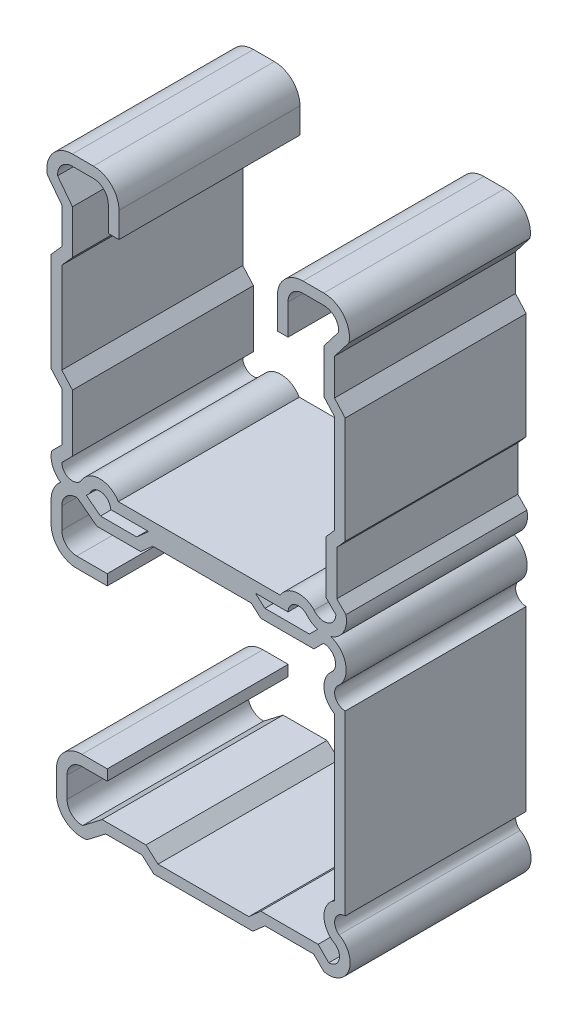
ISO-10303-21;
HEADER;
FILE_DESCRIPTION(('STEP AP214'),'2;1');
FILE_NAME('part.step','',(''),(''),'','','');
FILE_SCHEMA(('AUTOMOTIVE_DESIGN { 1 0 10303 214 1 1 1 1 }'));
ENDSEC;
DATA;
#1=APPLICATION_CONTEXT('core data for automotive mechanical design processes');
#2=APPLICATION_PROTOCOL_DEFINITION('international standard','automotive_design',2000,#1);
#3=PRODUCT_CONTEXT('',#1,'mechanical');
#4=PRODUCT('Part','Part','',(#3));
#5=PRODUCT_RELATED_PRODUCT_CATEGORY('part','',(#4));
#6=PRODUCT_DEFINITION_FORMATION('','',#4);
#7=PRODUCT_DEFINITION_CONTEXT('part definition',#1,'design');
#8=PRODUCT_DEFINITION('design','',#6,#7);
#9=PRODUCT_DEFINITION_SHAPE('','',#8);
#10=(LENGTH_UNIT() NAMED_UNIT(*) SI_UNIT(.MILLI.,.METRE.));
#11=(NAMED_UNIT(*) PLANE_ANGLE_UNIT() SI_UNIT($,.RADIAN.));
#12=(NAMED_UNIT(*) SI_UNIT($,.STERADIAN.) SOLID_ANGLE_UNIT());
#13=UNCERTAINTY_MEASURE_WITH_UNIT(LENGTH_MEASURE(1.E-05),#10,'distance_accuracy_value','');
#14=(GEOMETRIC_REPRESENTATION_CONTEXT(3) GLOBAL_UNCERTAINTY_ASSIGNED_CONTEXT((#13)) GLOBAL_UNIT_ASSIGNED_CONTEXT((#10,
#11,#12)) REPRESENTATION_CONTEXT('',''));
#15=CARTESIAN_POINT('',(0.,0.,0.));
#16=DIRECTION('',(0.,0.,1.));
#17=DIRECTION('',(1.,0.,0.));
#18=AXIS2_PLACEMENT_3D('',#15,#16,#17);
#19=CARTESIAN_POINT('',(-38.2778,2.30187499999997,12.7));
#20=DIRECTION('',(0.,0.,-1.));
#21=DIRECTION('',(-1.,0.,0.));
#22=AXIS2_PLACEMENT_3D('',#19,#20,#21);
#23=CYLINDRICAL_SURFACE('',#22,2.9972);
#24=DIRECTION('',(0.,0.,-1.));
#25=VECTOR('',#24,1.);
#26=CARTESIAN_POINT('',(-36.3310544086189,0.0229740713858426,12.7));
#27=LINE('',#26,#25);
#28=CARTESIAN_POINT('',(-36.3310544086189,0.0229740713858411,-12.7));
#29=VERTEX_POINT('',#28);
#30=CARTESIAN_POINT('',(-36.3310544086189,0.0229740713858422,12.7));
#31=VERTEX_POINT('',#30);
#32=EDGE_CURVE('E765',#29,#31,#27,.F.);
#33=ORIENTED_EDGE('',*,*,#32,.F.);
#34=CARTESIAN_POINT('',(-38.2778,2.30187499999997,-12.7));
#35=DIRECTION('',(0.,0.,1.));
#36=DIRECTION('',(1.,0.,0.));
#37=AXIS2_PLACEMENT_3D('',#34,#35,#36);
#38=CIRCLE('',#37,2.9972);
#39=CARTESIAN_POINT('',(-35.6573255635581,0.847116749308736,-12.7));
#40=VERTEX_POINT('',#39);
#41=EDGE_CURVE('E950',#29,#40,#38,.T.);
#42=ORIENTED_EDGE('',*,*,#41,.T.);
#43=DIRECTION('',(0.,0.,-1.));
#44=VECTOR('',#43,1.);
#45=CARTESIAN_POINT('',(-35.6573255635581,0.847116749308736,12.7));
#46=LINE('',#45,#44);
#47=CARTESIAN_POINT('',(-35.6573255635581,0.847116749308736,12.7));
#48=VERTEX_POINT('',#47);
#49=EDGE_CURVE('E1093',#48,#40,#46,.T.);
#50=ORIENTED_EDGE('',*,*,#49,.F.);
#51=CARTESIAN_POINT('',(-38.2778,2.30187499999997,12.7));
#52=DIRECTION('',(0.,0.,1.));
#53=DIRECTION('',(1.,0.,0.));
#54=AXIS2_PLACEMENT_3D('',#51,#52,#53);
#55=CIRCLE('',#54,2.9972);
#56=EDGE_CURVE('E833',#31,#48,#55,.T.);
#57=ORIENTED_EDGE('',*,*,#56,.F.);
#58=EDGE_LOOP('',(#33,#42,#50,#57));
#59=FACE_BOUND('',#58,.T.);
#60=ADVANCED_FACE('F32',(#59),#23,.T.);
#61=DIRECTION('',(0.,0.,-1.));
#62=VECTOR('',#61,1.);
#63=CARTESIAN_POINT('',(-39.9323411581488,-0.197265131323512,0.));
#64=LINE('',#63,#62);
#65=CARTESIAN_POINT('',(-39.9323411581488,-0.197265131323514,12.7));
#66=VERTEX_POINT('',#65);
#67=CARTESIAN_POINT('',(-39.9323411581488,-0.197265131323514,-12.7));
#68=VERTEX_POINT('',#67);
#69=EDGE_CURVE('E762',#66,#68,#64,.T.);
#70=ORIENTED_EDGE('',*,*,#69,.F.);
#71=CARTESIAN_POINT('',(-41.1909580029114,3.00665744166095,12.7));
#72=VERTEX_POINT('',#71);
#73=EDGE_CURVE('E834',#72,#66,#55,.T.);
#74=ORIENTED_EDGE('',*,*,#73,.F.);
#75=DIRECTION('',(0.,0.,-1.));
#76=VECTOR('',#75,1.);
#77=CARTESIAN_POINT('',(-41.1909580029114,3.00665744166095,12.7));
#78=LINE('',#77,#76);
#79=CARTESIAN_POINT('',(-41.1909580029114,3.00665744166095,-12.7));
#80=VERTEX_POINT('',#79);
#81=EDGE_CURVE('E1096',#72,#80,#78,.T.);
#82=ORIENTED_EDGE('',*,*,#81,.T.);
#83=EDGE_CURVE('E951',#80,#68,#38,.T.);
#84=ORIENTED_EDGE('',*,*,#83,.T.);
#85=EDGE_LOOP('',(#70,#74,#82,#84));
#86=FACE_BOUND('',#85,.T.);
#87=ADVANCED_FACE('F1847',(#86),#23,.T.);
#88=CARTESIAN_POINT('',(-32.932783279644,0.,12.7));
#89=DIRECTION('',(0.,1.,0.));
#90=DIRECTION('',(-1.,0.,0.));
#91=AXIS2_PLACEMENT_3D('',#88,#89,#90);
#92=PLANE('',#91);
#93=DIRECTION('',(0.,0.,-1.));
#94=VECTOR('',#93,1.);
#95=CARTESIAN_POINT('',(-12.5990373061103,0.,12.7));
#96=LINE('',#95,#94);
#97=CARTESIAN_POINT('',(-12.5990373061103,0.,12.7));
#98=VERTEX_POINT('',#97);
#99=CARTESIAN_POINT('',(-12.5990373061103,0.,-12.7));
#100=VERTEX_POINT('',#99);
#101=EDGE_CURVE('E1442',#98,#100,#96,.T.);
#102=ORIENTED_EDGE('',*,*,#101,.T.);
#103=DIRECTION('',(1.,0.,0.));
#104=VECTOR('',#103,1.);
#105=CARTESIAN_POINT('',(-32.932783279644,0.,-12.7));
#106=LINE('',#105,#104);
#107=CARTESIAN_POINT('',(-8.02471672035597,0.,-12.7));
#108=VERTEX_POINT('',#107);
#109=EDGE_CURVE('E955',#100,#108,#106,.T.);
#110=ORIENTED_EDGE('',*,*,#109,.T.);
#111=DIRECTION('',(0.,0.,-1.));
#112=VECTOR('',#111,1.);
#113=CARTESIAN_POINT('',(-8.02471672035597,0.,12.7));
#114=LINE('',#113,#112);
#115=CARTESIAN_POINT('',(-8.02471672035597,0.,12.7));
#116=VERTEX_POINT('',#115);
#117=EDGE_CURVE('E1087',#116,#108,#114,.T.);
#118=ORIENTED_EDGE('',*,*,#117,.F.);
#119=DIRECTION('',(1.,0.,0.));
#120=VECTOR('',#119,1.);
#121=CARTESIAN_POINT('',(-32.932783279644,0.,12.7));
#122=LINE('',#121,#120);
#123=EDGE_CURVE('E839',#98,#116,#122,.T.);
#124=ORIENTED_EDGE('',*,*,#123,.F.);
#125=EDGE_LOOP('',(#102,#110,#118,#124));
#126=FACE_BOUND('',#125,.T.);
#127=ADVANCED_FACE('F1853',(#126),#92,.F.);
#128=DIRECTION('',(0.,0.,-1.));
#129=VECTOR('',#128,1.);
#130=CARTESIAN_POINT('',(-27.5828125,0.,12.7));
#131=LINE('',#130,#129);
#132=CARTESIAN_POINT('',(-27.5828124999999,0.,12.7));
#133=VERTEX_POINT('',#132);
#134=CARTESIAN_POINT('',(-27.5828124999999,0.,-12.7));
#135=VERTEX_POINT('',#134);
#136=EDGE_CURVE('E1439',#133,#135,#131,.T.);
#137=ORIENTED_EDGE('',*,*,#136,.F.);
#138=CARTESIAN_POINT('',(-32.932783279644,0.,12.7));
#139=VERTEX_POINT('',#138);
#140=EDGE_CURVE('E840',#139,#133,#122,.T.);
#141=ORIENTED_EDGE('',*,*,#140,.F.);
#142=DIRECTION('',(0.,0.,-1.));
#143=VECTOR('',#142,1.);
#144=CARTESIAN_POINT('',(-32.932783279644,0.,12.7));
#145=LINE('',#144,#143);
#146=CARTESIAN_POINT('',(-32.932783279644,0.,-12.7));
#147=VERTEX_POINT('',#146);
#148=EDGE_CURVE('E1090',#139,#147,#145,.T.);
#149=ORIENTED_EDGE('',*,*,#148,.T.);
#150=EDGE_CURVE('E956',#147,#135,#106,.T.);
#151=ORIENTED_EDGE('',*,*,#150,.T.);
#152=EDGE_LOOP('',(#137,#141,#149,#151));
#153=FACE_BOUND('',#152,.T.);
#154=ADVANCED_FACE('F1965',(#153),#92,.F.);
#155=CARTESIAN_POINT('',(-2.99720000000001,3.038475,12.7));
#156=DIRECTION('',(0.,0.,-1.));
#157=DIRECTION('',(-1.,0.,0.));
#158=AXIS2_PLACEMENT_3D('',#155,#156,#157);
#159=CYLINDRICAL_SURFACE('',#158,3.17895300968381);
#160=DIRECTION('',(0.,0.,-1.));
#161=VECTOR('',#160,1.);
#162=CARTESIAN_POINT('',(-2.01887479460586,0.0138060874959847,0.));
#163=LINE('',#162,#161);
#164=CARTESIAN_POINT('',(-2.01887479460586,0.0138060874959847,-12.7));
#165=VERTEX_POINT('',#164);
#166=CARTESIAN_POINT('',(-2.01887479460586,0.0138060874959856,12.7));
#167=VERTEX_POINT('',#166);
#168=EDGE_CURVE('E774',#165,#167,#163,.F.);
#169=ORIENTED_EDGE('',*,*,#168,.F.);
#170=CARTESIAN_POINT('',(-2.99720000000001,3.038475,-12.7));
#171=DIRECTION('',(0.,0.,1.));
#172=DIRECTION('',(-1.,0.,0.));
#173=AXIS2_PLACEMENT_3D('',#170,#171,#172);
#174=CIRCLE('',#173,3.17895300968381);
#175=CARTESIAN_POINT('',(0.104084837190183,3.73688361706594,-12.7));
#176=VERTEX_POINT('',#175);
#177=EDGE_CURVE('E960',#165,#176,#174,.T.);
#178=ORIENTED_EDGE('',*,*,#177,.T.);
#179=DIRECTION('',(0.,0.,-1.));
#180=VECTOR('',#179,1.);
#181=CARTESIAN_POINT('',(0.104084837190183,3.73688361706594,12.7));
#182=LINE('',#181,#180);
#183=CARTESIAN_POINT('',(0.104084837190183,3.73688361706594,12.7));
#184=VERTEX_POINT('',#183);
#185=EDGE_CURVE('E1081',#184,#176,#182,.T.);
#186=ORIENTED_EDGE('',*,*,#185,.F.);
#187=CARTESIAN_POINT('',(-2.99720000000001,3.038475,12.7));
#188=DIRECTION('',(0.,0.,1.));
#189=DIRECTION('',(-1.,0.,0.));
#190=AXIS2_PLACEMENT_3D('',#187,#188,#189);
#191=CIRCLE('',#190,3.17895300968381);
#192=EDGE_CURVE('E47',#167,#184,#191,.T.);
#193=ORIENTED_EDGE('',*,*,#192,.F.);
#194=EDGE_LOOP('',(#169,#178,#186,#193));
#195=FACE_BOUND('',#194,.T.);
#196=ADVANCED_FACE('F1323',(#195),#159,.T.);
#197=DIRECTION('',(0.,0.,-1.));
#198=VECTOR('',#197,1.);
#199=CARTESIAN_POINT('',(-3.86165378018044,-0.0206853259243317,12.7));
#200=LINE('',#199,#198);
#201=CARTESIAN_POINT('',(-3.86165378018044,-0.0206853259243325,12.7));
#202=VERTEX_POINT('',#201);
#203=CARTESIAN_POINT('',(-3.86165378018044,-0.0206853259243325,-12.7));
#204=VERTEX_POINT('',#203);
#205=EDGE_CURVE('E55',#202,#204,#200,.T.);
#206=ORIENTED_EDGE('',*,*,#205,.F.);
#207=CARTESIAN_POINT('',(-5.30017443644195,0.847116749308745,12.7));
#208=VERTEX_POINT('',#207);
#209=EDGE_CURVE('E845',#208,#202,#191,.T.);
#210=ORIENTED_EDGE('',*,*,#209,.F.);
#211=DIRECTION('',(0.,0.,-1.));
#212=VECTOR('',#211,1.);
#213=CARTESIAN_POINT('',(-5.30017443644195,0.847116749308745,12.7));
#214=LINE('',#213,#212);
#215=CARTESIAN_POINT('',(-5.30017443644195,0.847116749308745,-12.7));
#216=VERTEX_POINT('',#215);
#217=EDGE_CURVE('E1084',#208,#216,#214,.T.);
#218=ORIENTED_EDGE('',*,*,#217,.T.);
#219=EDGE_CURVE('E961',#216,#204,#174,.T.);
#220=ORIENTED_EDGE('',*,*,#219,.T.);
#221=EDGE_LOOP('',(#206,#210,#218,#220));
#222=FACE_BOUND('',#221,.T.);
#223=ADVANCED_FACE('F1957',(#222),#159,.T.);
#224=CARTESIAN_POINT('',(-6.52618860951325,-0.0146785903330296,12.7));
#225=DIRECTION('',(0.,0.,-1.));
#226=DIRECTION('',(-1.,0.,0.));
#227=AXIS2_PLACEMENT_3D('',#224,#225,#226);
#228=CYLINDRICAL_SURFACE('',#227,2.9972);
#229=CARTESIAN_POINT('',(-6.52618860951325,-0.0146785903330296,-12.7));
#230=DIRECTION('',(0.,0.,1.));
#231=DIRECTION('',(1.,0.,0.));
#232=AXIS2_PLACEMENT_3D('',#229,#230,#231);
#233=CIRCLE('',#232,2.9972);
#234=CARTESIAN_POINT('',(-4.36378237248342,2.0607026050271,-12.7));
#235=VERTEX_POINT('',#234);
#236=CARTESIAN_POINT('',(-9.11330974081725,1.4986,-12.7));
#237=VERTEX_POINT('',#236);
#238=EDGE_CURVE('E776',#235,#237,#233,.T.);
#239=ORIENTED_EDGE('',*,*,#238,.T.);
#240=DIRECTION('',(0.,0.,-1.));
#241=VECTOR('',#240,1.);
#242=CARTESIAN_POINT('',(-9.11330974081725,1.4986,12.7));
#243=LINE('',#242,#241);
#244=CARTESIAN_POINT('',(-9.11330974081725,1.4986,12.7));
#245=VERTEX_POINT('',#244);
#246=EDGE_CURVE('E11',#245,#237,#243,.T.);
#247=ORIENTED_EDGE('',*,*,#246,.F.);
#248=CARTESIAN_POINT('',(-6.52618860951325,-0.0146785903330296,12.7));
#249=DIRECTION('',(0.,0.,1.));
#250=DIRECTION('',(1.,0.,0.));
#251=AXIS2_PLACEMENT_3D('',#248,#249,#250);
#252=CIRCLE('',#251,2.9972);
#253=CARTESIAN_POINT('',(-4.36378237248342,2.0607026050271,12.7));
#254=VERTEX_POINT('',#253);
#255=EDGE_CURVE('E777',#254,#245,#252,.T.);
#256=ORIENTED_EDGE('',*,*,#255,.F.);
#257=DIRECTION('',(0.,0.,-1.));
#258=VECTOR('',#257,1.);
#259=CARTESIAN_POINT('',(-4.36378237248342,2.0607026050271,12.7));
#260=LINE('',#259,#258);
#261=EDGE_CURVE('E895',#254,#235,#260,.T.);
#262=ORIENTED_EDGE('',*,*,#261,.T.);
#263=EDGE_LOOP('',(#239,#247,#256,#262));
#264=FACE_BOUND('',#263,.T.);
#265=ADVANCED_FACE('F34',(#264),#228,.T.);
#266=CARTESIAN_POINT('',(-31.8441902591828,1.4986,12.7));
#267=DIRECTION('',(0.,-1.,0.));
#268=DIRECTION('',(0.,0.,-1.));
#269=AXIS2_PLACEMENT_3D('',#266,#267,#268);
#270=PLANE('',#269);
#271=DIRECTION('',(-1.,0.,0.));
#272=VECTOR('',#271,1.);
#273=CARTESIAN_POINT('',(-31.8441902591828,1.4986,-12.7));
#274=LINE('',#273,#272);
#275=CARTESIAN_POINT('',(-31.8441902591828,1.4986,-12.7));
#276=VERTEX_POINT('',#275);
#277=EDGE_CURVE('E898',#237,#276,#274,.T.);
#278=ORIENTED_EDGE('',*,*,#277,.T.);
#279=DIRECTION('',(0.,0.,-1.));
#280=VECTOR('',#279,1.);
#281=CARTESIAN_POINT('',(-31.8441902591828,1.4986,12.7));
#282=LINE('',#281,#280);
#283=CARTESIAN_POINT('',(-31.8441902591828,1.4986,12.7));
#284=VERTEX_POINT('',#283);
#285=EDGE_CURVE('E40',#284,#276,#282,.T.);
#286=ORIENTED_EDGE('',*,*,#285,.F.);
#287=DIRECTION('',(-1.,0.,0.));
#288=VECTOR('',#287,1.);
#289=CARTESIAN_POINT('',(-31.8441902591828,1.4986,12.7));
#290=LINE('',#289,#288);
#291=EDGE_CURVE('E780',#245,#284,#290,.T.);
#292=ORIENTED_EDGE('',*,*,#291,.F.);
#293=ORIENTED_EDGE('',*,*,#246,.T.);
#294=EDGE_LOOP('',(#278,#286,#292,#293));
#295=FACE_BOUND('',#294,.T.);
#296=ADVANCED_FACE('F1197',(#295),#270,.F.);
#297=CARTESIAN_POINT('',(-34.4313113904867,-0.0146785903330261,12.7));
#298=DIRECTION('',(0.,0.,-1.));
#299=DIRECTION('',(-1.,0.,0.));
#300=AXIS2_PLACEMENT_3D('',#297,#298,#299);
#301=CYLINDRICAL_SURFACE('',#300,2.9972);
#302=CARTESIAN_POINT('',(-34.4313113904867,-0.0146785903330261,-12.7));
#303=DIRECTION('',(0.,0.,1.));
#304=DIRECTION('',(-1.,0.,0.));
#305=AXIS2_PLACEMENT_3D('',#302,#303,#304);
#306=CIRCLE('',#305,2.9972);
#307=CARTESIAN_POINT('',(-37.0517858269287,1.4400796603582,-12.7));
#308=VERTEX_POINT('',#307);
#309=EDGE_CURVE('E900',#276,#308,#306,.T.);
#310=ORIENTED_EDGE('',*,*,#309,.T.);
#311=DIRECTION('',(0.,0.,-1.));
#312=VECTOR('',#311,1.);
#313=CARTESIAN_POINT('',(-37.0517858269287,1.4400796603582,12.7));
#314=LINE('',#313,#312);
#315=CARTESIAN_POINT('',(-37.0517858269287,1.4400796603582,12.7));
#316=VERTEX_POINT('',#315);
#317=EDGE_CURVE('E1168',#316,#308,#314,.T.);
#318=ORIENTED_EDGE('',*,*,#317,.F.);
#319=CARTESIAN_POINT('',(-34.4313113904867,-0.0146785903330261,12.7));
#320=DIRECTION('',(0.,0.,1.));
#321=DIRECTION('',(-1.,0.,0.));
#322=AXIS2_PLACEMENT_3D('',#319,#320,#321);
#323=CIRCLE('',#322,2.9972);
#324=EDGE_CURVE('E783',#284,#316,#323,.T.);
#325=ORIENTED_EDGE('',*,*,#324,.F.);
#326=ORIENTED_EDGE('',*,*,#285,.T.);
#327=EDGE_LOOP('',(#310,#318,#325,#326));
#328=FACE_BOUND('',#327,.T.);
#329=ADVANCED_FACE('F1175',(#328),#301,.T.);
#330=CARTESIAN_POINT('',(-38.2778,2.30187499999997,12.7));
#331=DIRECTION('',(0.,0.,-1.));
#332=DIRECTION('',(-1.,0.,0.));
#333=AXIS2_PLACEMENT_3D('',#330,#331,#332);
#334=CYLINDRICAL_SURFACE('',#333,1.4986);
#335=CARTESIAN_POINT('',(-38.2778,2.30187499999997,-12.7));
#336=DIRECTION('',(0.,0.,-1.));
#337=DIRECTION('',(1.,0.,0.));
#338=AXIS2_PLACEMENT_3D('',#335,#336,#337);
#339=CIRCLE('',#338,1.4986);
#340=CARTESIAN_POINT('',(-39.7764,2.30187499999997,-12.7));
#341=VERTEX_POINT('',#340);
#342=EDGE_CURVE('E902',#308,#341,#339,.T.);
#343=ORIENTED_EDGE('',*,*,#342,.T.);
#344=DIRECTION('',(0.,0.,-1.));
#345=VECTOR('',#344,1.);
#346=CARTESIAN_POINT('',(-39.7764,2.30187499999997,12.7));
#347=LINE('',#346,#345);
#348=CARTESIAN_POINT('',(-39.7764,2.30187499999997,12.7));
#349=VERTEX_POINT('',#348);
#350=EDGE_CURVE('E1165',#349,#341,#347,.T.);
#351=ORIENTED_EDGE('',*,*,#350,.F.);
#352=CARTESIAN_POINT('',(-38.2778,2.30187499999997,12.7));
#353=DIRECTION('',(0.,0.,-1.));
#354=DIRECTION('',(1.,0.,0.));
#355=AXIS2_PLACEMENT_3D('',#352,#353,#354);
#356=CIRCLE('',#355,1.4986);
#357=EDGE_CURVE('E785',#316,#349,#356,.T.);
#358=ORIENTED_EDGE('',*,*,#357,.F.);
#359=ORIENTED_EDGE('',*,*,#317,.T.);
#360=EDGE_LOOP('',(#343,#351,#358,#359));
#361=FACE_BOUND('',#360,.T.);
#362=ADVANCED_FACE('F1187',(#361),#334,.F.);
#363=CARTESIAN_POINT('',(-38.2778,3.80047499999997,12.7));
#364=DIRECTION('',(-0.707106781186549,0.707106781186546,0.));
#365=DIRECTION('',(-0.707106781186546,-0.707106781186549,0.));
#366=AXIS2_PLACEMENT_3D('',#363,#364,#365);
#367=PLANE('',#366);
#368=DIRECTION('',(0.707106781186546,0.707106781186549,0.));
#369=VECTOR('',#368,1.);
#370=CARTESIAN_POINT('',(-38.2778,3.80047499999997,-12.7));
#371=LINE('',#370,#369);
#372=CARTESIAN_POINT('',(-38.2778,3.80047499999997,-12.7));
#373=VERTEX_POINT('',#372);
#374=EDGE_CURVE('E904',#341,#373,#371,.T.);
#375=ORIENTED_EDGE('',*,*,#374,.T.);
#376=DIRECTION('',(0.,0.,-1.));
#377=VECTOR('',#376,1.);
#378=CARTESIAN_POINT('',(-38.2778,3.80047499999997,12.7));
#379=LINE('',#378,#377);
#380=CARTESIAN_POINT('',(-38.2778,3.80047499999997,12.7));
#381=VERTEX_POINT('',#380);
#382=EDGE_CURVE('E1162',#381,#373,#379,.T.);
#383=ORIENTED_EDGE('',*,*,#382,.F.);
#384=DIRECTION('',(0.707106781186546,0.707106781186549,0.));
#385=VECTOR('',#384,1.);
#386=CARTESIAN_POINT('',(-38.2778,3.80047499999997,12.7));
#387=LINE('',#386,#385);
#388=EDGE_CURVE('E787',#349,#381,#387,.T.);
#389=ORIENTED_EDGE('',*,*,#388,.F.);
#390=ORIENTED_EDGE('',*,*,#350,.T.);
#391=EDGE_LOOP('',(#375,#383,#389,#390));
#392=FACE_BOUND('',#391,.T.);
#393=ADVANCED_FACE('F1191',(#392),#367,.F.);
#394=CARTESIAN_POINT('',(-38.2778,3.80047499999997,12.7));
#395=DIRECTION('',(-1.,0.,0.));
#396=DIRECTION('',(0.,0.,1.));
#397=AXIS2_PLACEMENT_3D('',#394,#395,#396);
#398=PLANE('',#397);
#399=DIRECTION('',(0.,1.,0.));
#400=VECTOR('',#399,1.);
#401=CARTESIAN_POINT('',(-38.2778,3.80047499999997,-12.7));
#402=LINE('',#401,#400);
#403=CARTESIAN_POINT('',(-38.2778,11.8431979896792,-12.7));
#404=VERTEX_POINT('',#403);
#405=EDGE_CURVE('E906',#373,#404,#402,.T.);
#406=ORIENTED_EDGE('',*,*,#405,.T.);
#407=DIRECTION('',(0.,0.,-1.));
#408=VECTOR('',#407,1.);
#409=CARTESIAN_POINT('',(-38.2778,11.8431979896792,12.7));
#410=LINE('',#409,#408);
#411=CARTESIAN_POINT('',(-38.2778,11.8431979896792,12.7));
#412=VERTEX_POINT('',#411);
#413=EDGE_CURVE('E1159',#412,#404,#410,.T.);
#414=ORIENTED_EDGE('',*,*,#413,.F.);
#415=DIRECTION('',(0.,1.,0.));
#416=VECTOR('',#415,1.);
#417=CARTESIAN_POINT('',(-38.2778,3.80047499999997,12.7));
#418=LINE('',#417,#416);
#419=EDGE_CURVE('E789',#381,#412,#418,.T.);
#420=ORIENTED_EDGE('',*,*,#419,.F.);
#421=ORIENTED_EDGE('',*,*,#382,.T.);
#422=EDGE_LOOP('',(#406,#414,#420,#421));
#423=FACE_BOUND('',#422,.T.);
#424=ADVANCED_FACE('F1943',(#423),#398,.F.);
#425=CARTESIAN_POINT('',(-38.2778,11.8431979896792,12.7));
#426=DIRECTION('',(-0.746819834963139,-0.665026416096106,0.));
#427=DIRECTION('',(0.665026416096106,-0.746819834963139,0.));
#428=AXIS2_PLACEMENT_3D('',#425,#426,#427);
#429=PLANE('',#428);
#430=DIRECTION('',(-0.665026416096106,0.746819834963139,0.));
#431=VECTOR('',#430,1.);
#432=CARTESIAN_POINT('',(-38.2778,11.8431979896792,-12.7));
#433=LINE('',#432,#431);
#434=CARTESIAN_POINT('',(-39.7764,13.5261149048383,-12.7));
#435=VERTEX_POINT('',#434);
#436=EDGE_CURVE('E908',#404,#435,#433,.T.);
#437=ORIENTED_EDGE('',*,*,#436,.T.);
#438=DIRECTION('',(0.,0.,-1.));
#439=VECTOR('',#438,1.);
#440=CARTESIAN_POINT('',(-39.7764,13.5261149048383,12.7));
#441=LINE('',#440,#439);
#442=CARTESIAN_POINT('',(-39.7764,13.5261149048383,12.7));
#443=VERTEX_POINT('',#442);
#444=EDGE_CURVE('E1156',#443,#435,#441,.T.);
#445=ORIENTED_EDGE('',*,*,#444,.F.);
#446=DIRECTION('',(-0.665026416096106,0.746819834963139,0.));
#447=VECTOR('',#446,1.);
#448=CARTESIAN_POINT('',(-38.2778,11.8431979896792,12.7));
#449=LINE('',#448,#447);
#450=EDGE_CURVE('E791',#412,#443,#449,.T.);
#451=ORIENTED_EDGE('',*,*,#450,.F.);
#452=ORIENTED_EDGE('',*,*,#413,.T.);
#453=EDGE_LOOP('',(#437,#445,#451,#452));
#454=FACE_BOUND('',#453,.T.);
#455=ADVANCED_FACE('F1939',(#454),#429,.F.);
#456=CARTESIAN_POINT('',(-39.7764,13.5261149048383,12.7));
#457=DIRECTION('',(-1.,0.,0.));
#458=DIRECTION('',(0.,0.,1.));
#459=AXIS2_PLACEMENT_3D('',#456,#457,#458);
#460=PLANE('',#459);
#461=DIRECTION('',(0.,1.,0.));
#462=VECTOR('',#461,1.);
#463=CARTESIAN_POINT('',(-39.7764,13.5261149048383,-12.7));
#464=LINE('',#463,#462);
#465=CARTESIAN_POINT('',(-39.7764,26.2756850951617,-12.7));
#466=VERTEX_POINT('',#465);
#467=EDGE_CURVE('E910',#435,#466,#464,.T.);
#468=ORIENTED_EDGE('',*,*,#467,.T.);
#469=DIRECTION('',(0.,0.,-1.));
#470=VECTOR('',#469,1.);
#471=CARTESIAN_POINT('',(-39.7764,26.2756850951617,12.7));
#472=LINE('',#471,#470);
#473=CARTESIAN_POINT('',(-39.7764,26.2756850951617,12.7));
#474=VERTEX_POINT('',#473);
#475=EDGE_CURVE('E1153',#474,#466,#472,.T.);
#476=ORIENTED_EDGE('',*,*,#475,.F.);
#477=DIRECTION('',(0.,1.,0.));
#478=VECTOR('',#477,1.);
#479=CARTESIAN_POINT('',(-39.7764,13.5261149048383,12.7));
#480=LINE('',#479,#478);
#481=EDGE_CURVE('E793',#443,#474,#480,.T.);
#482=ORIENTED_EDGE('',*,*,#481,.F.);
#483=ORIENTED_EDGE('',*,*,#444,.T.);
#484=EDGE_LOOP('',(#468,#476,#482,#483));
#485=FACE_BOUND('',#484,.T.);
#486=ADVANCED_FACE('F1935',(#485),#460,.F.);
#487=CARTESIAN_POINT('',(-38.2778,27.9586020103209,12.7));
#488=DIRECTION('',(-0.746819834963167,0.665026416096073,0.));
#489=DIRECTION('',(-0.665026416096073,-0.746819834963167,0.));
#490=AXIS2_PLACEMENT_3D('',#487,#488,#489);
#491=PLANE('',#490);
#492=DIRECTION('',(0.665026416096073,0.746819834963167,0.));
#493=VECTOR('',#492,1.);
#494=CARTESIAN_POINT('',(-38.2778,27.9586020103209,-12.7));
#495=LINE('',#494,#493);
#496=CARTESIAN_POINT('',(-38.2778,27.9586020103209,-12.7));
#497=VERTEX_POINT('',#496);
#498=EDGE_CURVE('E912',#466,#497,#495,.T.);
#499=ORIENTED_EDGE('',*,*,#498,.T.);
#500=DIRECTION('',(0.,0.,-1.));
#501=VECTOR('',#500,1.);
#502=CARTESIAN_POINT('',(-38.2778,27.9586020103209,12.7));
#503=LINE('',#502,#501);
#504=CARTESIAN_POINT('',(-38.2778,27.9586020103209,12.7));
#505=VERTEX_POINT('',#504);
#506=EDGE_CURVE('E1150',#505,#497,#503,.T.);
#507=ORIENTED_EDGE('',*,*,#506,.F.);
#508=DIRECTION('',(0.665026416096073,0.746819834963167,0.));
#509=VECTOR('',#508,1.);
#510=CARTESIAN_POINT('',(-38.2778,27.9586020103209,12.7));
#511=LINE('',#510,#509);
#512=EDGE_CURVE('E795',#474,#505,#511,.T.);
#513=ORIENTED_EDGE('',*,*,#512,.F.);
#514=ORIENTED_EDGE('',*,*,#475,.T.);
#515=EDGE_LOOP('',(#499,#507,#513,#514));
#516=FACE_BOUND('',#515,.T.);
#517=ADVANCED_FACE('F1931',(#516),#491,.F.);
#518=CARTESIAN_POINT('',(-38.2778,27.9586020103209,12.7));
#519=DIRECTION('',(-1.,0.,0.));
#520=DIRECTION('',(0.,0.,1.));
#521=AXIS2_PLACEMENT_3D('',#518,#519,#520);
#522=PLANE('',#521);
#523=DIRECTION('',(0.,1.,0.));
#524=VECTOR('',#523,1.);
#525=CARTESIAN_POINT('',(-38.2778,27.9586020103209,-12.7));
#526=LINE('',#525,#524);
#527=CARTESIAN_POINT('',(-38.2778,34.1192865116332,-12.7));
#528=VERTEX_POINT('',#527);
#529=EDGE_CURVE('E914',#497,#528,#526,.T.);
#530=ORIENTED_EDGE('',*,*,#529,.T.);
#531=DIRECTION('',(0.,0.,-1.));
#532=VECTOR('',#531,1.);
#533=CARTESIAN_POINT('',(-38.2778,34.1192865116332,12.7));
#534=LINE('',#533,#532);
#535=CARTESIAN_POINT('',(-38.2778,34.1192865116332,12.7));
#536=VERTEX_POINT('',#535);
#537=EDGE_CURVE('E1147',#536,#528,#534,.T.);
#538=ORIENTED_EDGE('',*,*,#537,.F.);
#539=DIRECTION('',(0.,1.,0.));
#540=VECTOR('',#539,1.);
#541=CARTESIAN_POINT('',(-38.2778,27.9586020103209,12.7));
#542=LINE('',#541,#540);
#543=EDGE_CURVE('E797',#505,#536,#542,.T.);
#544=ORIENTED_EDGE('',*,*,#543,.F.);
#545=ORIENTED_EDGE('',*,*,#506,.T.);
#546=EDGE_LOOP('',(#530,#538,#544,#545));
#547=FACE_BOUND('',#546,.T.);
#548=ADVANCED_FACE('F1927',(#547),#522,.F.);
#549=CARTESIAN_POINT('',(-38.2778,34.1192865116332,12.7));
#550=DIRECTION('',(-0.793466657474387,-0.608613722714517,0.));
#551=DIRECTION('',(0.608613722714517,-0.793466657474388,0.));
#552=AXIS2_PLACEMENT_3D('',#549,#550,#551);
#553=PLANE('',#552);
#554=DIRECTION('',(-0.608613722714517,0.793466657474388,0.));
#555=VECTOR('',#554,1.);
#556=CARTESIAN_POINT('',(-38.2778,34.1192865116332,-12.7));
#557=LINE('',#556,#555);
#558=CARTESIAN_POINT('',(-40.3673825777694,36.8435335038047,-12.7));
#559=VERTEX_POINT('',#558);
#560=EDGE_CURVE('E916',#528,#559,#557,.T.);
#561=ORIENTED_EDGE('',*,*,#560,.T.);
#562=DIRECTION('',(0.,0.,-1.));
#563=VECTOR('',#562,1.);
#564=CARTESIAN_POINT('',(-40.3673825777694,36.8435335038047,12.7));
#565=LINE('',#564,#563);
#566=CARTESIAN_POINT('',(-40.3673825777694,36.8435335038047,12.7));
#567=VERTEX_POINT('',#566);
#568=EDGE_CURVE('E1144',#567,#559,#565,.T.);
#569=ORIENTED_EDGE('',*,*,#568,.F.);
#570=DIRECTION('',(-0.608613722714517,0.793466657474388,0.));
#571=VECTOR('',#570,1.);
#572=CARTESIAN_POINT('',(-38.2778,34.1192865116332,12.7));
#573=LINE('',#572,#571);
#574=EDGE_CURVE('E799',#536,#567,#573,.T.);
#575=ORIENTED_EDGE('',*,*,#574,.F.);
#576=ORIENTED_EDGE('',*,*,#537,.T.);
#577=EDGE_LOOP('',(#561,#569,#575,#576));
#578=FACE_BOUND('',#577,.T.);
#579=ADVANCED_FACE('F1923',(#578),#553,.F.);
#580=CARTESIAN_POINT('',(-38.2778,36.9476263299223,12.7));
#581=DIRECTION('',(0.,0.,-1.));
#582=DIRECTION('',(-1.,0.,0.));
#583=AXIS2_PLACEMENT_3D('',#580,#581,#582);
#584=CYLINDRICAL_SURFACE('',#583,2.09217367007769);
#585=CARTESIAN_POINT('',(-38.2778,36.9476263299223,-12.7));
#586=DIRECTION('',(0.,0.,-1.));
#587=DIRECTION('',(1.,0.,0.));
#588=AXIS2_PLACEMENT_3D('',#585,#586,#587);
#589=CIRCLE('',#588,2.09217367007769);
#590=CARTESIAN_POINT('',(-38.2778,39.0398,-12.7));
#591=VERTEX_POINT('',#590);
#592=EDGE_CURVE('E918',#559,#591,#589,.T.);
#593=ORIENTED_EDGE('',*,*,#592,.T.);
#594=DIRECTION('',(0.,0.,-1.));
#595=VECTOR('',#594,1.);
#596=CARTESIAN_POINT('',(-38.2778,39.0398,12.7));
#597=LINE('',#596,#595);
#598=CARTESIAN_POINT('',(-38.2778,39.0398,12.7));
#599=VERTEX_POINT('',#598);
#600=EDGE_CURVE('E1141',#599,#591,#597,.T.);
#601=ORIENTED_EDGE('',*,*,#600,.F.);
#602=CARTESIAN_POINT('',(-38.2778,36.9476263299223,12.7));
#603=DIRECTION('',(0.,0.,-1.));
#604=DIRECTION('',(1.,0.,0.));
#605=AXIS2_PLACEMENT_3D('',#602,#603,#604);
#606=CIRCLE('',#605,2.09217367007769);
#607=EDGE_CURVE('E801',#567,#599,#606,.T.);
#608=ORIENTED_EDGE('',*,*,#607,.F.);
#609=ORIENTED_EDGE('',*,*,#568,.T.);
#610=EDGE_LOOP('',(#593,#601,#608,#609));
#611=FACE_BOUND('',#610,.T.);
#612=ADVANCED_FACE('F1919',(#611),#584,.F.);
#613=CARTESIAN_POINT('',(-38.2778,39.0398,12.7));
#614=DIRECTION('',(0.,1.,0.));
#615=DIRECTION('',(0.,0.,1.));
#616=AXIS2_PLACEMENT_3D('',#613,#614,#615);
#617=PLANE('',#616);
#618=DIRECTION('',(1.,0.,0.));
#619=VECTOR('',#618,1.);
#620=CARTESIAN_POINT('',(-38.2778,39.0398,-12.7));
#621=LINE('',#620,#619);
#622=CARTESIAN_POINT('',(-35.3407736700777,39.0398,-12.7));
#623=VERTEX_POINT('',#622);
#624=EDGE_CURVE('E920',#591,#623,#621,.T.);
#625=ORIENTED_EDGE('',*,*,#624,.T.);
#626=DIRECTION('',(0.,0.,-1.));
#627=VECTOR('',#626,1.);
#628=CARTESIAN_POINT('',(-35.3407736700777,39.0398,12.7));
#629=LINE('',#628,#627);
#630=CARTESIAN_POINT('',(-35.3407736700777,39.0398,12.7));
#631=VERTEX_POINT('',#630);
#632=EDGE_CURVE('E1138',#631,#623,#629,.T.);
#633=ORIENTED_EDGE('',*,*,#632,.F.);
#634=DIRECTION('',(1.,0.,0.));
#635=VECTOR('',#634,1.);
#636=CARTESIAN_POINT('',(-38.2778,39.0398,12.7));
#637=LINE('',#636,#635);
#638=EDGE_CURVE('E803',#599,#631,#637,.T.);
#639=ORIENTED_EDGE('',*,*,#638,.F.);
#640=ORIENTED_EDGE('',*,*,#600,.T.);
#641=EDGE_LOOP('',(#625,#633,#639,#640));
#642=FACE_BOUND('',#641,.T.);
#643=ADVANCED_FACE('F1915',(#642),#617,.F.);
#644=CARTESIAN_POINT('',(-35.3407736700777,36.9476263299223,12.7));
#645=DIRECTION('',(0.,0.,-1.));
#646=DIRECTION('',(-1.,0.,0.));
#647=AXIS2_PLACEMENT_3D('',#644,#645,#646);
#648=CYLINDRICAL_SURFACE('',#647,2.09217367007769);
#649=CARTESIAN_POINT('',(-35.3407736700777,36.9476263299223,-12.7));
#650=DIRECTION('',(0.,0.,-1.));
#651=DIRECTION('',(1.,0.,0.));
#652=AXIS2_PLACEMENT_3D('',#649,#650,#651);
#653=CIRCLE('',#652,2.09217367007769);
#654=CARTESIAN_POINT('',(-33.2486,36.9476263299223,-12.7));
#655=VERTEX_POINT('',#654);
#656=EDGE_CURVE('E922',#623,#655,#653,.T.);
#657=ORIENTED_EDGE('',*,*,#656,.T.);
#658=DIRECTION('',(0.,0.,-1.));
#659=VECTOR('',#658,1.);
#660=CARTESIAN_POINT('',(-33.2486,36.9476263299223,12.7));
#661=LINE('',#660,#659);
#662=CARTESIAN_POINT('',(-33.2486,36.9476263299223,12.7));
#663=VERTEX_POINT('',#662);
#664=EDGE_CURVE('E1135',#663,#655,#661,.T.);
#665=ORIENTED_EDGE('',*,*,#664,.F.);
#666=CARTESIAN_POINT('',(-35.3407736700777,36.9476263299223,12.7));
#667=DIRECTION('',(0.,0.,-1.));
#668=DIRECTION('',(1.,0.,0.));
#669=AXIS2_PLACEMENT_3D('',#666,#667,#668);
#670=CIRCLE('',#669,2.09217367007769);
#671=EDGE_CURVE('E805',#631,#663,#670,.T.);
#672=ORIENTED_EDGE('',*,*,#671,.F.);
#673=ORIENTED_EDGE('',*,*,#632,.T.);
#674=EDGE_LOOP('',(#657,#665,#672,#673));
#675=FACE_BOUND('',#674,.T.);
#676=ADVANCED_FACE('F1911',(#675),#648,.F.);
#677=CARTESIAN_POINT('',(-33.2486,36.9476263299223,12.7));
#678=DIRECTION('',(1.,0.,0.));
#679=DIRECTION('',(0.,0.,-1.));
#680=AXIS2_PLACEMENT_3D('',#677,#678,#679);
#681=PLANE('',#680);
#682=DIRECTION('',(0.,-1.,0.));
#683=VECTOR('',#682,1.);
#684=CARTESIAN_POINT('',(-33.2486,36.9476263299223,-12.7));
#685=LINE('',#684,#683);
#686=CARTESIAN_POINT('',(-33.2486,33.39465,-12.7));
#687=VERTEX_POINT('',#686);
#688=EDGE_CURVE('E924',#655,#687,#685,.T.);
#689=ORIENTED_EDGE('',*,*,#688,.T.);
#690=DIRECTION('',(0.,0.,-1.));
#691=VECTOR('',#690,1.);
#692=CARTESIAN_POINT('',(-33.2486,33.39465,12.7));
#693=LINE('',#692,#691);
#694=CARTESIAN_POINT('',(-33.2486,33.39465,12.7));
#695=VERTEX_POINT('',#694);
#696=EDGE_CURVE('E1132',#695,#687,#693,.T.);
#697=ORIENTED_EDGE('',*,*,#696,.F.);
#698=DIRECTION('',(0.,-1.,0.));
#699=VECTOR('',#698,1.);
#700=CARTESIAN_POINT('',(-33.2486,36.9476263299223,12.7));
#701=LINE('',#700,#699);
#702=EDGE_CURVE('E807',#663,#695,#701,.T.);
#703=ORIENTED_EDGE('',*,*,#702,.F.);
#704=ORIENTED_EDGE('',*,*,#664,.T.);
#705=EDGE_LOOP('',(#689,#697,#703,#704));
#706=FACE_BOUND('',#705,.T.);
#707=ADVANCED_FACE('F1907',(#706),#681,.F.);
#708=CARTESIAN_POINT('',(-33.2486,33.39465,12.7));
#709=DIRECTION('',(0.,1.,0.));
#710=DIRECTION('',(-1.,0.,0.));
#711=AXIS2_PLACEMENT_3D('',#708,#709,#710);
#712=PLANE('',#711);
#713=DIRECTION('',(1.,0.,0.));
#714=VECTOR('',#713,1.);
#715=CARTESIAN_POINT('',(-33.2486,33.39465,-12.7));
#716=LINE('',#715,#714);
#717=CARTESIAN_POINT('',(-31.75,33.39465,-12.7));
#718=VERTEX_POINT('',#717);
#719=EDGE_CURVE('E926',#687,#718,#716,.T.);
#720=ORIENTED_EDGE('',*,*,#719,.T.);
#721=DIRECTION('',(0.,0.,-1.));
#722=VECTOR('',#721,1.);
#723=CARTESIAN_POINT('',(-31.75,33.39465,12.7));
#724=LINE('',#723,#722);
#725=CARTESIAN_POINT('',(-31.75,33.39465,12.7));
#726=VERTEX_POINT('',#725);
#727=EDGE_CURVE('E1129',#726,#718,#724,.T.);
#728=ORIENTED_EDGE('',*,*,#727,.F.);
#729=DIRECTION('',(1.,0.,0.));
#730=VECTOR('',#729,1.);
#731=CARTESIAN_POINT('',(-33.2486,33.39465,12.7));
#732=LINE('',#731,#730);
#733=EDGE_CURVE('E809',#695,#726,#732,.T.);
#734=ORIENTED_EDGE('',*,*,#733,.F.);
#735=ORIENTED_EDGE('',*,*,#696,.T.);
#736=EDGE_LOOP('',(#720,#728,#734,#735));
#737=FACE_BOUND('',#736,.T.);
#738=ADVANCED_FACE('F1903',(#737),#712,.F.);
#739=CARTESIAN_POINT('',(-31.75,36.9476263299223,12.7));
#740=DIRECTION('',(-1.,0.,0.));
#741=DIRECTION('',(0.,0.,1.));
#742=AXIS2_PLACEMENT_3D('',#739,#740,#741);
#743=PLANE('',#742);
#744=DIRECTION('',(0.,1.,0.));
#745=VECTOR('',#744,1.);
#746=CARTESIAN_POINT('',(-31.75,36.9476263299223,-12.7));
#747=LINE('',#746,#745);
#748=CARTESIAN_POINT('',(-31.75,36.9476263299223,-12.7));
#749=VERTEX_POINT('',#748);
#750=EDGE_CURVE('E928',#718,#749,#747,.T.);
#751=ORIENTED_EDGE('',*,*,#750,.T.);
#752=DIRECTION('',(0.,0.,-1.));
#753=VECTOR('',#752,1.);
#754=CARTESIAN_POINT('',(-31.75,36.9476263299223,12.7));
#755=LINE('',#754,#753);
#756=CARTESIAN_POINT('',(-31.75,36.9476263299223,12.7));
#757=VERTEX_POINT('',#756);
#758=EDGE_CURVE('E1126',#757,#749,#755,.T.);
#759=ORIENTED_EDGE('',*,*,#758,.F.);
#760=DIRECTION('',(0.,1.,0.));
#761=VECTOR('',#760,1.);
#762=CARTESIAN_POINT('',(-31.75,36.9476263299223,12.7));
#763=LINE('',#762,#761);
#764=EDGE_CURVE('E811',#726,#757,#763,.T.);
#765=ORIENTED_EDGE('',*,*,#764,.F.);
#766=ORIENTED_EDGE('',*,*,#727,.T.);
#767=EDGE_LOOP('',(#751,#759,#765,#766));
#768=FACE_BOUND('',#767,.T.);
#769=ADVANCED_FACE('F1899',(#768),#743,.F.);
#770=CARTESIAN_POINT('',(-35.3407736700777,36.9476263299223,12.7));
#771=DIRECTION('',(0.,0.,-1.));
#772=DIRECTION('',(-1.,0.,0.));
#773=AXIS2_PLACEMENT_3D('',#770,#771,#772);
#774=CYLINDRICAL_SURFACE('',#773,3.59077367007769);
#775=CARTESIAN_POINT('',(-35.3407736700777,36.9476263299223,-12.7));
#776=DIRECTION('',(0.,0.,1.));
#777=DIRECTION('',(1.,0.,0.));
#778=AXIS2_PLACEMENT_3D('',#775,#776,#777);
#779=CIRCLE('',#778,3.59077367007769);
#780=CARTESIAN_POINT('',(-35.3407736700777,40.5384,-12.7));
#781=VERTEX_POINT('',#780);
#782=EDGE_CURVE('E930',#749,#781,#779,.T.);
#783=ORIENTED_EDGE('',*,*,#782,.T.);
#784=DIRECTION('',(0.,0.,-1.));
#785=VECTOR('',#784,1.);
#786=CARTESIAN_POINT('',(-35.3407736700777,40.5384,12.7));
#787=LINE('',#786,#785);
#788=CARTESIAN_POINT('',(-35.3407736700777,40.5384,12.7));
#789=VERTEX_POINT('',#788);
#790=EDGE_CURVE('E1123',#789,#781,#787,.T.);
#791=ORIENTED_EDGE('',*,*,#790,.F.);
#792=CARTESIAN_POINT('',(-35.3407736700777,36.9476263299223,12.7));
#793=DIRECTION('',(0.,0.,1.));
#794=DIRECTION('',(1.,0.,0.));
#795=AXIS2_PLACEMENT_3D('',#792,#793,#794);
#796=CIRCLE('',#795,3.59077367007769);
#797=EDGE_CURVE('E813',#757,#789,#796,.T.);
#798=ORIENTED_EDGE('',*,*,#797,.F.);
#799=ORIENTED_EDGE('',*,*,#758,.T.);
#800=EDGE_LOOP('',(#783,#791,#798,#799));
#801=FACE_BOUND('',#800,.T.);
#802=ADVANCED_FACE('F1895',(#801),#774,.T.);
#803=CARTESIAN_POINT('',(-38.2778,40.5384,12.7));
#804=DIRECTION('',(0.,-1.,0.));
#805=DIRECTION('',(1.,0.,0.));
#806=AXIS2_PLACEMENT_3D('',#803,#804,#805);
#807=PLANE('',#806);
#808=DIRECTION('',(-1.,0.,0.));
#809=VECTOR('',#808,1.);
#810=CARTESIAN_POINT('',(-38.2778,40.5384,-12.7));
#811=LINE('',#810,#809);
#812=CARTESIAN_POINT('',(-38.2778,40.5384,-12.7));
#813=VERTEX_POINT('',#812);
#814=EDGE_CURVE('E932',#781,#813,#811,.T.);
#815=ORIENTED_EDGE('',*,*,#814,.T.);
#816=DIRECTION('',(0.,0.,-1.));
#817=VECTOR('',#816,1.);
#818=CARTESIAN_POINT('',(-38.2778,40.5384,12.7));
#819=LINE('',#818,#817);
#820=CARTESIAN_POINT('',(-38.2778,40.5384,12.7));
#821=VERTEX_POINT('',#820);
#822=EDGE_CURVE('E1120',#821,#813,#819,.T.);
#823=ORIENTED_EDGE('',*,*,#822,.F.);
#824=DIRECTION('',(-1.,0.,0.));
#825=VECTOR('',#824,1.);
#826=CARTESIAN_POINT('',(-38.2778,40.5384,12.7));
#827=LINE('',#826,#825);
#828=EDGE_CURVE('E815',#789,#821,#827,.T.);
#829=ORIENTED_EDGE('',*,*,#828,.F.);
#830=ORIENTED_EDGE('',*,*,#790,.T.);
#831=EDGE_LOOP('',(#815,#823,#829,#830));
#832=FACE_BOUND('',#831,.T.);
#833=ADVANCED_FACE('F1891',(#832),#807,.F.);
#834=CARTESIAN_POINT('',(-38.2778,36.9476263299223,12.7));
#835=DIRECTION('',(0.,0.,-1.));
#836=DIRECTION('',(-1.,0.,0.));
#837=AXIS2_PLACEMENT_3D('',#834,#835,#836);
#838=CYLINDRICAL_SURFACE('',#837,3.59077367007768);
#839=CARTESIAN_POINT('',(-38.2778,36.9476263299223,-12.7));
#840=DIRECTION('',(0.,0.,1.));
#841=DIRECTION('',(1.,0.,0.));
#842=AXIS2_PLACEMENT_3D('',#839,#840,#841);
#843=CIRCLE('',#842,3.59077367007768);
#844=CARTESIAN_POINT('',(-41.7999286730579,36.2488666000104,-12.7));
#845=VERTEX_POINT('',#844);
#846=EDGE_CURVE('E934',#813,#845,#843,.T.);
#847=ORIENTED_EDGE('',*,*,#846,.T.);
#848=DIRECTION('',(0.,0.,-1.));
#849=VECTOR('',#848,1.);
#850=CARTESIAN_POINT('',(-41.7999286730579,36.2488666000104,12.7));
#851=LINE('',#850,#849);
#852=CARTESIAN_POINT('',(-41.7999286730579,36.2488666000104,12.7));
#853=VERTEX_POINT('',#852);
#854=EDGE_CURVE('E1117',#853,#845,#851,.T.);
#855=ORIENTED_EDGE('',*,*,#854,.F.);
#856=CARTESIAN_POINT('',(-38.2778,36.9476263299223,12.7));
#857=DIRECTION('',(0.,0.,1.));
#858=DIRECTION('',(1.,0.,0.));
#859=AXIS2_PLACEMENT_3D('',#856,#857,#858);
#860=CIRCLE('',#859,3.59077367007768);
#861=EDGE_CURVE('E817',#821,#853,#860,.T.);
#862=ORIENTED_EDGE('',*,*,#861,.F.);
#863=ORIENTED_EDGE('',*,*,#822,.T.);
#864=EDGE_LOOP('',(#847,#855,#862,#863));
#865=FACE_BOUND('',#864,.T.);
#866=ADVANCED_FACE('F1887',(#865),#838,.T.);
#867=CARTESIAN_POINT('',(-39.7764,33.6107359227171,12.7));
#868=DIRECTION('',(0.793466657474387,0.608613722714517,0.));
#869=DIRECTION('',(-0.608613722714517,0.793466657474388,0.));
#870=AXIS2_PLACEMENT_3D('',#867,#868,#869);
#871=PLANE('',#870);
#872=DIRECTION('',(0.608613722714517,-0.793466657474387,0.));
#873=VECTOR('',#872,1.);
#874=CARTESIAN_POINT('',(-39.7764,33.6107359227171,-12.7));
#875=LINE('',#874,#873);
#876=CARTESIAN_POINT('',(-39.7764,33.6107359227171,-12.7));
#877=VERTEX_POINT('',#876);
#878=EDGE_CURVE('E936',#845,#877,#875,.T.);
#879=ORIENTED_EDGE('',*,*,#878,.T.);
#880=DIRECTION('',(0.,0.,-1.));
#881=VECTOR('',#880,1.);
#882=CARTESIAN_POINT('',(-39.7764,33.6107359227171,12.7));
#883=LINE('',#882,#881);
#884=CARTESIAN_POINT('',(-39.7764,33.6107359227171,12.7));
#885=VERTEX_POINT('',#884);
#886=EDGE_CURVE('E1114',#885,#877,#883,.T.);
#887=ORIENTED_EDGE('',*,*,#886,.F.);
#888=DIRECTION('',(0.608613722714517,-0.793466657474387,0.));
#889=VECTOR('',#888,1.);
#890=CARTESIAN_POINT('',(-39.7764,33.6107359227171,12.7));
#891=LINE('',#890,#889);
#892=EDGE_CURVE('E819',#853,#885,#891,.T.);
#893=ORIENTED_EDGE('',*,*,#892,.F.);
#894=ORIENTED_EDGE('',*,*,#854,.T.);
#895=EDGE_LOOP('',(#879,#887,#893,#894));
#896=FACE_BOUND('',#895,.T.);
#897=ADVANCED_FACE('F1883',(#896),#871,.F.);
#898=CARTESIAN_POINT('',(-39.7764,28.5291294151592,12.7));
#899=DIRECTION('',(1.,0.,0.));
#900=DIRECTION('',(0.,0.,-1.));
#901=AXIS2_PLACEMENT_3D('',#898,#899,#900);
#902=PLANE('',#901);
#903=DIRECTION('',(0.,-1.,0.));
#904=VECTOR('',#903,1.);
#905=CARTESIAN_POINT('',(-39.7764,28.5291294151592,-12.7));
#906=LINE('',#905,#904);
#907=CARTESIAN_POINT('',(-39.7764,28.5291294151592,-12.7));
#908=VERTEX_POINT('',#907);
#909=EDGE_CURVE('E938',#877,#908,#906,.T.);
#910=ORIENTED_EDGE('',*,*,#909,.T.);
#911=DIRECTION('',(0.,0.,-1.));
#912=VECTOR('',#911,1.);
#913=CARTESIAN_POINT('',(-39.7764,28.5291294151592,12.7));
#914=LINE('',#913,#912);
#915=CARTESIAN_POINT('',(-39.7764,28.5291294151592,12.7));
#916=VERTEX_POINT('',#915);
#917=EDGE_CURVE('E1111',#916,#908,#914,.T.);
#918=ORIENTED_EDGE('',*,*,#917,.F.);
#919=DIRECTION('',(0.,-1.,0.));
#920=VECTOR('',#919,1.);
#921=CARTESIAN_POINT('',(-39.7764,28.5291294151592,12.7));
#922=LINE('',#921,#920);
#923=EDGE_CURVE('E821',#885,#916,#922,.T.);
#924=ORIENTED_EDGE('',*,*,#923,.F.);
#925=ORIENTED_EDGE('',*,*,#886,.T.);
#926=EDGE_LOOP('',(#910,#918,#924,#925));
#927=FACE_BOUND('',#926,.T.);
#928=ADVANCED_FACE('F1879',(#927),#902,.F.);
#929=CARTESIAN_POINT('',(-39.7764,28.5291294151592,12.7));
#930=DIRECTION('',(0.746819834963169,-0.665026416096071,0.));
#931=DIRECTION('',(0.665026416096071,0.746819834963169,0.));
#932=AXIS2_PLACEMENT_3D('',#929,#930,#931);
#933=PLANE('',#932);
#934=DIRECTION('',(-0.665026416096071,-0.746819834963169,0.));
#935=VECTOR('',#934,1.);
#936=CARTESIAN_POINT('',(-39.7764,28.5291294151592,-12.7));
#937=LINE('',#936,#935);
#938=CARTESIAN_POINT('',(-41.275,26.8462125,-12.7));
#939=VERTEX_POINT('',#938);
#940=EDGE_CURVE('E940',#908,#939,#937,.T.);
#941=ORIENTED_EDGE('',*,*,#940,.T.);
#942=DIRECTION('',(0.,0.,-1.));
#943=VECTOR('',#942,1.);
#944=CARTESIAN_POINT('',(-41.275,26.8462125,12.7));
#945=LINE('',#944,#943);
#946=CARTESIAN_POINT('',(-41.275,26.8462125,12.7));
#947=VERTEX_POINT('',#946);
#948=EDGE_CURVE('E1108',#947,#939,#945,.T.);
#949=ORIENTED_EDGE('',*,*,#948,.F.);
#950=DIRECTION('',(-0.665026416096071,-0.746819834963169,0.));
#951=VECTOR('',#950,1.);
#952=CARTESIAN_POINT('',(-39.7764,28.5291294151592,12.7));
#953=LINE('',#952,#951);
#954=EDGE_CURVE('E823',#916,#947,#953,.T.);
#955=ORIENTED_EDGE('',*,*,#954,.F.);
#956=ORIENTED_EDGE('',*,*,#917,.T.);
#957=EDGE_LOOP('',(#941,#949,#955,#956));
#958=FACE_BOUND('',#957,.T.);
#959=ADVANCED_FACE('F1875',(#958),#933,.F.);
#960=CARTESIAN_POINT('',(-41.275,12.9555875,12.7));
#961=DIRECTION('',(1.,0.,0.));
#962=DIRECTION('',(0.,0.,-1.));
#963=AXIS2_PLACEMENT_3D('',#960,#961,#962);
#964=PLANE('',#963);
#965=DIRECTION('',(0.,-1.,0.));
#966=VECTOR('',#965,1.);
#967=CARTESIAN_POINT('',(-41.275,12.9555875,-12.7));
#968=LINE('',#967,#966);
#969=CARTESIAN_POINT('',(-41.275,12.9555875,-12.7));
#970=VERTEX_POINT('',#969);
#971=EDGE_CURVE('E942',#939,#970,#968,.T.);
#972=ORIENTED_EDGE('',*,*,#971,.T.);
#973=DIRECTION('',(0.,0.,-1.));
#974=VECTOR('',#973,1.);
#975=CARTESIAN_POINT('',(-41.275,12.9555875,12.7));
#976=LINE('',#975,#974);
#977=CARTESIAN_POINT('',(-41.275,12.9555875,12.7));
#978=VERTEX_POINT('',#977);
#979=EDGE_CURVE('E1105',#978,#970,#976,.T.);
#980=ORIENTED_EDGE('',*,*,#979,.F.);
#981=DIRECTION('',(0.,-1.,0.));
#982=VECTOR('',#981,1.);
#983=CARTESIAN_POINT('',(-41.275,12.9555875,12.7));
#984=LINE('',#983,#982);
#985=EDGE_CURVE('E825',#947,#978,#984,.T.);
#986=ORIENTED_EDGE('',*,*,#985,.F.);
#987=ORIENTED_EDGE('',*,*,#948,.T.);
#988=EDGE_LOOP('',(#972,#980,#986,#987));
#989=FACE_BOUND('',#988,.T.);
#990=ADVANCED_FACE('F1871',(#989),#964,.F.);
#991=CARTESIAN_POINT('',(-39.7764,11.2726705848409,12.7));
#992=DIRECTION('',(0.74681983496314,0.665026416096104,0.));
#993=DIRECTION('',(-0.665026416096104,0.74681983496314,0.));
#994=AXIS2_PLACEMENT_3D('',#991,#992,#993);
#995=PLANE('',#994);
#996=DIRECTION('',(0.665026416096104,-0.74681983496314,0.));
#997=VECTOR('',#996,1.);
#998=CARTESIAN_POINT('',(-39.7764,11.2726705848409,-12.7));
#999=LINE('',#998,#997);
#1000=CARTESIAN_POINT('',(-39.7764,11.2726705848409,-12.7));
#1001=VERTEX_POINT('',#1000);
#1002=EDGE_CURVE('E944',#970,#1001,#999,.T.);
#1003=ORIENTED_EDGE('',*,*,#1002,.T.);
#1004=DIRECTION('',(0.,0.,-1.));
#1005=VECTOR('',#1004,1.);
#1006=CARTESIAN_POINT('',(-39.7764,11.2726705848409,12.7));
#1007=LINE('',#1006,#1005);
#1008=CARTESIAN_POINT('',(-39.7764,11.2726705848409,12.7));
#1009=VERTEX_POINT('',#1008);
#1010=EDGE_CURVE('E1102',#1009,#1001,#1007,.T.);
#1011=ORIENTED_EDGE('',*,*,#1010,.F.);
#1012=DIRECTION('',(0.665026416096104,-0.74681983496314,0.));
#1013=VECTOR('',#1012,1.);
#1014=CARTESIAN_POINT('',(-39.7764,11.2726705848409,12.7));
#1015=LINE('',#1014,#1013);
#1016=EDGE_CURVE('E827',#978,#1009,#1015,.T.);
#1017=ORIENTED_EDGE('',*,*,#1016,.F.);
#1018=ORIENTED_EDGE('',*,*,#979,.T.);
#1019=EDGE_LOOP('',(#1003,#1011,#1017,#1018));
#1020=FACE_BOUND('',#1019,.T.);
#1021=ADVANCED_FACE('F1867',(#1020),#995,.F.);
#1022=CARTESIAN_POINT('',(-39.7764,4.42121544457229,12.7));
#1023=DIRECTION('',(1.,0.,0.));
#1024=DIRECTION('',(0.,0.,-1.));
#1025=AXIS2_PLACEMENT_3D('',#1022,#1023,#1024);
#1026=PLANE('',#1025);
#1027=DIRECTION('',(0.,-1.,0.));
#1028=VECTOR('',#1027,1.);
#1029=CARTESIAN_POINT('',(-39.7764,4.42121544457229,-12.7));
#1030=LINE('',#1029,#1028);
#1031=CARTESIAN_POINT('',(-39.7764,4.42121544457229,-12.7));
#1032=VERTEX_POINT('',#1031);
#1033=EDGE_CURVE('E946',#1001,#1032,#1030,.T.);
#1034=ORIENTED_EDGE('',*,*,#1033,.T.);
#1035=DIRECTION('',(0.,0.,-1.));
#1036=VECTOR('',#1035,1.);
#1037=CARTESIAN_POINT('',(-39.7764,4.42121544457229,12.7));
#1038=LINE('',#1037,#1036);
#1039=CARTESIAN_POINT('',(-39.7764,4.42121544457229,12.7));
#1040=VERTEX_POINT('',#1039);
#1041=EDGE_CURVE('E1099',#1040,#1032,#1038,.T.);
#1042=ORIENTED_EDGE('',*,*,#1041,.F.);
#1043=DIRECTION('',(0.,-1.,0.));
#1044=VECTOR('',#1043,1.);
#1045=CARTESIAN_POINT('',(-39.7764,4.42121544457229,12.7));
#1046=LINE('',#1045,#1044);
#1047=EDGE_CURVE('E829',#1009,#1040,#1046,.T.);
#1048=ORIENTED_EDGE('',*,*,#1047,.F.);
#1049=ORIENTED_EDGE('',*,*,#1010,.T.);
#1050=EDGE_LOOP('',(#1034,#1042,#1048,#1049));
#1051=FACE_BOUND('',#1050,.T.);
#1052=ADVANCED_FACE('F1863',(#1051),#1026,.F.);
#1053=CARTESIAN_POINT('',(-39.7764,4.42121544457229,12.7));
#1054=DIRECTION('',(0.707106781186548,-0.707106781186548,0.));
#1055=DIRECTION('',(0.707106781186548,0.707106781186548,0.));
#1056=AXIS2_PLACEMENT_3D('',#1053,#1054,#1055);
#1057=PLANE('',#1056);
#1058=DIRECTION('',(-0.707106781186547,-0.707106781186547,0.));
#1059=VECTOR('',#1058,1.);
#1060=CARTESIAN_POINT('',(-39.7764,4.42121544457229,-12.7));
#1061=LINE('',#1060,#1059);
#1062=EDGE_CURVE('E948',#1032,#80,#1061,.T.);
#1063=ORIENTED_EDGE('',*,*,#1062,.T.);
#1064=ORIENTED_EDGE('',*,*,#81,.F.);
#1065=DIRECTION('',(-0.707106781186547,-0.707106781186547,0.));
#1066=VECTOR('',#1065,1.);
#1067=CARTESIAN_POINT('',(-39.7764,4.42121544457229,12.7));
#1068=LINE('',#1067,#1066);
#1069=EDGE_CURVE('E831',#1040,#72,#1068,.T.);
#1070=ORIENTED_EDGE('',*,*,#1069,.F.);
#1071=ORIENTED_EDGE('',*,*,#1041,.T.);
#1072=EDGE_LOOP('',(#1063,#1064,#1070,#1071));
#1073=FACE_BOUND('',#1072,.T.);
#1074=ADVANCED_FACE('F1860',(#1073),#1057,.F.);
#1075=CARTESIAN_POINT('',(-34.4313113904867,-0.0146785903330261,12.7));
#1076=DIRECTION('',(0.,0.,-1.));
#1077=DIRECTION('',(-1.,0.,0.));
#1078=AXIS2_PLACEMENT_3D('',#1075,#1076,#1077);
#1079=CYLINDRICAL_SURFACE('',#1078,1.4986);
#1080=CARTESIAN_POINT('',(-34.4313113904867,-0.0146785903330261,-12.7));
#1081=DIRECTION('',(0.,0.,-1.));
#1082=DIRECTION('',(-1.,0.,0.));
#1083=AXIS2_PLACEMENT_3D('',#1080,#1081,#1082);
#1084=CIRCLE('',#1083,1.4986);
#1085=EDGE_CURVE('E953',#40,#147,#1084,.T.);
#1086=ORIENTED_EDGE('',*,*,#1085,.T.);
#1087=ORIENTED_EDGE('',*,*,#148,.F.);
#1088=CARTESIAN_POINT('',(-34.4313113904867,-0.0146785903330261,12.7));
#1089=DIRECTION('',(0.,0.,-1.));
#1090=DIRECTION('',(-1.,0.,0.));
#1091=AXIS2_PLACEMENT_3D('',#1088,#1089,#1090);
#1092=CIRCLE('',#1091,1.4986);
#1093=EDGE_CURVE('E837',#48,#139,#1092,.T.);
#1094=ORIENTED_EDGE('',*,*,#1093,.F.);
#1095=ORIENTED_EDGE('',*,*,#49,.T.);
#1096=EDGE_LOOP('',(#1086,#1087,#1094,#1095));
#1097=FACE_BOUND('',#1096,.T.);
#1098=ADVANCED_FACE('F1858',(#1097),#1079,.F.);
#1099=CARTESIAN_POINT('',(-6.52618860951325,-0.0146785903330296,12.7));
#1100=DIRECTION('',(0.,0.,-1.));
#1101=DIRECTION('',(-1.,0.,0.));
#1102=AXIS2_PLACEMENT_3D('',#1099,#1100,#1101);
#1103=CYLINDRICAL_SURFACE('',#1102,1.4986);
#1104=CARTESIAN_POINT('',(-6.52618860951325,-0.0146785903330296,-12.7));
#1105=DIRECTION('',(0.,0.,-1.));
#1106=DIRECTION('',(1.,0.,0.));
#1107=AXIS2_PLACEMENT_3D('',#1104,#1105,#1106);
#1108=CIRCLE('',#1107,1.4986);
#1109=EDGE_CURVE('E958',#108,#216,#1108,.T.);
#1110=ORIENTED_EDGE('',*,*,#1109,.T.);
#1111=ORIENTED_EDGE('',*,*,#217,.F.);
#1112=CARTESIAN_POINT('',(-6.52618860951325,-0.0146785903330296,12.7));
#1113=DIRECTION('',(0.,0.,-1.));
#1114=DIRECTION('',(1.,0.,0.));
#1115=AXIS2_PLACEMENT_3D('',#1112,#1113,#1114);
#1116=CIRCLE('',#1115,1.4986);
#1117=EDGE_CURVE('E843',#116,#208,#1116,.T.);
#1118=ORIENTED_EDGE('',*,*,#1117,.F.);
#1119=ORIENTED_EDGE('',*,*,#117,.T.);
#1120=EDGE_LOOP('',(#1110,#1111,#1118,#1119));
#1121=FACE_BOUND('',#1120,.T.);
#1122=ADVANCED_FACE('F1969',(#1121),#1103,.F.);
#1123=CARTESIAN_POINT('',(-1.18109999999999,5.02206845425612,12.7));
#1124=DIRECTION('',(-0.707106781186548,-0.707106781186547,0.));
#1125=DIRECTION('',(0.707106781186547,-0.707106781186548,0.));
#1126=AXIS2_PLACEMENT_3D('',#1123,#1124,#1125);
#1127=PLANE('',#1126);
#1128=DIRECTION('',(-0.707106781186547,0.707106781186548,0.));
#1129=VECTOR('',#1128,1.);
#1130=CARTESIAN_POINT('',(-1.18109999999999,5.02206845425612,-12.7));
#1131=LINE('',#1130,#1129);
#1132=CARTESIAN_POINT('',(-1.18109999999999,5.02206845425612,-12.7));
#1133=VERTEX_POINT('',#1132);
#1134=EDGE_CURVE('E963',#176,#1133,#1131,.T.);
#1135=ORIENTED_EDGE('',*,*,#1134,.T.);
#1136=DIRECTION('',(0.,0.,-1.));
#1137=VECTOR('',#1136,1.);
#1138=CARTESIAN_POINT('',(-1.18109999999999,5.02206845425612,12.7));
#1139=LINE('',#1138,#1137);
#1140=CARTESIAN_POINT('',(-1.18109999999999,5.02206845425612,12.7));
#1141=VERTEX_POINT('',#1140);
#1142=EDGE_CURVE('E1078',#1141,#1133,#1139,.T.);
#1143=ORIENTED_EDGE('',*,*,#1142,.F.);
#1144=DIRECTION('',(-0.707106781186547,0.707106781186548,0.));
#1145=VECTOR('',#1144,1.);
#1146=CARTESIAN_POINT('',(-1.18109999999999,5.02206845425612,12.7));
#1147=LINE('',#1146,#1145);
#1148=EDGE_CURVE('E847',#184,#1141,#1147,.T.);
#1149=ORIENTED_EDGE('',*,*,#1148,.F.);
#1150=ORIENTED_EDGE('',*,*,#185,.T.);
#1151=EDGE_LOOP('',(#1135,#1143,#1149,#1150));
#1152=FACE_BOUND('',#1151,.T.);
#1153=ADVANCED_FACE('F1318',(#1152),#1127,.F.);
#1154=CARTESIAN_POINT('',(-1.18109999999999,5.02206845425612,12.7));
#1155=DIRECTION('',(-1.,0.,0.));
#1156=DIRECTION('',(0.,0.,1.));
#1157=AXIS2_PLACEMENT_3D('',#1154,#1155,#1156);
#1158=PLANE('',#1157);
#1159=DIRECTION('',(0.,1.,0.));
#1160=VECTOR('',#1159,1.);
#1161=CARTESIAN_POINT('',(-1.18109999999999,5.02206845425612,-12.7));
#1162=LINE('',#1161,#1160);
#1163=CARTESIAN_POINT('',(-1.18109999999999,11.2726705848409,-12.7));
#1164=VERTEX_POINT('',#1163);
#1165=EDGE_CURVE('E965',#1133,#1164,#1162,.T.);
#1166=ORIENTED_EDGE('',*,*,#1165,.T.);
#1167=DIRECTION('',(0.,0.,-1.));
#1168=VECTOR('',#1167,1.);
#1169=CARTESIAN_POINT('',(-1.18109999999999,11.2726705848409,12.7));
#1170=LINE('',#1169,#1168);
#1171=CARTESIAN_POINT('',(-1.18109999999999,11.2726705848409,12.7));
#1172=VERTEX_POINT('',#1171);
#1173=EDGE_CURVE('E1075',#1172,#1164,#1170,.T.);
#1174=ORIENTED_EDGE('',*,*,#1173,.F.);
#1175=DIRECTION('',(0.,1.,0.));
#1176=VECTOR('',#1175,1.);
#1177=CARTESIAN_POINT('',(-1.18109999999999,5.02206845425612,12.7));
#1178=LINE('',#1177,#1176);
#1179=EDGE_CURVE('E849',#1141,#1172,#1178,.T.);
#1180=ORIENTED_EDGE('',*,*,#1179,.F.);
#1181=ORIENTED_EDGE('',*,*,#1142,.T.);
#1182=EDGE_LOOP('',(#1166,#1174,#1180,#1181));
#1183=FACE_BOUND('',#1182,.T.);
#1184=ADVANCED_FACE('F1314',(#1183),#1158,.F.);
#1185=CARTESIAN_POINT('',(-1.18109999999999,11.2726705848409,12.7));
#1186=DIRECTION('',(-0.746819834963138,0.665026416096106,0.));
#1187=DIRECTION('',(-0.665026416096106,-0.746819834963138,0.));
#1188=AXIS2_PLACEMENT_3D('',#1185,#1186,#1187);
#1189=PLANE('',#1188);
#1190=DIRECTION('',(0.665026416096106,0.746819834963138,0.));
#1191=VECTOR('',#1190,1.);
#1192=CARTESIAN_POINT('',(-1.18109999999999,11.2726705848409,-12.7));
#1193=LINE('',#1192,#1191);
#1194=CARTESIAN_POINT('',(0.,12.5990373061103,-12.7));
#1195=VERTEX_POINT('',#1194);
#1196=EDGE_CURVE('E967',#1164,#1195,#1193,.T.);
#1197=ORIENTED_EDGE('',*,*,#1196,.T.);
#1198=DIRECTION('',(0.,0.,-1.));
#1199=VECTOR('',#1198,1.);
#1200=CARTESIAN_POINT('',(0.,12.5990373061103,12.7));
#1201=LINE('',#1200,#1199);
#1202=CARTESIAN_POINT('',(0.,12.5990373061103,12.7));
#1203=VERTEX_POINT('',#1202);
#1204=EDGE_CURVE('E1072',#1203,#1195,#1201,.T.);
#1205=ORIENTED_EDGE('',*,*,#1204,.F.);
#1206=DIRECTION('',(0.665026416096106,0.746819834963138,0.));
#1207=VECTOR('',#1206,1.);
#1208=CARTESIAN_POINT('',(-1.18109999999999,11.2726705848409,12.7));
#1209=LINE('',#1208,#1207);
#1210=EDGE_CURVE('E851',#1172,#1203,#1209,.T.);
#1211=ORIENTED_EDGE('',*,*,#1210,.F.);
#1212=ORIENTED_EDGE('',*,*,#1173,.T.);
#1213=EDGE_LOOP('',(#1197,#1205,#1211,#1212));
#1214=FACE_BOUND('',#1213,.T.);
#1215=ADVANCED_FACE('F1309',(#1214),#1189,.F.);
#1216=CARTESIAN_POINT('',(0.,12.5990373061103,12.7));
#1217=DIRECTION('',(-1.,0.,0.));
#1218=DIRECTION('',(0.,0.,1.));
#1219=AXIS2_PLACEMENT_3D('',#1216,#1217,#1218);
#1220=PLANE('',#1219);
#1221=DIRECTION('',(0.,1.,0.));
#1222=VECTOR('',#1221,1.);
#1223=CARTESIAN_POINT('',(0.,12.5990373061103,-12.7));
#1224=LINE('',#1223,#1222);
#1225=CARTESIAN_POINT('',(0.,27.5828125,-12.7));
#1226=VERTEX_POINT('',#1225);
#1227=EDGE_CURVE('E969',#1195,#1226,#1224,.T.);
#1228=ORIENTED_EDGE('',*,*,#1227,.T.);
#1229=DIRECTION('',(0.,0.,-1.));
#1230=VECTOR('',#1229,1.);
#1231=CARTESIAN_POINT('',(0.,27.5828125,12.7));
#1232=LINE('',#1231,#1230);
#1233=CARTESIAN_POINT('',(0.,27.5828125,12.7));
#1234=VERTEX_POINT('',#1233);
#1235=EDGE_CURVE('E1069',#1234,#1226,#1232,.T.);
#1236=ORIENTED_EDGE('',*,*,#1235,.F.);
#1237=DIRECTION('',(0.,1.,0.));
#1238=VECTOR('',#1237,1.);
#1239=CARTESIAN_POINT('',(0.,12.5990373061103,12.7));
#1240=LINE('',#1239,#1238);
#1241=EDGE_CURVE('E853',#1203,#1234,#1240,.T.);
#1242=ORIENTED_EDGE('',*,*,#1241,.F.);
#1243=ORIENTED_EDGE('',*,*,#1204,.T.);
#1244=EDGE_LOOP('',(#1228,#1236,#1242,#1243));
#1245=FACE_BOUND('',#1244,.T.);
#1246=ADVANCED_FACE('F1303',(#1245),#1220,.F.);
#1247=CARTESIAN_POINT('',(-1.4986,29.2657294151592,12.7));
#1248=DIRECTION('',(-0.746819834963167,-0.665026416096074,0.));
#1249=DIRECTION('',(0.665026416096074,-0.746819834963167,0.));
#1250=AXIS2_PLACEMENT_3D('',#1247,#1248,#1249);
#1251=PLANE('',#1250);
#1252=DIRECTION('',(-0.665026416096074,0.746819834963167,0.));
#1253=VECTOR('',#1252,1.);
#1254=CARTESIAN_POINT('',(-1.4986,29.2657294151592,-12.7));
#1255=LINE('',#1254,#1253);
#1256=CARTESIAN_POINT('',(-1.4986,29.2657294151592,-12.7));
#1257=VERTEX_POINT('',#1256);
#1258=EDGE_CURVE('E971',#1226,#1257,#1255,.T.);
#1259=ORIENTED_EDGE('',*,*,#1258,.T.);
#1260=DIRECTION('',(0.,0.,-1.));
#1261=VECTOR('',#1260,1.);
#1262=CARTESIAN_POINT('',(-1.4986,29.2657294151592,12.7));
#1263=LINE('',#1262,#1261);
#1264=CARTESIAN_POINT('',(-1.4986,29.2657294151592,12.7));
#1265=VERTEX_POINT('',#1264);
#1266=EDGE_CURVE('E1066',#1265,#1257,#1263,.T.);
#1267=ORIENTED_EDGE('',*,*,#1266,.F.);
#1268=DIRECTION('',(-0.665026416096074,0.746819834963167,0.));
#1269=VECTOR('',#1268,1.);
#1270=CARTESIAN_POINT('',(-1.4986,29.2657294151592,12.7));
#1271=LINE('',#1270,#1269);
#1272=EDGE_CURVE('E855',#1234,#1265,#1271,.T.);
#1273=ORIENTED_EDGE('',*,*,#1272,.F.);
#1274=ORIENTED_EDGE('',*,*,#1235,.T.);
#1275=EDGE_LOOP('',(#1259,#1267,#1273,#1274));
#1276=FACE_BOUND('',#1275,.T.);
#1277=ADVANCED_FACE('F1299',(#1276),#1251,.F.);
#1278=CARTESIAN_POINT('',(-1.4986,29.2657294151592,12.7));
#1279=DIRECTION('',(-1.,0.,0.));
#1280=DIRECTION('',(0.,-1.,0.));
#1281=AXIS2_PLACEMENT_3D('',#1278,#1279,#1280);
#1282=PLANE('',#1281);
#1283=DIRECTION('',(0.,1.,0.));
#1284=VECTOR('',#1283,1.);
#1285=CARTESIAN_POINT('',(-1.4986,29.2657294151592,-12.7));
#1286=LINE('',#1285,#1284);
#1287=CARTESIAN_POINT('',(-1.4986,34.3473359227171,-12.7));
#1288=VERTEX_POINT('',#1287);
#1289=EDGE_CURVE('E973',#1257,#1288,#1286,.T.);
#1290=ORIENTED_EDGE('',*,*,#1289,.T.);
#1291=DIRECTION('',(0.,0.,-1.));
#1292=VECTOR('',#1291,1.);
#1293=CARTESIAN_POINT('',(-1.4986,34.3473359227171,12.7));
#1294=LINE('',#1293,#1292);
#1295=CARTESIAN_POINT('',(-1.4986,34.3473359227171,12.7));
#1296=VERTEX_POINT('',#1295);
#1297=EDGE_CURVE('E1063',#1296,#1288,#1294,.T.);
#1298=ORIENTED_EDGE('',*,*,#1297,.F.);
#1299=DIRECTION('',(0.,1.,0.));
#1300=VECTOR('',#1299,1.);
#1301=CARTESIAN_POINT('',(-1.4986,29.2657294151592,12.7));
#1302=LINE('',#1301,#1300);
#1303=EDGE_CURVE('E857',#1265,#1296,#1302,.T.);
#1304=ORIENTED_EDGE('',*,*,#1303,.F.);
#1305=ORIENTED_EDGE('',*,*,#1266,.T.);
#1306=EDGE_LOOP('',(#1290,#1298,#1304,#1305));
#1307=FACE_BOUND('',#1306,.T.);
#1308=ADVANCED_FACE('F1294',(#1307),#1282,.F.);
#1309=CARTESIAN_POINT('',(-1.4986,34.3473359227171,12.7));
#1310=DIRECTION('',(-0.793466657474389,0.608613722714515,0.));
#1311=DIRECTION('',(-0.608613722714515,-0.793466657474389,0.));
#1312=AXIS2_PLACEMENT_3D('',#1309,#1310,#1311);
#1313=PLANE('',#1312);
#1314=DIRECTION('',(0.608613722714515,0.793466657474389,0.));
#1315=VECTOR('',#1314,1.);
#1316=CARTESIAN_POINT('',(-1.4986,34.3473359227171,-12.7));
#1317=LINE('',#1316,#1315);
#1318=CARTESIAN_POINT('',(0.524928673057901,36.9854666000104,-12.7));
#1319=VERTEX_POINT('',#1318);
#1320=EDGE_CURVE('E975',#1288,#1319,#1317,.T.);
#1321=ORIENTED_EDGE('',*,*,#1320,.T.);
#1322=DIRECTION('',(0.,0.,-1.));
#1323=VECTOR('',#1322,1.);
#1324=CARTESIAN_POINT('',(0.524928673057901,36.9854666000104,12.7));
#1325=LINE('',#1324,#1323);
#1326=CARTESIAN_POINT('',(0.524928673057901,36.9854666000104,12.7));
#1327=VERTEX_POINT('',#1326);
#1328=EDGE_CURVE('E1060',#1327,#1319,#1325,.T.);
#1329=ORIENTED_EDGE('',*,*,#1328,.F.);
#1330=DIRECTION('',(0.608613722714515,0.793466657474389,0.));
#1331=VECTOR('',#1330,1.);
#1332=CARTESIAN_POINT('',(-1.4986,34.3473359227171,12.7));
#1333=LINE('',#1332,#1331);
#1334=EDGE_CURVE('E859',#1296,#1327,#1333,.T.);
#1335=ORIENTED_EDGE('',*,*,#1334,.F.);
#1336=ORIENTED_EDGE('',*,*,#1297,.T.);
#1337=EDGE_LOOP('',(#1321,#1329,#1335,#1336));
#1338=FACE_BOUND('',#1337,.T.);
#1339=ADVANCED_FACE('F1288',(#1338),#1313,.F.);
#1340=CARTESIAN_POINT('',(-2.99720000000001,37.6842263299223,12.7));
#1341=DIRECTION('',(0.,0.,-1.));
#1342=DIRECTION('',(-1.,0.,0.));
#1343=AXIS2_PLACEMENT_3D('',#1340,#1341,#1342);
#1344=CYLINDRICAL_SURFACE('',#1343,3.59077367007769);
#1345=CARTESIAN_POINT('',(-2.99720000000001,37.6842263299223,-12.7));
#1346=DIRECTION('',(0.,0.,1.));
#1347=DIRECTION('',(-1.,0.,0.));
#1348=AXIS2_PLACEMENT_3D('',#1345,#1346,#1347);
#1349=CIRCLE('',#1348,3.59077367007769);
#1350=CARTESIAN_POINT('',(-2.99720000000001,41.275,-12.7));
#1351=VERTEX_POINT('',#1350);
#1352=EDGE_CURVE('E977',#1319,#1351,#1349,.T.);
#1353=ORIENTED_EDGE('',*,*,#1352,.T.);
#1354=DIRECTION('',(0.,0.,-1.));
#1355=VECTOR('',#1354,1.);
#1356=CARTESIAN_POINT('',(-2.99720000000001,41.275,12.7));
#1357=LINE('',#1356,#1355);
#1358=CARTESIAN_POINT('',(-2.99720000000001,41.275,12.7));
#1359=VERTEX_POINT('',#1358);
#1360=EDGE_CURVE('E1057',#1359,#1351,#1357,.T.);
#1361=ORIENTED_EDGE('',*,*,#1360,.F.);
#1362=CARTESIAN_POINT('',(-2.99720000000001,37.6842263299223,12.7));
#1363=DIRECTION('',(0.,0.,1.));
#1364=DIRECTION('',(-1.,0.,0.));
#1365=AXIS2_PLACEMENT_3D('',#1362,#1363,#1364);
#1366=CIRCLE('',#1365,3.59077367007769);
#1367=EDGE_CURVE('E861',#1327,#1359,#1366,.T.);
#1368=ORIENTED_EDGE('',*,*,#1367,.F.);
#1369=ORIENTED_EDGE('',*,*,#1328,.T.);
#1370=EDGE_LOOP('',(#1353,#1361,#1368,#1369));
#1371=FACE_BOUND('',#1370,.T.);
#1372=ADVANCED_FACE('F1284',(#1371),#1344,.T.);
#1373=CARTESIAN_POINT('',(-2.99720000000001,41.275,12.7));
#1374=DIRECTION('',(0.,-1.,0.));
#1375=DIRECTION('',(0.,0.,-1.));
#1376=AXIS2_PLACEMENT_3D('',#1373,#1374,#1375);
#1377=PLANE('',#1376);
#1378=DIRECTION('',(-1.,0.,0.));
#1379=VECTOR('',#1378,1.);
#1380=CARTESIAN_POINT('',(-2.99720000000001,41.275,-12.7));
#1381=LINE('',#1380,#1379);
#1382=CARTESIAN_POINT('',(-5.93422632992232,41.275,-12.7));
#1383=VERTEX_POINT('',#1382);
#1384=EDGE_CURVE('E979',#1351,#1383,#1381,.T.);
#1385=ORIENTED_EDGE('',*,*,#1384,.T.);
#1386=DIRECTION('',(0.,0.,-1.));
#1387=VECTOR('',#1386,1.);
#1388=CARTESIAN_POINT('',(-5.93422632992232,41.275,12.7));
#1389=LINE('',#1388,#1387);
#1390=CARTESIAN_POINT('',(-5.93422632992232,41.275,12.7));
#1391=VERTEX_POINT('',#1390);
#1392=EDGE_CURVE('E1054',#1391,#1383,#1389,.T.);
#1393=ORIENTED_EDGE('',*,*,#1392,.F.);
#1394=DIRECTION('',(-1.,0.,0.));
#1395=VECTOR('',#1394,1.);
#1396=CARTESIAN_POINT('',(-2.99720000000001,41.275,12.7));
#1397=LINE('',#1396,#1395);
#1398=EDGE_CURVE('E863',#1359,#1391,#1397,.T.);
#1399=ORIENTED_EDGE('',*,*,#1398,.F.);
#1400=ORIENTED_EDGE('',*,*,#1360,.T.);
#1401=EDGE_LOOP('',(#1385,#1393,#1399,#1400));
#1402=FACE_BOUND('',#1401,.T.);
#1403=ADVANCED_FACE('F1279',(#1402),#1377,.F.);
#1404=CARTESIAN_POINT('',(-5.93422632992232,37.6842263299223,12.7));
#1405=DIRECTION('',(0.,0.,-1.));
#1406=DIRECTION('',(-1.,0.,0.));
#1407=AXIS2_PLACEMENT_3D('',#1404,#1405,#1406);
#1408=CYLINDRICAL_SURFACE('',#1407,3.59077367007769);
#1409=CARTESIAN_POINT('',(-5.93422632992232,37.6842263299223,-12.7));
#1410=DIRECTION('',(0.,0.,1.));
#1411=DIRECTION('',(-1.,0.,0.));
#1412=AXIS2_PLACEMENT_3D('',#1409,#1410,#1411);
#1413=CIRCLE('',#1412,3.59077367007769);
#1414=CARTESIAN_POINT('',(-9.52500000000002,37.6842263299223,-12.7));
#1415=VERTEX_POINT('',#1414);
#1416=EDGE_CURVE('E981',#1383,#1415,#1413,.T.);
#1417=ORIENTED_EDGE('',*,*,#1416,.T.);
#1418=DIRECTION('',(0.,0.,-1.));
#1419=VECTOR('',#1418,1.);
#1420=CARTESIAN_POINT('',(-9.52500000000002,37.6842263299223,12.7));
#1421=LINE('',#1420,#1419);
#1422=CARTESIAN_POINT('',(-9.52500000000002,37.6842263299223,12.7));
#1423=VERTEX_POINT('',#1422);
#1424=EDGE_CURVE('E1051',#1423,#1415,#1421,.T.);
#1425=ORIENTED_EDGE('',*,*,#1424,.F.);
#1426=CARTESIAN_POINT('',(-5.93422632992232,37.6842263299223,12.7));
#1427=DIRECTION('',(0.,0.,1.));
#1428=DIRECTION('',(-1.,0.,0.));
#1429=AXIS2_PLACEMENT_3D('',#1426,#1427,#1428);
#1430=CIRCLE('',#1429,3.59077367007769);
#1431=EDGE_CURVE('E865',#1391,#1423,#1430,.T.);
#1432=ORIENTED_EDGE('',*,*,#1431,.F.);
#1433=ORIENTED_EDGE('',*,*,#1392,.T.);
#1434=EDGE_LOOP('',(#1417,#1425,#1432,#1433));
#1435=FACE_BOUND('',#1434,.T.);
#1436=ADVANCED_FACE('F1273',(#1435),#1408,.T.);
#1437=CARTESIAN_POINT('',(-9.52500000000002,37.6842263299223,12.7));
#1438=DIRECTION('',(1.,0.,0.));
#1439=DIRECTION('',(0.,1.,0.));
#1440=AXIS2_PLACEMENT_3D('',#1437,#1438,#1439);
#1441=PLANE('',#1440);
#1442=DIRECTION('',(0.,-1.,0.));
#1443=VECTOR('',#1442,1.);
#1444=CARTESIAN_POINT('',(-9.52500000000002,37.6842263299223,-12.7));
#1445=LINE('',#1444,#1443);
#1446=CARTESIAN_POINT('',(-9.52500000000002,33.39465,-12.7));
#1447=VERTEX_POINT('',#1446);
#1448=EDGE_CURVE('E983',#1415,#1447,#1445,.T.);
#1449=ORIENTED_EDGE('',*,*,#1448,.T.);
#1450=DIRECTION('',(0.,0.,-1.));
#1451=VECTOR('',#1450,1.);
#1452=CARTESIAN_POINT('',(-9.52500000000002,33.39465,12.7));
#1453=LINE('',#1452,#1451);
#1454=CARTESIAN_POINT('',(-9.52500000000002,33.39465,12.7));
#1455=VERTEX_POINT('',#1454);
#1456=EDGE_CURVE('E1048',#1455,#1447,#1453,.T.);
#1457=ORIENTED_EDGE('',*,*,#1456,.F.);
#1458=DIRECTION('',(0.,-1.,0.));
#1459=VECTOR('',#1458,1.);
#1460=CARTESIAN_POINT('',(-9.52500000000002,37.6842263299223,12.7));
#1461=LINE('',#1460,#1459);
#1462=EDGE_CURVE('E867',#1423,#1455,#1461,.T.);
#1463=ORIENTED_EDGE('',*,*,#1462,.F.);
#1464=ORIENTED_EDGE('',*,*,#1424,.T.);
#1465=EDGE_LOOP('',(#1449,#1457,#1463,#1464));
#1466=FACE_BOUND('',#1465,.T.);
#1467=ADVANCED_FACE('F1269',(#1466),#1441,.F.);
#1468=CARTESIAN_POINT('',(-9.52500000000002,33.39465,12.7));
#1469=DIRECTION('',(0.,1.,0.));
#1470=DIRECTION('',(0.,0.,1.));
#1471=AXIS2_PLACEMENT_3D('',#1468,#1469,#1470);
#1472=PLANE('',#1471);
#1473=DIRECTION('',(1.,0.,0.));
#1474=VECTOR('',#1473,1.);
#1475=CARTESIAN_POINT('',(-9.52500000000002,33.39465,-12.7));
#1476=LINE('',#1475,#1474);
#1477=CARTESIAN_POINT('',(-8.02640000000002,33.39465,-12.7));
#1478=VERTEX_POINT('',#1477);
#1479=EDGE_CURVE('E985',#1447,#1478,#1476,.T.);
#1480=ORIENTED_EDGE('',*,*,#1479,.T.);
#1481=DIRECTION('',(0.,0.,-1.));
#1482=VECTOR('',#1481,1.);
#1483=CARTESIAN_POINT('',(-8.02640000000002,33.39465,12.7));
#1484=LINE('',#1483,#1482);
#1485=CARTESIAN_POINT('',(-8.02640000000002,33.39465,12.7));
#1486=VERTEX_POINT('',#1485);
#1487=EDGE_CURVE('E1045',#1486,#1478,#1484,.T.);
#1488=ORIENTED_EDGE('',*,*,#1487,.F.);
#1489=DIRECTION('',(1.,0.,0.));
#1490=VECTOR('',#1489,1.);
#1491=CARTESIAN_POINT('',(-9.52500000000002,33.39465,12.7));
#1492=LINE('',#1491,#1490);
#1493=EDGE_CURVE('E869',#1455,#1486,#1492,.T.);
#1494=ORIENTED_EDGE('',*,*,#1493,.F.);
#1495=ORIENTED_EDGE('',*,*,#1456,.T.);
#1496=EDGE_LOOP('',(#1480,#1488,#1494,#1495));
#1497=FACE_BOUND('',#1496,.T.);
#1498=ADVANCED_FACE('F1264',(#1497),#1472,.F.);
#1499=CARTESIAN_POINT('',(-8.02640000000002,37.6842263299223,12.7));
#1500=DIRECTION('',(-1.,0.,0.));
#1501=DIRECTION('',(0.,-1.,0.));
#1502=AXIS2_PLACEMENT_3D('',#1499,#1500,#1501);
#1503=PLANE('',#1502);
#1504=DIRECTION('',(0.,1.,0.));
#1505=VECTOR('',#1504,1.);
#1506=CARTESIAN_POINT('',(-8.02640000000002,37.6842263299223,-12.7));
#1507=LINE('',#1506,#1505);
#1508=CARTESIAN_POINT('',(-8.02640000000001,37.6842263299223,-12.7));
#1509=VERTEX_POINT('',#1508);
#1510=EDGE_CURVE('E987',#1478,#1509,#1507,.T.);
#1511=ORIENTED_EDGE('',*,*,#1510,.T.);
#1512=DIRECTION('',(0.,0.,-1.));
#1513=VECTOR('',#1512,1.);
#1514=CARTESIAN_POINT('',(-8.02640000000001,37.6842263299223,12.7));
#1515=LINE('',#1514,#1513);
#1516=CARTESIAN_POINT('',(-8.02640000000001,37.6842263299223,12.7));
#1517=VERTEX_POINT('',#1516);
#1518=EDGE_CURVE('E1042',#1517,#1509,#1515,.T.);
#1519=ORIENTED_EDGE('',*,*,#1518,.F.);
#1520=DIRECTION('',(0.,1.,0.));
#1521=VECTOR('',#1520,1.);
#1522=CARTESIAN_POINT('',(-8.02640000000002,37.6842263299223,12.7));
#1523=LINE('',#1522,#1521);
#1524=EDGE_CURVE('E871',#1486,#1517,#1523,.T.);
#1525=ORIENTED_EDGE('',*,*,#1524,.F.);
#1526=ORIENTED_EDGE('',*,*,#1487,.T.);
#1527=EDGE_LOOP('',(#1511,#1519,#1525,#1526));
#1528=FACE_BOUND('',#1527,.T.);
#1529=ADVANCED_FACE('F1258',(#1528),#1503,.F.);
#1530=CARTESIAN_POINT('',(-5.93422632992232,37.6842263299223,12.7));
#1531=DIRECTION('',(0.,0.,-1.));
#1532=DIRECTION('',(-1.,0.,0.));
#1533=AXIS2_PLACEMENT_3D('',#1530,#1531,#1532);
#1534=CYLINDRICAL_SURFACE('',#1533,2.09217367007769);
#1535=CARTESIAN_POINT('',(-5.93422632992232,37.6842263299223,-12.7));
#1536=DIRECTION('',(0.,0.,-1.));
#1537=DIRECTION('',(-1.,0.,0.));
#1538=AXIS2_PLACEMENT_3D('',#1535,#1536,#1537);
#1539=CIRCLE('',#1538,2.09217367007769);
#1540=CARTESIAN_POINT('',(-5.93422632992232,39.7764,-12.7));
#1541=VERTEX_POINT('',#1540);
#1542=EDGE_CURVE('E989',#1509,#1541,#1539,.T.);
#1543=ORIENTED_EDGE('',*,*,#1542,.T.);
#1544=DIRECTION('',(0.,0.,-1.));
#1545=VECTOR('',#1544,1.);
#1546=CARTESIAN_POINT('',(-5.93422632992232,39.7764,12.7));
#1547=LINE('',#1546,#1545);
#1548=CARTESIAN_POINT('',(-5.93422632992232,39.7764,12.7));
#1549=VERTEX_POINT('',#1548);
#1550=EDGE_CURVE('E1039',#1549,#1541,#1547,.T.);
#1551=ORIENTED_EDGE('',*,*,#1550,.F.);
#1552=CARTESIAN_POINT('',(-5.93422632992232,37.6842263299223,12.7));
#1553=DIRECTION('',(0.,0.,-1.));
#1554=DIRECTION('',(-1.,0.,0.));
#1555=AXIS2_PLACEMENT_3D('',#1552,#1553,#1554);
#1556=CIRCLE('',#1555,2.09217367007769);
#1557=EDGE_CURVE('E873',#1517,#1549,#1556,.T.);
#1558=ORIENTED_EDGE('',*,*,#1557,.F.);
#1559=ORIENTED_EDGE('',*,*,#1518,.T.);
#1560=EDGE_LOOP('',(#1543,#1551,#1558,#1559));
#1561=FACE_BOUND('',#1560,.T.);
#1562=ADVANCED_FACE('F1254',(#1561),#1534,.F.);
#1563=CARTESIAN_POINT('',(-2.99720000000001,39.7764,12.7));
#1564=DIRECTION('',(0.,1.,0.));
#1565=DIRECTION('',(-1.,0.,0.));
#1566=AXIS2_PLACEMENT_3D('',#1563,#1564,#1565);
#1567=PLANE('',#1566);
#1568=DIRECTION('',(1.,0.,0.));
#1569=VECTOR('',#1568,1.);
#1570=CARTESIAN_POINT('',(-2.99720000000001,39.7764,-12.7));
#1571=LINE('',#1570,#1569);
#1572=CARTESIAN_POINT('',(-2.99720000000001,39.7764,-12.7));
#1573=VERTEX_POINT('',#1572);
#1574=EDGE_CURVE('E991',#1541,#1573,#1571,.T.);
#1575=ORIENTED_EDGE('',*,*,#1574,.T.);
#1576=DIRECTION('',(0.,0.,-1.));
#1577=VECTOR('',#1576,1.);
#1578=CARTESIAN_POINT('',(-2.99720000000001,39.7764,12.7));
#1579=LINE('',#1578,#1577);
#1580=CARTESIAN_POINT('',(-2.99720000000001,39.7764,12.7));
#1581=VERTEX_POINT('',#1580);
#1582=EDGE_CURVE('E1036',#1581,#1573,#1579,.T.);
#1583=ORIENTED_EDGE('',*,*,#1582,.F.);
#1584=DIRECTION('',(1.,0.,0.));
#1585=VECTOR('',#1584,1.);
#1586=CARTESIAN_POINT('',(-2.99720000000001,39.7764,12.7));
#1587=LINE('',#1586,#1585);
#1588=EDGE_CURVE('E875',#1549,#1581,#1587,.T.);
#1589=ORIENTED_EDGE('',*,*,#1588,.F.);
#1590=ORIENTED_EDGE('',*,*,#1550,.T.);
#1591=EDGE_LOOP('',(#1575,#1583,#1589,#1590));
#1592=FACE_BOUND('',#1591,.T.);
#1593=ADVANCED_FACE('F1249',(#1592),#1567,.F.);
#1594=CARTESIAN_POINT('',(-2.99720000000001,37.6842263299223,12.7));
#1595=DIRECTION('',(0.,0.,-1.));
#1596=DIRECTION('',(-1.,0.,0.));
#1597=AXIS2_PLACEMENT_3D('',#1594,#1595,#1596);
#1598=CYLINDRICAL_SURFACE('',#1597,2.0921736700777);
#1599=CARTESIAN_POINT('',(-2.99720000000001,37.6842263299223,-12.7));
#1600=DIRECTION('',(0.,0.,-1.));
#1601=DIRECTION('',(-1.,0.,0.));
#1602=AXIS2_PLACEMENT_3D('',#1599,#1600,#1601);
#1603=CIRCLE('',#1602,2.0921736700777);
#1604=CARTESIAN_POINT('',(-0.907617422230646,37.5801335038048,-12.7));
#1605=VERTEX_POINT('',#1604);
#1606=EDGE_CURVE('E993',#1573,#1605,#1603,.T.);
#1607=ORIENTED_EDGE('',*,*,#1606,.T.);
#1608=DIRECTION('',(0.,0.,-1.));
#1609=VECTOR('',#1608,1.);
#1610=CARTESIAN_POINT('',(-0.907617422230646,37.5801335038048,12.7));
#1611=LINE('',#1610,#1609);
#1612=CARTESIAN_POINT('',(-0.907617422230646,37.5801335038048,12.7));
#1613=VERTEX_POINT('',#1612);
#1614=EDGE_CURVE('E1033',#1613,#1605,#1611,.T.);
#1615=ORIENTED_EDGE('',*,*,#1614,.F.);
#1616=CARTESIAN_POINT('',(-2.99720000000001,37.6842263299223,12.7));
#1617=DIRECTION('',(0.,0.,-1.));
#1618=DIRECTION('',(-1.,0.,0.));
#1619=AXIS2_PLACEMENT_3D('',#1616,#1617,#1618);
#1620=CIRCLE('',#1619,2.0921736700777);
#1621=EDGE_CURVE('E877',#1581,#1613,#1620,.T.);
#1622=ORIENTED_EDGE('',*,*,#1621,.F.);
#1623=ORIENTED_EDGE('',*,*,#1582,.T.);
#1624=EDGE_LOOP('',(#1607,#1615,#1622,#1623));
#1625=FACE_BOUND('',#1624,.T.);
#1626=ADVANCED_FACE('F1243',(#1625),#1598,.F.);
#1627=CARTESIAN_POINT('',(-2.9972,34.8558865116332,12.7));
#1628=DIRECTION('',(0.793466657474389,-0.608613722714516,0.));
#1629=DIRECTION('',(0.608613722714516,0.793466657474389,0.));
#1630=AXIS2_PLACEMENT_3D('',#1627,#1628,#1629);
#1631=PLANE('',#1630);
#1632=DIRECTION('',(-0.608613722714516,-0.793466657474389,0.));
#1633=VECTOR('',#1632,1.);
#1634=CARTESIAN_POINT('',(-2.9972,34.8558865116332,-12.7));
#1635=LINE('',#1634,#1633);
#1636=CARTESIAN_POINT('',(-2.9972,34.8558865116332,-12.7));
#1637=VERTEX_POINT('',#1636);
#1638=EDGE_CURVE('E995',#1605,#1637,#1635,.T.);
#1639=ORIENTED_EDGE('',*,*,#1638,.T.);
#1640=DIRECTION('',(0.,0.,-1.));
#1641=VECTOR('',#1640,1.);
#1642=CARTESIAN_POINT('',(-2.9972,34.8558865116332,12.7));
#1643=LINE('',#1642,#1641);
#1644=CARTESIAN_POINT('',(-2.9972,34.8558865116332,12.7));
#1645=VERTEX_POINT('',#1644);
#1646=EDGE_CURVE('E1030',#1645,#1637,#1643,.T.);
#1647=ORIENTED_EDGE('',*,*,#1646,.F.);
#1648=DIRECTION('',(-0.608613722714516,-0.793466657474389,0.));
#1649=VECTOR('',#1648,1.);
#1650=CARTESIAN_POINT('',(-2.9972,34.8558865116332,12.7));
#1651=LINE('',#1650,#1649);
#1652=EDGE_CURVE('E879',#1613,#1645,#1651,.T.);
#1653=ORIENTED_EDGE('',*,*,#1652,.F.);
#1654=ORIENTED_EDGE('',*,*,#1614,.T.);
#1655=EDGE_LOOP('',(#1639,#1647,#1653,#1654));
#1656=FACE_BOUND('',#1655,.T.);
#1657=ADVANCED_FACE('F1239',(#1656),#1631,.F.);
#1658=CARTESIAN_POINT('',(-2.99720000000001,28.6952020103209,12.7));
#1659=DIRECTION('',(1.,0.,0.));
#1660=DIRECTION('',(0.,1.,0.));
#1661=AXIS2_PLACEMENT_3D('',#1658,#1659,#1660);
#1662=PLANE('',#1661);
#1663=DIRECTION('',(0.,-1.,0.));
#1664=VECTOR('',#1663,1.);
#1665=CARTESIAN_POINT('',(-2.99720000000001,28.6952020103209,-12.7));
#1666=LINE('',#1665,#1664);
#1667=CARTESIAN_POINT('',(-2.99720000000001,28.6952020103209,-12.7));
#1668=VERTEX_POINT('',#1667);
#1669=EDGE_CURVE('E997',#1637,#1668,#1666,.T.);
#1670=ORIENTED_EDGE('',*,*,#1669,.T.);
#1671=DIRECTION('',(0.,0.,-1.));
#1672=VECTOR('',#1671,1.);
#1673=CARTESIAN_POINT('',(-2.99720000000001,28.6952020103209,12.7));
#1674=LINE('',#1673,#1672);
#1675=CARTESIAN_POINT('',(-2.99720000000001,28.6952020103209,12.7));
#1676=VERTEX_POINT('',#1675);
#1677=EDGE_CURVE('E1027',#1676,#1668,#1674,.T.);
#1678=ORIENTED_EDGE('',*,*,#1677,.F.);
#1679=DIRECTION('',(0.,-1.,0.));
#1680=VECTOR('',#1679,1.);
#1681=CARTESIAN_POINT('',(-2.99720000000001,28.6952020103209,12.7));
#1682=LINE('',#1681,#1680);
#1683=EDGE_CURVE('E881',#1645,#1676,#1682,.T.);
#1684=ORIENTED_EDGE('',*,*,#1683,.F.);
#1685=ORIENTED_EDGE('',*,*,#1646,.T.);
#1686=EDGE_LOOP('',(#1670,#1678,#1684,#1685));
#1687=FACE_BOUND('',#1686,.T.);
#1688=ADVANCED_FACE('F1234',(#1687),#1662,.F.);
#1689=CARTESIAN_POINT('',(-2.99720000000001,28.6952020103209,12.7));
#1690=DIRECTION('',(0.746819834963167,0.665026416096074,0.));
#1691=DIRECTION('',(-0.665026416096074,0.746819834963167,0.));
#1692=AXIS2_PLACEMENT_3D('',#1689,#1690,#1691);
#1693=PLANE('',#1692);
#1694=DIRECTION('',(0.665026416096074,-0.746819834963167,0.));
#1695=VECTOR('',#1694,1.);
#1696=CARTESIAN_POINT('',(-2.99720000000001,28.6952020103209,-12.7));
#1697=LINE('',#1696,#1695);
#1698=CARTESIAN_POINT('',(-1.49860000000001,27.0122850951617,-12.7));
#1699=VERTEX_POINT('',#1698);
#1700=EDGE_CURVE('E999',#1668,#1699,#1697,.T.);
#1701=ORIENTED_EDGE('',*,*,#1700,.T.);
#1702=DIRECTION('',(0.,0.,-1.));
#1703=VECTOR('',#1702,1.);
#1704=CARTESIAN_POINT('',(-1.49860000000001,27.0122850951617,12.7));
#1705=LINE('',#1704,#1703);
#1706=CARTESIAN_POINT('',(-1.49860000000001,27.0122850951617,12.7));
#1707=VERTEX_POINT('',#1706);
#1708=EDGE_CURVE('E1024',#1707,#1699,#1705,.T.);
#1709=ORIENTED_EDGE('',*,*,#1708,.F.);
#1710=DIRECTION('',(0.665026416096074,-0.746819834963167,0.));
#1711=VECTOR('',#1710,1.);
#1712=CARTESIAN_POINT('',(-2.99720000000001,28.6952020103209,12.7));
#1713=LINE('',#1712,#1711);
#1714=EDGE_CURVE('E883',#1676,#1707,#1713,.T.);
#1715=ORIENTED_EDGE('',*,*,#1714,.F.);
#1716=ORIENTED_EDGE('',*,*,#1677,.T.);
#1717=EDGE_LOOP('',(#1701,#1709,#1715,#1716));
#1718=FACE_BOUND('',#1717,.T.);
#1719=ADVANCED_FACE('F1228',(#1718),#1693,.F.);
#1720=CARTESIAN_POINT('',(-1.4986,13.1695647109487,12.7));
#1721=DIRECTION('',(1.,0.,0.));
#1722=DIRECTION('',(0.,1.,0.));
#1723=AXIS2_PLACEMENT_3D('',#1720,#1721,#1722);
#1724=PLANE('',#1723);
#1725=DIRECTION('',(0.,-1.,0.));
#1726=VECTOR('',#1725,1.);
#1727=CARTESIAN_POINT('',(-1.4986,13.1695647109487,-12.7));
#1728=LINE('',#1727,#1726);
#1729=CARTESIAN_POINT('',(-1.4986,13.1695647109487,-12.7));
#1730=VERTEX_POINT('',#1729);
#1731=EDGE_CURVE('E1001',#1699,#1730,#1728,.T.);
#1732=ORIENTED_EDGE('',*,*,#1731,.T.);
#1733=DIRECTION('',(0.,0.,-1.));
#1734=VECTOR('',#1733,1.);
#1735=CARTESIAN_POINT('',(-1.4986,13.1695647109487,12.7));
#1736=LINE('',#1735,#1734);
#1737=CARTESIAN_POINT('',(-1.4986,13.1695647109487,12.7));
#1738=VERTEX_POINT('',#1737);
#1739=EDGE_CURVE('E1021',#1738,#1730,#1736,.T.);
#1740=ORIENTED_EDGE('',*,*,#1739,.F.);
#1741=DIRECTION('',(0.,-1.,0.));
#1742=VECTOR('',#1741,1.);
#1743=CARTESIAN_POINT('',(-1.4986,13.1695647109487,12.7));
#1744=LINE('',#1743,#1742);
#1745=EDGE_CURVE('E885',#1707,#1738,#1744,.T.);
#1746=ORIENTED_EDGE('',*,*,#1745,.F.);
#1747=ORIENTED_EDGE('',*,*,#1708,.T.);
#1748=EDGE_LOOP('',(#1732,#1740,#1746,#1747));
#1749=FACE_BOUND('',#1748,.T.);
#1750=ADVANCED_FACE('F1224',(#1749),#1724,.F.);
#1751=CARTESIAN_POINT('',(-2.67969999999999,11.8431979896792,12.7));
#1752=DIRECTION('',(0.746819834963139,-0.665026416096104,0.));
#1753=DIRECTION('',(0.665026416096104,0.74681983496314,0.));
#1754=AXIS2_PLACEMENT_3D('',#1751,#1752,#1753);
#1755=PLANE('',#1754);
#1756=DIRECTION('',(-0.665026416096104,-0.746819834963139,0.));
#1757=VECTOR('',#1756,1.);
#1758=CARTESIAN_POINT('',(-2.67969999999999,11.8431979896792,-12.7));
#1759=LINE('',#1758,#1757);
#1760=CARTESIAN_POINT('',(-2.67969999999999,11.8431979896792,-12.7));
#1761=VERTEX_POINT('',#1760);
#1762=EDGE_CURVE('E1003',#1730,#1761,#1759,.T.);
#1763=ORIENTED_EDGE('',*,*,#1762,.T.);
#1764=DIRECTION('',(0.,0.,-1.));
#1765=VECTOR('',#1764,1.);
#1766=CARTESIAN_POINT('',(-2.67969999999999,11.8431979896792,12.7));
#1767=LINE('',#1766,#1765);
#1768=CARTESIAN_POINT('',(-2.67969999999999,11.8431979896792,12.7));
#1769=VERTEX_POINT('',#1768);
#1770=EDGE_CURVE('E1018',#1769,#1761,#1767,.T.);
#1771=ORIENTED_EDGE('',*,*,#1770,.F.);
#1772=DIRECTION('',(-0.665026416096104,-0.746819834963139,0.));
#1773=VECTOR('',#1772,1.);
#1774=CARTESIAN_POINT('',(-2.67969999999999,11.8431979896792,12.7));
#1775=LINE('',#1774,#1773);
#1776=EDGE_CURVE('E887',#1738,#1769,#1775,.T.);
#1777=ORIENTED_EDGE('',*,*,#1776,.F.);
#1778=ORIENTED_EDGE('',*,*,#1739,.T.);
#1779=EDGE_LOOP('',(#1763,#1771,#1777,#1778));
#1780=FACE_BOUND('',#1779,.T.);
#1781=ADVANCED_FACE('F1219',(#1780),#1755,.F.);
#1782=CARTESIAN_POINT('',(-2.67969999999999,4.40132800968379,12.7));
#1783=DIRECTION('',(1.,0.,0.));
#1784=DIRECTION('',(0.,1.,0.));
#1785=AXIS2_PLACEMENT_3D('',#1782,#1783,#1784);
#1786=PLANE('',#1785);
#1787=DIRECTION('',(0.,-1.,0.));
#1788=VECTOR('',#1787,1.);
#1789=CARTESIAN_POINT('',(-2.67969999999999,4.40132800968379,-12.7));
#1790=LINE('',#1789,#1788);
#1791=CARTESIAN_POINT('',(-2.67969999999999,4.40132800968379,-12.7));
#1792=VERTEX_POINT('',#1791);
#1793=EDGE_CURVE('E1005',#1761,#1792,#1790,.T.);
#1794=ORIENTED_EDGE('',*,*,#1793,.T.);
#1795=DIRECTION('',(0.,0.,-1.));
#1796=VECTOR('',#1795,1.);
#1797=CARTESIAN_POINT('',(-2.67969999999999,4.40132800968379,12.7));
#1798=LINE('',#1797,#1796);
#1799=CARTESIAN_POINT('',(-2.67969999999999,4.40132800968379,12.7));
#1800=VERTEX_POINT('',#1799);
#1801=EDGE_CURVE('E1015',#1800,#1792,#1798,.T.);
#1802=ORIENTED_EDGE('',*,*,#1801,.F.);
#1803=DIRECTION('',(0.,-1.,0.));
#1804=VECTOR('',#1803,1.);
#1805=CARTESIAN_POINT('',(-2.67969999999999,4.40132800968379,12.7));
#1806=LINE('',#1805,#1804);
#1807=EDGE_CURVE('E889',#1769,#1800,#1806,.T.);
#1808=ORIENTED_EDGE('',*,*,#1807,.F.);
#1809=ORIENTED_EDGE('',*,*,#1770,.T.);
#1810=EDGE_LOOP('',(#1794,#1802,#1808,#1809));
#1811=FACE_BOUND('',#1810,.T.);
#1812=ADVANCED_FACE('F1213',(#1811),#1786,.F.);
#1813=CARTESIAN_POINT('',(-2.67969999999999,4.40132800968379,12.7));
#1814=DIRECTION('',(0.707106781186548,0.707106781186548,0.));
#1815=DIRECTION('',(-0.707106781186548,0.707106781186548,0.));
#1816=AXIS2_PLACEMENT_3D('',#1813,#1814,#1815);
#1817=PLANE('',#1816);
#1818=DIRECTION('',(0.707106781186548,-0.707106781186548,0.));
#1819=VECTOR('',#1818,1.);
#1820=CARTESIAN_POINT('',(-2.67969999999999,4.40132800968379,-12.7));
#1821=LINE('',#1820,#1819);
#1822=CARTESIAN_POINT('',(-1.3168469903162,3.038475,-12.7));
#1823=VERTEX_POINT('',#1822);
#1824=EDGE_CURVE('E1007',#1792,#1823,#1821,.T.);
#1825=ORIENTED_EDGE('',*,*,#1824,.T.);
#1826=DIRECTION('',(0.,0.,-1.));
#1827=VECTOR('',#1826,1.);
#1828=CARTESIAN_POINT('',(-1.3168469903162,3.038475,12.7));
#1829=LINE('',#1828,#1827);
#1830=CARTESIAN_POINT('',(-1.3168469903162,3.038475,12.7));
#1831=VERTEX_POINT('',#1830);
#1832=EDGE_CURVE('E1012',#1831,#1823,#1829,.T.);
#1833=ORIENTED_EDGE('',*,*,#1832,.F.);
#1834=DIRECTION('',(0.707106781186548,-0.707106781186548,0.));
#1835=VECTOR('',#1834,1.);
#1836=CARTESIAN_POINT('',(-2.67969999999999,4.40132800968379,12.7));
#1837=LINE('',#1836,#1835);
#1838=EDGE_CURVE('E891',#1800,#1831,#1837,.T.);
#1839=ORIENTED_EDGE('',*,*,#1838,.F.);
#1840=ORIENTED_EDGE('',*,*,#1801,.T.);
#1841=EDGE_LOOP('',(#1825,#1833,#1839,#1840));
#1842=FACE_BOUND('',#1841,.T.);
#1843=ADVANCED_FACE('F1209',(#1842),#1817,.F.);
#1844=CARTESIAN_POINT('',(-2.99720000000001,3.038475,12.7));
#1845=DIRECTION('',(0.,0.,-1.));
#1846=DIRECTION('',(-1.,0.,0.));
#1847=AXIS2_PLACEMENT_3D('',#1844,#1845,#1846);
#1848=CYLINDRICAL_SURFACE('',#1847,1.68035300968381);
#1849=CARTESIAN_POINT('',(-2.99720000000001,3.038475,-12.7));
#1850=DIRECTION('',(0.,0.,-1.));
#1851=DIRECTION('',(-1.,0.,0.));
#1852=AXIS2_PLACEMENT_3D('',#1849,#1850,#1851);
#1853=CIRCLE('',#1852,1.68035300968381);
#1854=EDGE_CURVE('E781',#1823,#235,#1853,.T.);
#1855=ORIENTED_EDGE('',*,*,#1854,.T.);
#1856=ORIENTED_EDGE('',*,*,#261,.F.);
#1857=CARTESIAN_POINT('',(-2.99720000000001,3.038475,12.7));
#1858=DIRECTION('',(0.,0.,-1.));
#1859=DIRECTION('',(-1.,0.,0.));
#1860=AXIS2_PLACEMENT_3D('',#1857,#1858,#1859);
#1861=CIRCLE('',#1860,1.68035300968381);
#1862=EDGE_CURVE('E893',#1831,#254,#1861,.T.);
#1863=ORIENTED_EDGE('',*,*,#1862,.F.);
#1864=ORIENTED_EDGE('',*,*,#1832,.T.);
#1865=EDGE_LOOP('',(#1855,#1856,#1863,#1864));
#1866=FACE_BOUND('',#1865,.T.);
#1867=ADVANCED_FACE('F1204',(#1866),#1848,.F.);
#1868=CARTESIAN_POINT('',(-6.52618860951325,-0.0146785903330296,12.7));
#1869=DIRECTION('',(0.,0.,1.));
#1870=DIRECTION('',(1.,0.,0.));
#1871=AXIS2_PLACEMENT_3D('',#1868,#1869,#1870);
#1872=PLANE('',#1871);
#1873=DIRECTION('',(-0.793466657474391,0.608613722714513,0.));
#1874=VECTOR('',#1873,1.);
#1875=CARTESIAN_POINT('',(-34.3473359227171,-1.49860000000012,12.7));
#1876=LINE('',#1875,#1874);
#1877=CARTESIAN_POINT('',(-34.3473359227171,-1.49860000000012,12.7));
#1878=VERTEX_POINT('',#1877);
#1879=EDGE_CURVE('E1630',#1878,#31,#1876,.T.);
#1880=ORIENTED_EDGE('',*,*,#1879,.T.);
#1881=ORIENTED_EDGE('',*,*,#56,.T.);
#1882=ORIENTED_EDGE('',*,*,#1093,.T.);
#1883=ORIENTED_EDGE('',*,*,#140,.T.);
#1884=DIRECTION('',(-0.746819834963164,-0.665026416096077,0.));
#1885=VECTOR('',#1884,1.);
#1886=CARTESIAN_POINT('',(-29.2657294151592,-1.4986000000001,12.7));
#1887=LINE('',#1886,#1885);
#1888=CARTESIAN_POINT('',(-29.2657294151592,-1.4986000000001,12.7));
#1889=VERTEX_POINT('',#1888);
#1890=EDGE_CURVE('E1626',#133,#1889,#1887,.T.);
#1891=ORIENTED_EDGE('',*,*,#1890,.T.);
#1892=DIRECTION('',(-1.,0.,0.));
#1893=VECTOR('',#1892,1.);
#1894=CARTESIAN_POINT('',(-29.2657294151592,-1.4986000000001,12.7));
#1895=LINE('',#1894,#1893);
#1896=EDGE_CURVE('E1628',#1889,#1878,#1895,.T.);
#1897=ORIENTED_EDGE('',*,*,#1896,.T.);
#1898=EDGE_LOOP('',(#1880,#1881,#1882,#1883,#1891,#1897));
#1899=FACE_BOUND('',#1898,.T.);
#1900=CARTESIAN_POINT('',(-3.03847499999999,-2.99720000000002,12.7));
#1901=DIRECTION('',(0.,0.,1.));
#1902=DIRECTION('',(0.,-1.,0.));
#1903=AXIS2_PLACEMENT_3D('',#1900,#1901,#1902);
#1904=CIRCLE('',#1903,3.17895300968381);
#1905=CARTESIAN_POINT('',(-0.847116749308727,-5.30017443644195,12.7));
#1906=VERTEX_POINT('',#1905);
#1907=EDGE_CURVE('E1611',#1906,#167,#1904,.T.);
#1908=ORIENTED_EDGE('',*,*,#1907,.T.);
#1909=ORIENTED_EDGE('',*,*,#192,.T.);
#1910=ORIENTED_EDGE('',*,*,#1148,.T.);
#1911=ORIENTED_EDGE('',*,*,#1179,.T.);
#1912=ORIENTED_EDGE('',*,*,#1210,.T.);
#1913=ORIENTED_EDGE('',*,*,#1241,.T.);
#1914=ORIENTED_EDGE('',*,*,#1272,.T.);
#1915=ORIENTED_EDGE('',*,*,#1303,.T.);
#1916=ORIENTED_EDGE('',*,*,#1334,.T.);
#1917=ORIENTED_EDGE('',*,*,#1367,.T.);
#1918=ORIENTED_EDGE('',*,*,#1398,.T.);
#1919=ORIENTED_EDGE('',*,*,#1431,.T.);
#1920=ORIENTED_EDGE('',*,*,#1462,.T.);
#1921=ORIENTED_EDGE('',*,*,#1493,.T.);
#1922=ORIENTED_EDGE('',*,*,#1524,.T.);
#1923=ORIENTED_EDGE('',*,*,#1557,.T.);
#1924=ORIENTED_EDGE('',*,*,#1588,.T.);
#1925=ORIENTED_EDGE('',*,*,#1621,.T.);
#1926=ORIENTED_EDGE('',*,*,#1652,.T.);
#1927=ORIENTED_EDGE('',*,*,#1683,.T.);
#1928=ORIENTED_EDGE('',*,*,#1714,.T.);
#1929=ORIENTED_EDGE('',*,*,#1745,.T.);
#1930=ORIENTED_EDGE('',*,*,#1776,.T.);
#1931=ORIENTED_EDGE('',*,*,#1807,.T.);
#1932=ORIENTED_EDGE('',*,*,#1838,.T.);
#1933=ORIENTED_EDGE('',*,*,#1862,.T.);
#1934=ORIENTED_EDGE('',*,*,#255,.T.);
#1935=ORIENTED_EDGE('',*,*,#291,.T.);
#1936=ORIENTED_EDGE('',*,*,#324,.T.);
#1937=ORIENTED_EDGE('',*,*,#357,.T.);
#1938=ORIENTED_EDGE('',*,*,#388,.T.);
#1939=ORIENTED_EDGE('',*,*,#419,.T.);
#1940=ORIENTED_EDGE('',*,*,#450,.T.);
#1941=ORIENTED_EDGE('',*,*,#481,.T.);
#1942=ORIENTED_EDGE('',*,*,#512,.T.);
#1943=ORIENTED_EDGE('',*,*,#543,.T.);
#1944=ORIENTED_EDGE('',*,*,#574,.T.);
#1945=ORIENTED_EDGE('',*,*,#607,.T.);
#1946=ORIENTED_EDGE('',*,*,#638,.T.);
#1947=ORIENTED_EDGE('',*,*,#671,.T.);
#1948=ORIENTED_EDGE('',*,*,#702,.T.);
#1949=ORIENTED_EDGE('',*,*,#733,.T.);
#1950=ORIENTED_EDGE('',*,*,#764,.T.);
#1951=ORIENTED_EDGE('',*,*,#797,.T.);
#1952=ORIENTED_EDGE('',*,*,#828,.T.);
#1953=ORIENTED_EDGE('',*,*,#861,.T.);
#1954=ORIENTED_EDGE('',*,*,#892,.T.);
#1955=ORIENTED_EDGE('',*,*,#923,.T.);
#1956=ORIENTED_EDGE('',*,*,#954,.T.);
#1957=ORIENTED_EDGE('',*,*,#985,.T.);
#1958=ORIENTED_EDGE('',*,*,#1016,.T.);
#1959=ORIENTED_EDGE('',*,*,#1047,.T.);
#1960=ORIENTED_EDGE('',*,*,#1069,.T.);
#1961=ORIENTED_EDGE('',*,*,#73,.T.);
#1962=CARTESIAN_POINT('',(-37.6842263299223,-2.99720000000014,12.7));
#1963=DIRECTION('',(0.,0.,1.));
#1964=DIRECTION('',(0.,-1.,0.));
#1965=AXIS2_PLACEMENT_3D('',#1962,#1963,#1964);
#1966=CIRCLE('',#1965,3.59077367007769);
#1967=CARTESIAN_POINT('',(-41.275,-2.99720000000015,12.7));
#1968=VERTEX_POINT('',#1967);
#1969=EDGE_CURVE('E1633',#66,#1968,#1966,.T.);
#1970=ORIENTED_EDGE('',*,*,#1969,.T.);
#1971=DIRECTION('',(0.,-1.,0.));
#1972=VECTOR('',#1971,1.);
#1973=CARTESIAN_POINT('',(-41.275,-2.99720000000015,12.7));
#1974=LINE('',#1973,#1972);
#1975=CARTESIAN_POINT('',(-41.275,-5.93422632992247,12.7));
#1976=VERTEX_POINT('',#1975);
#1977=EDGE_CURVE('E1635',#1968,#1976,#1974,.T.);
#1978=ORIENTED_EDGE('',*,*,#1977,.T.);
#1979=CARTESIAN_POINT('',(-37.6842263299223,-5.93422632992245,12.7));
#1980=DIRECTION('',(0.,0.,1.));
#1981=DIRECTION('',(0.,-1.,0.));
#1982=AXIS2_PLACEMENT_3D('',#1979,#1980,#1981);
#1983=CIRCLE('',#1982,3.59077367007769);
#1984=CARTESIAN_POINT('',(-37.6842263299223,-9.52500000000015,12.7));
#1985=VERTEX_POINT('',#1984);
#1986=EDGE_CURVE('E1637',#1976,#1985,#1983,.T.);
#1987=ORIENTED_EDGE('',*,*,#1986,.T.);
#1988=DIRECTION('',(1.,0.,0.));
#1989=VECTOR('',#1988,1.);
#1990=CARTESIAN_POINT('',(-37.6842263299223,-9.52500000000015,12.7));
#1991=LINE('',#1990,#1989);
#1992=CARTESIAN_POINT('',(-33.3946499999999,-9.52500000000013,12.7));
#1993=VERTEX_POINT('',#1992);
#1994=EDGE_CURVE('E1639',#1985,#1993,#1991,.T.);
#1995=ORIENTED_EDGE('',*,*,#1994,.T.);
#1996=DIRECTION('',(0.,1.,0.));
#1997=VECTOR('',#1996,1.);
#1998=CARTESIAN_POINT('',(-33.3946499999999,-9.52500000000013,12.7));
#1999=LINE('',#1998,#1997);
#2000=CARTESIAN_POINT('',(-33.3946499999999,-8.02640000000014,12.7));
#2001=VERTEX_POINT('',#2000);
#2002=EDGE_CURVE('E1641',#1993,#2001,#1999,.T.);
#2003=ORIENTED_EDGE('',*,*,#2002,.T.);
#2004=DIRECTION('',(-1.,0.,0.));
#2005=VECTOR('',#2004,1.);
#2006=CARTESIAN_POINT('',(-37.6842263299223,-8.02640000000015,12.7));
#2007=LINE('',#2006,#2005);
#2008=CARTESIAN_POINT('',(-37.6842263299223,-8.02640000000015,12.7));
#2009=VERTEX_POINT('',#2008);
#2010=EDGE_CURVE('E1643',#2001,#2009,#2007,.T.);
#2011=ORIENTED_EDGE('',*,*,#2010,.T.);
#2012=CARTESIAN_POINT('',(-37.6842263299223,-5.93422632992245,12.7));
#2013=DIRECTION('',(0.,0.,-1.));
#2014=DIRECTION('',(0.,-1.,0.));
#2015=AXIS2_PLACEMENT_3D('',#2012,#2013,#2014);
#2016=CIRCLE('',#2015,2.09217367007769);
#2017=CARTESIAN_POINT('',(-39.7764,-5.93422632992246,12.7));
#2018=VERTEX_POINT('',#2017);
#2019=EDGE_CURVE('E1645',#2009,#2018,#2016,.T.);
#2020=ORIENTED_EDGE('',*,*,#2019,.T.);
#2021=DIRECTION('',(0.,1.,0.));
#2022=VECTOR('',#2021,1.);
#2023=CARTESIAN_POINT('',(-39.7764,-2.99720000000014,12.7));
#2024=LINE('',#2023,#2022);
#2025=CARTESIAN_POINT('',(-39.7764,-2.99720000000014,12.7));
#2026=VERTEX_POINT('',#2025);
#2027=EDGE_CURVE('E1647',#2018,#2026,#2024,.T.);
#2028=ORIENTED_EDGE('',*,*,#2027,.T.);
#2029=CARTESIAN_POINT('',(-37.6842263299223,-2.99720000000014,12.7));
#2030=DIRECTION('',(0.,0.,-1.));
#2031=DIRECTION('',(0.,-1.,0.));
#2032=AXIS2_PLACEMENT_3D('',#2029,#2030,#2031);
#2033=CIRCLE('',#2032,2.0921736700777);
#2034=CARTESIAN_POINT('',(-37.5801335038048,-0.907617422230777,12.7));
#2035=VERTEX_POINT('',#2034);
#2036=EDGE_CURVE('E1649',#2026,#2035,#2033,.T.);
#2037=ORIENTED_EDGE('',*,*,#2036,.T.);
#2038=DIRECTION('',(0.793466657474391,-0.608613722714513,0.));
#2039=VECTOR('',#2038,1.);
#2040=CARTESIAN_POINT('',(-34.8558865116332,-2.99720000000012,12.7));
#2041=LINE('',#2040,#2039);
#2042=CARTESIAN_POINT('',(-34.8558865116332,-2.99720000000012,12.7));
#2043=VERTEX_POINT('',#2042);
#2044=EDGE_CURVE('E1651',#2035,#2043,#2041,.T.);
#2045=ORIENTED_EDGE('',*,*,#2044,.T.);
#2046=DIRECTION('',(1.,0.,0.));
#2047=VECTOR('',#2046,1.);
#2048=CARTESIAN_POINT('',(-28.6952020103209,-2.99720000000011,12.7));
#2049=LINE('',#2048,#2047);
#2050=CARTESIAN_POINT('',(-28.6952020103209,-2.99720000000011,12.7));
#2051=VERTEX_POINT('',#2050);
#2052=EDGE_CURVE('E1653',#2043,#2051,#2049,.T.);
#2053=ORIENTED_EDGE('',*,*,#2052,.T.);
#2054=DIRECTION('',(0.746819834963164,0.665026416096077,0.));
#2055=VECTOR('',#2054,1.);
#2056=CARTESIAN_POINT('',(-28.6952020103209,-2.99720000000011,12.7));
#2057=LINE('',#2056,#2055);
#2058=CARTESIAN_POINT('',(-27.0122850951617,-1.4986000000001,12.7));
#2059=VERTEX_POINT('',#2058);
#2060=EDGE_CURVE('E1655',#2051,#2059,#2057,.T.);
#2061=ORIENTED_EDGE('',*,*,#2060,.T.);
#2062=DIRECTION('',(1.,0.,0.));
#2063=VECTOR('',#2062,1.);
#2064=CARTESIAN_POINT('',(-13.1695647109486,-1.49860000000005,12.7));
#2065=LINE('',#2064,#2063);
#2066=CARTESIAN_POINT('',(-13.1695647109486,-1.49860000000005,12.7));
#2067=VERTEX_POINT('',#2066);
#2068=EDGE_CURVE('E1657',#2059,#2067,#2065,.T.);
#2069=ORIENTED_EDGE('',*,*,#2068,.T.);
#2070=DIRECTION('',(0.746819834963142,-0.665026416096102,0.));
#2071=VECTOR('',#2070,1.);
#2072=CARTESIAN_POINT('',(-11.8431979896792,-2.67970000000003,12.7));
#2073=LINE('',#2072,#2071);
#2074=CARTESIAN_POINT('',(-11.8431979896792,-2.67970000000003,12.7));
#2075=VERTEX_POINT('',#2074);
#2076=EDGE_CURVE('E1659',#2067,#2075,#2073,.T.);
#2077=ORIENTED_EDGE('',*,*,#2076,.T.);
#2078=DIRECTION('',(1.,0.,0.));
#2079=VECTOR('',#2078,1.);
#2080=CARTESIAN_POINT('',(-4.40132800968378,-2.6797,12.7));
#2081=LINE('',#2080,#2079);
#2082=CARTESIAN_POINT('',(-4.40132800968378,-2.6797,12.7));
#2083=VERTEX_POINT('',#2082);
#2084=EDGE_CURVE('E1661',#2075,#2083,#2081,.T.);
#2085=ORIENTED_EDGE('',*,*,#2084,.T.);
#2086=DIRECTION('',(0.707106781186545,0.70710678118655,0.));
#2087=VECTOR('',#2086,1.);
#2088=CARTESIAN_POINT('',(-4.40132800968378,-2.6797,12.7));
#2089=LINE('',#2088,#2087);
#2090=CARTESIAN_POINT('',(-3.038475,-1.31684699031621,12.7));
#2091=VERTEX_POINT('',#2090);
#2092=EDGE_CURVE('E1663',#2083,#2091,#2089,.T.);
#2093=ORIENTED_EDGE('',*,*,#2092,.T.);
#2094=CARTESIAN_POINT('',(-3.03847499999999,-2.99720000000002,12.7));
#2095=DIRECTION('',(0.,0.,-1.));
#2096=DIRECTION('',(0.,-1.,0.));
#2097=AXIS2_PLACEMENT_3D('',#2094,#2095,#2096);
#2098=CIRCLE('',#2097,1.68035300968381);
#2099=CARTESIAN_POINT('',(-2.06070260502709,-4.36378237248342,12.7));
#2100=VERTEX_POINT('',#2099);
#2101=EDGE_CURVE('E753',#2091,#2100,#2098,.T.);
#2102=ORIENTED_EDGE('',*,*,#2101,.T.);
#2103=CARTESIAN_POINT('',(0.0146785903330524,-6.52618860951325,12.7));
#2104=DIRECTION('',(0.,0.,1.));
#2105=DIRECTION('',(0.,1.,0.));
#2106=AXIS2_PLACEMENT_3D('',#2103,#2104,#2105);
#2107=CIRCLE('',#2106,2.9972);
#2108=CARTESIAN_POINT('',(-1.49859999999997,-9.11330974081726,12.7));
#2109=VERTEX_POINT('',#2108);
#2110=EDGE_CURVE('E746',#2100,#2109,#2107,.T.);
#2111=ORIENTED_EDGE('',*,*,#2110,.T.);
#2112=DIRECTION('',(0.,-1.,0.));
#2113=VECTOR('',#2112,1.);
#2114=CARTESIAN_POINT('',(-1.49859999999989,-31.8441902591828,12.7));
#2115=LINE('',#2114,#2113);
#2116=CARTESIAN_POINT('',(-1.49859999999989,-31.8441902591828,12.7));
#2117=VERTEX_POINT('',#2116);
#2118=EDGE_CURVE('E735',#2109,#2117,#2115,.T.);
#2119=ORIENTED_EDGE('',*,*,#2118,.T.);
#2120=CARTESIAN_POINT('',(0.0146785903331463,-34.4313113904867,12.7));
#2121=DIRECTION('',(0.,0.,1.));
#2122=DIRECTION('',(0.,-1.,0.));
#2123=AXIS2_PLACEMENT_3D('',#2120,#2121,#2122);
#2124=CIRCLE('',#2123,2.9972);
#2125=CARTESIAN_POINT('',(-1.44007966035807,-37.0517858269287,12.7));
#2126=VERTEX_POINT('',#2125);
#2127=EDGE_CURVE('E745',#2117,#2126,#2124,.T.);
#2128=ORIENTED_EDGE('',*,*,#2127,.T.);
#2129=CARTESIAN_POINT('',(-2.30187499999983,-38.2778,12.7));
#2130=DIRECTION('',(0.,0.,-1.));
#2131=DIRECTION('',(0.,1.,0.));
#2132=AXIS2_PLACEMENT_3D('',#2129,#2130,#2131);
#2133=CIRCLE('',#2132,1.4986);
#2134=CARTESIAN_POINT('',(-2.30187499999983,-39.7764,12.7));
#2135=VERTEX_POINT('',#2134);
#2136=EDGE_CURVE('E1540',#2126,#2135,#2133,.T.);
#2137=ORIENTED_EDGE('',*,*,#2136,.T.);
#2138=DIRECTION('',(-0.707106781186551,0.707106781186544,0.));
#2139=VECTOR('',#2138,1.);
#2140=CARTESIAN_POINT('',(-3.80047499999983,-38.2778,12.7));
#2141=LINE('',#2140,#2139);
#2142=CARTESIAN_POINT('',(-3.80047499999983,-38.2778,12.7));
#2143=VERTEX_POINT('',#2142);
#2144=EDGE_CURVE('E1668',#2135,#2143,#2141,.T.);
#2145=ORIENTED_EDGE('',*,*,#2144,.T.);
#2146=DIRECTION('',(-1.,0.,0.));
#2147=VECTOR('',#2146,1.);
#2148=CARTESIAN_POINT('',(-3.80047499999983,-38.2778,12.7));
#2149=LINE('',#2148,#2147);
#2150=CARTESIAN_POINT('',(-11.8431979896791,-38.2778000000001,12.7));
#2151=VERTEX_POINT('',#2150);
#2152=EDGE_CURVE('E1672',#2143,#2151,#2149,.T.);
#2153=ORIENTED_EDGE('',*,*,#2152,.T.);
#2154=DIRECTION('',(-0.746819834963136,-0.665026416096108,0.));
#2155=VECTOR('',#2154,1.);
#2156=CARTESIAN_POINT('',(-11.8431979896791,-38.2778000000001,12.7));
#2157=LINE('',#2156,#2155);
#2158=CARTESIAN_POINT('',(-13.5261149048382,-39.7764000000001,12.7));
#2159=VERTEX_POINT('',#2158);
#2160=EDGE_CURVE('E1674',#2151,#2159,#2157,.T.);
#2161=ORIENTED_EDGE('',*,*,#2160,.T.);
#2162=DIRECTION('',(-1.,0.,0.));
#2163=VECTOR('',#2162,1.);
#2164=CARTESIAN_POINT('',(-13.5261149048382,-39.7764000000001,12.7));
#2165=LINE('',#2164,#2163);
#2166=CARTESIAN_POINT('',(-26.2756850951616,-39.7764000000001,12.7));
#2167=VERTEX_POINT('',#2166);
#2168=EDGE_CURVE('E1676',#2159,#2167,#2165,.T.);
#2169=ORIENTED_EDGE('',*,*,#2168,.T.);
#2170=DIRECTION('',(-0.74681983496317,0.665026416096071,0.));
#2171=VECTOR('',#2170,1.);
#2172=CARTESIAN_POINT('',(-27.9586020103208,-38.2778000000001,12.7));
#2173=LINE('',#2172,#2171);
#2174=CARTESIAN_POINT('',(-27.9586020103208,-38.2778000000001,12.7));
#2175=VERTEX_POINT('',#2174);
#2176=EDGE_CURVE('E1678',#2167,#2175,#2173,.T.);
#2177=ORIENTED_EDGE('',*,*,#2176,.T.);
#2178=DIRECTION('',(-1.,0.,0.));
#2179=VECTOR('',#2178,1.);
#2180=CARTESIAN_POINT('',(-27.9586020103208,-38.2778000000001,12.7));
#2181=LINE('',#2180,#2179);
#2182=CARTESIAN_POINT('',(-34.119286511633,-38.2778000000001,12.7));
#2183=VERTEX_POINT('',#2182);
#2184=EDGE_CURVE('E1680',#2175,#2183,#2181,.T.);
#2185=ORIENTED_EDGE('',*,*,#2184,.T.);
#2186=DIRECTION('',(-0.793466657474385,-0.60861372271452,0.));
#2187=VECTOR('',#2186,1.);
#2188=CARTESIAN_POINT('',(-34.119286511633,-38.2778000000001,12.7));
#2189=LINE('',#2188,#2187);
#2190=CARTESIAN_POINT('',(-36.8435335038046,-40.3673825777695,12.7));
#2191=VERTEX_POINT('',#2190);
#2192=EDGE_CURVE('E1682',#2183,#2191,#2189,.T.);
#2193=ORIENTED_EDGE('',*,*,#2192,.T.);
#2194=CARTESIAN_POINT('',(-36.9476263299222,-38.2778000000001,12.7));
#2195=DIRECTION('',(0.,0.,-1.));
#2196=DIRECTION('',(0.,1.,0.));
#2197=AXIS2_PLACEMENT_3D('',#2194,#2195,#2196);
#2198=CIRCLE('',#2197,2.09217367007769);
#2199=CARTESIAN_POINT('',(-39.0397999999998,-38.2778000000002,12.7));
#2200=VERTEX_POINT('',#2199);
#2201=EDGE_CURVE('E1684',#2191,#2200,#2198,.T.);
#2202=ORIENTED_EDGE('',*,*,#2201,.T.);
#2203=DIRECTION('',(0.,1.,0.));
#2204=VECTOR('',#2203,1.);
#2205=CARTESIAN_POINT('',(-39.0397999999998,-38.2778000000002,12.7));
#2206=LINE('',#2205,#2204);
#2207=CARTESIAN_POINT('',(-39.0397999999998,-35.3407736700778,12.7));
#2208=VERTEX_POINT('',#2207);
#2209=EDGE_CURVE('E1686',#2200,#2208,#2206,.T.);
#2210=ORIENTED_EDGE('',*,*,#2209,.T.);
#2211=CARTESIAN_POINT('',(-36.9476263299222,-35.3407736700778,12.7));
#2212=DIRECTION('',(0.,0.,-1.));
#2213=DIRECTION('',(0.,1.,0.));
#2214=AXIS2_PLACEMENT_3D('',#2211,#2212,#2213);
#2215=CIRCLE('',#2214,2.09217367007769);
#2216=CARTESIAN_POINT('',(-36.9476263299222,-33.2486000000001,12.7));
#2217=VERTEX_POINT('',#2216);
#2218=EDGE_CURVE('E1688',#2208,#2217,#2215,.T.);
#2219=ORIENTED_EDGE('',*,*,#2218,.T.);
#2220=DIRECTION('',(1.,0.,0.));
#2221=VECTOR('',#2220,1.);
#2222=CARTESIAN_POINT('',(-36.9476263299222,-33.2486000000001,12.7));
#2223=LINE('',#2222,#2221);
#2224=CARTESIAN_POINT('',(-33.3946499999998,-33.2486000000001,12.7));
#2225=VERTEX_POINT('',#2224);
#2226=EDGE_CURVE('E1690',#2217,#2225,#2223,.T.);
#2227=ORIENTED_EDGE('',*,*,#2226,.T.);
#2228=DIRECTION('',(0.,1.,0.));
#2229=VECTOR('',#2228,1.);
#2230=CARTESIAN_POINT('',(-33.3946499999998,-33.2486000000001,12.7));
#2231=LINE('',#2230,#2229);
#2232=CARTESIAN_POINT('',(-33.3946499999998,-31.7500000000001,12.7));
#2233=VERTEX_POINT('',#2232);
#2234=EDGE_CURVE('E1692',#2225,#2233,#2231,.T.);
#2235=ORIENTED_EDGE('',*,*,#2234,.T.);
#2236=DIRECTION('',(-1.,0.,0.));
#2237=VECTOR('',#2236,1.);
#2238=CARTESIAN_POINT('',(-36.9476263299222,-31.7500000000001,12.7));
#2239=LINE('',#2238,#2237);
#2240=CARTESIAN_POINT('',(-36.9476263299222,-31.7500000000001,12.7));
#2241=VERTEX_POINT('',#2240);
#2242=EDGE_CURVE('E1694',#2233,#2241,#2239,.T.);
#2243=ORIENTED_EDGE('',*,*,#2242,.T.);
#2244=CARTESIAN_POINT('',(-36.9476263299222,-35.3407736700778,12.7));
#2245=DIRECTION('',(0.,0.,1.));
#2246=DIRECTION('',(0.,1.,0.));
#2247=AXIS2_PLACEMENT_3D('',#2244,#2245,#2246);
#2248=CIRCLE('',#2247,3.59077367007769);
#2249=CARTESIAN_POINT('',(-40.5383999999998,-35.3407736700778,12.7));
#2250=VERTEX_POINT('',#2249);
#2251=EDGE_CURVE('E1696',#2241,#2250,#2248,.T.);
#2252=ORIENTED_EDGE('',*,*,#2251,.T.);
#2253=DIRECTION('',(0.,-1.,0.));
#2254=VECTOR('',#2253,1.);
#2255=CARTESIAN_POINT('',(-40.5383999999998,-38.2778000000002,12.7));
#2256=LINE('',#2255,#2254);
#2257=CARTESIAN_POINT('',(-40.5383999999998,-38.2778000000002,12.7));
#2258=VERTEX_POINT('',#2257);
#2259=EDGE_CURVE('E1698',#2250,#2258,#2256,.T.);
#2260=ORIENTED_EDGE('',*,*,#2259,.T.);
#2261=CARTESIAN_POINT('',(-36.9476263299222,-38.2778000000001,12.7));
#2262=DIRECTION('',(0.,0.,1.));
#2263=DIRECTION('',(0.,1.,0.));
#2264=AXIS2_PLACEMENT_3D('',#2261,#2262,#2263);
#2265=CIRCLE('',#2264,3.59077367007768);
#2266=CARTESIAN_POINT('',(-36.2488666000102,-41.799928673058,12.7));
#2267=VERTEX_POINT('',#2266);
#2268=EDGE_CURVE('E1700',#2258,#2267,#2265,.T.);
#2269=ORIENTED_EDGE('',*,*,#2268,.T.);
#2270=DIRECTION('',(0.793466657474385,0.60861372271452,0.));
#2271=VECTOR('',#2270,1.);
#2272=CARTESIAN_POINT('',(-33.6107359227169,-39.7764000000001,12.7));
#2273=LINE('',#2272,#2271);
#2274=CARTESIAN_POINT('',(-33.6107359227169,-39.7764000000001,12.7));
#2275=VERTEX_POINT('',#2274);
#2276=EDGE_CURVE('E1702',#2267,#2275,#2273,.T.);
#2277=ORIENTED_EDGE('',*,*,#2276,.T.);
#2278=DIRECTION('',(1.,0.,0.));
#2279=VECTOR('',#2278,1.);
#2280=CARTESIAN_POINT('',(-28.5291294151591,-39.7764000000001,12.7));
#2281=LINE('',#2280,#2279);
#2282=CARTESIAN_POINT('',(-28.5291294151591,-39.7764000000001,12.7));
#2283=VERTEX_POINT('',#2282);
#2284=EDGE_CURVE('E1704',#2275,#2283,#2281,.T.);
#2285=ORIENTED_EDGE('',*,*,#2284,.T.);
#2286=DIRECTION('',(0.746819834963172,-0.665026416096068,0.));
#2287=VECTOR('',#2286,1.);
#2288=CARTESIAN_POINT('',(-28.5291294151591,-39.7764000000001,12.7));
#2289=LINE('',#2288,#2287);
#2290=CARTESIAN_POINT('',(-26.8462124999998,-41.2750000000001,12.7));
#2291=VERTEX_POINT('',#2290);
#2292=EDGE_CURVE('E1706',#2283,#2291,#2289,.T.);
#2293=ORIENTED_EDGE('',*,*,#2292,.T.);
#2294=DIRECTION('',(1.,0.,0.));
#2295=VECTOR('',#2294,1.);
#2296=CARTESIAN_POINT('',(-12.9555874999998,-41.2750000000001,12.7));
#2297=LINE('',#2296,#2295);
#2298=CARTESIAN_POINT('',(-12.9555874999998,-41.2750000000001,12.7));
#2299=VERTEX_POINT('',#2298);
#2300=EDGE_CURVE('E1708',#2291,#2299,#2297,.T.);
#2301=ORIENTED_EDGE('',*,*,#2300,.T.);
#2302=DIRECTION('',(0.746819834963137,0.665026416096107,0.));
#2303=VECTOR('',#2302,1.);
#2304=CARTESIAN_POINT('',(-11.2726705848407,-39.7764000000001,12.7));
#2305=LINE('',#2304,#2303);
#2306=CARTESIAN_POINT('',(-11.2726705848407,-39.7764000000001,12.7));
#2307=VERTEX_POINT('',#2306);
#2308=EDGE_CURVE('E1710',#2299,#2307,#2305,.T.);
#2309=ORIENTED_EDGE('',*,*,#2308,.T.);
#2310=DIRECTION('',(1.,0.,0.));
#2311=VECTOR('',#2310,1.);
#2312=CARTESIAN_POINT('',(-4.42121544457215,-39.7764,12.7));
#2313=LINE('',#2312,#2311);
#2314=CARTESIAN_POINT('',(-4.42121544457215,-39.7764,12.7));
#2315=VERTEX_POINT('',#2314);
#2316=EDGE_CURVE('E1712',#2307,#2315,#2313,.T.);
#2317=ORIENTED_EDGE('',*,*,#2316,.T.);
#2318=DIRECTION('',(0.70710678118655,-0.707106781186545,0.));
#2319=VECTOR('',#2318,1.);
#2320=CARTESIAN_POINT('',(-4.42121544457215,-39.7764,12.7));
#2321=LINE('',#2320,#2319);
#2322=CARTESIAN_POINT('',(-3.00665744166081,-41.1909580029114,12.7));
#2323=VERTEX_POINT('',#2322);
#2324=EDGE_CURVE('E1714',#2315,#2323,#2321,.T.);
#2325=ORIENTED_EDGE('',*,*,#2324,.T.);
#2326=CARTESIAN_POINT('',(-2.30187499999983,-38.2778,12.7));
#2327=DIRECTION('',(0.,0.,1.));
#2328=DIRECTION('',(0.,1.,0.));
#2329=AXIS2_PLACEMENT_3D('',#2326,#2327,#2328);
#2330=CIRCLE('',#2329,2.9972);
#2331=CARTESIAN_POINT('',(-0.847116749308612,-35.6573255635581,12.7));
#2332=VERTEX_POINT('',#2331);
#2333=EDGE_CURVE('E1716',#2323,#2332,#2330,.T.);
#2334=ORIENTED_EDGE('',*,*,#2333,.T.);
#2335=CARTESIAN_POINT('',(0.0146785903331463,-34.4313113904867,12.7));
#2336=DIRECTION('',(0.,0.,-1.));
#2337=DIRECTION('',(0.,-1.,0.));
#2338=AXIS2_PLACEMENT_3D('',#2335,#2336,#2337);
#2339=CIRCLE('',#2338,1.4986);
#2340=CARTESIAN_POINT('',(1.14984198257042E-13,-32.932783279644,12.7));
#2341=VERTEX_POINT('',#2340);
#2342=EDGE_CURVE('E1616',#2332,#2341,#2339,.T.);
#2343=ORIENTED_EDGE('',*,*,#2342,.T.);
#2344=DIRECTION('',(0.,1.,0.));
#2345=VECTOR('',#2344,1.);
#2346=CARTESIAN_POINT('',(1.14984198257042E-13,-32.932783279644,12.7));
#2347=LINE('',#2346,#2345);
#2348=CARTESIAN_POINT('',(0.,-8.02471672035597,12.7));
#2349=VERTEX_POINT('',#2348);
#2350=EDGE_CURVE('E1612',#2341,#2349,#2347,.T.);
#2351=ORIENTED_EDGE('',*,*,#2350,.T.);
#2352=CARTESIAN_POINT('',(0.0146785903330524,-6.52618860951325,12.7));
#2353=DIRECTION('',(0.,0.,-1.));
#2354=DIRECTION('',(0.,1.,0.));
#2355=AXIS2_PLACEMENT_3D('',#2352,#2353,#2354);
#2356=CIRCLE('',#2355,1.4986);
#2357=EDGE_CURVE('E1610',#2349,#1906,#2356,.T.);
#2358=ORIENTED_EDGE('',*,*,#2357,.T.);
#2359=EDGE_LOOP('',(#1908,#1909,#1910,#1911,#1912,#1913,#1914,#1915,#1916,#1917,#1918,#1919,
#1920,#1921,#1922,#1923,#1924,#1925,#1926,#1927,#1928,#1929,#1930,#1931,#1932,#1933,#1934,#1935,
#1936,#1937,#1938,#1939,#1940,#1941,#1942,#1943,#1944,#1945,#1946,#1947,#1948,#1949,#1950,#1951,
#1952,#1953,#1954,#1955,#1956,#1957,#1958,#1959,#1960,#1961,#1970,#1978,#1987,#1995,#2003,#2011,
#2020,#2028,#2037,#2045,#2053,#2061,#2069,#2077,#2085,#2093,#2102,#2111,#2119,#2128,#2137,#2145,
#2153,#2161,#2169,#2177,#2185,#2193,#2202,#2210,#2219,#2227,#2235,#2243,#2252,#2260,#2269,#2277,
#2285,#2293,#2301,#2309,#2317,#2325,#2334,#2343,#2351,#2358));
#2360=FACE_BOUND('',#2359,.T.);
#2361=ORIENTED_EDGE('',*,*,#209,.T.);
#2362=DIRECTION('',(-0.707106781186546,-0.707106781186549,0.));
#2363=VECTOR('',#2362,1.);
#2364=CARTESIAN_POINT('',(-5.02206845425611,-1.18110000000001,12.7));
#2365=LINE('',#2364,#2363);
#2366=CARTESIAN_POINT('',(-5.02206845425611,-1.18110000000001,12.7));
#2367=VERTEX_POINT('',#2366);
#2368=EDGE_CURVE('E1614',#202,#2367,#2365,.T.);
#2369=ORIENTED_EDGE('',*,*,#2368,.T.);
#2370=DIRECTION('',(-1.,0.,0.));
#2371=VECTOR('',#2370,1.);
#2372=CARTESIAN_POINT('',(-5.02206845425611,-1.18110000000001,12.7));
#2373=LINE('',#2372,#2371);
#2374=CARTESIAN_POINT('',(-11.2726705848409,-1.18110000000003,12.7));
#2375=VERTEX_POINT('',#2374);
#2376=EDGE_CURVE('E1621',#2367,#2375,#2373,.T.);
#2377=ORIENTED_EDGE('',*,*,#2376,.T.);
#2378=DIRECTION('',(-0.74681983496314,0.665026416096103,0.));
#2379=VECTOR('',#2378,1.);
#2380=CARTESIAN_POINT('',(-11.2726705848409,-1.18110000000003,12.7));
#2381=LINE('',#2380,#2379);
#2382=EDGE_CURVE('E1623',#2375,#98,#2381,.T.);
#2383=ORIENTED_EDGE('',*,*,#2382,.T.);
#2384=ORIENTED_EDGE('',*,*,#123,.T.);
#2385=ORIENTED_EDGE('',*,*,#1117,.T.);
#2386=EDGE_LOOP('',(#2361,#2369,#2377,#2383,#2384,#2385));
#2387=FACE_BOUND('',#2386,.T.);
#2388=ADVANCED_FACE('F750',(#1899,#2360,#2387),#1872,.T.);
#2389=CARTESIAN_POINT('',(-6.52618860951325,-0.0146785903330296,-12.7));
#2390=DIRECTION('',(0.,0.,1.));
#2391=DIRECTION('',(1.,0.,0.));
#2392=AXIS2_PLACEMENT_3D('',#2389,#2390,#2391);
#2393=PLANE('',#2392);
#2394=ORIENTED_EDGE('',*,*,#41,.F.);
#2395=DIRECTION('',(-0.793466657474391,0.608613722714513,0.));
#2396=VECTOR('',#2395,1.);
#2397=CARTESIAN_POINT('',(-34.3473359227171,-1.49860000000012,-12.7));
#2398=LINE('',#2397,#2396);
#2399=CARTESIAN_POINT('',(-34.3473359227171,-1.49860000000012,-12.7));
#2400=VERTEX_POINT('',#2399);
#2401=EDGE_CURVE('E1347',#2400,#29,#2398,.T.);
#2402=ORIENTED_EDGE('',*,*,#2401,.F.);
#2403=DIRECTION('',(-1.,0.,0.));
#2404=VECTOR('',#2403,1.);
#2405=CARTESIAN_POINT('',(-29.2657294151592,-1.4986000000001,-12.7));
#2406=LINE('',#2405,#2404);
#2407=CARTESIAN_POINT('',(-29.2657294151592,-1.4986000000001,-12.7));
#2408=VERTEX_POINT('',#2407);
#2409=EDGE_CURVE('E1345',#2408,#2400,#2406,.T.);
#2410=ORIENTED_EDGE('',*,*,#2409,.F.);
#2411=DIRECTION('',(-0.746819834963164,-0.665026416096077,0.));
#2412=VECTOR('',#2411,1.);
#2413=CARTESIAN_POINT('',(-29.2657294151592,-1.4986000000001,-12.7));
#2414=LINE('',#2413,#2412);
#2415=EDGE_CURVE('E1343',#135,#2408,#2414,.T.);
#2416=ORIENTED_EDGE('',*,*,#2415,.F.);
#2417=ORIENTED_EDGE('',*,*,#150,.F.);
#2418=ORIENTED_EDGE('',*,*,#1085,.F.);
#2419=EDGE_LOOP('',(#2394,#2402,#2410,#2416,#2417,#2418));
#2420=FACE_BOUND('',#2419,.T.);
#2421=ORIENTED_EDGE('',*,*,#177,.F.);
#2422=CARTESIAN_POINT('',(-3.03847499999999,-2.99720000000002,-12.7));
#2423=DIRECTION('',(0.,0.,1.));
#2424=DIRECTION('',(0.,-1.,0.));
#2425=AXIS2_PLACEMENT_3D('',#2422,#2423,#2424);
#2426=CIRCLE('',#2425,3.17895300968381);
#2427=CARTESIAN_POINT('',(-0.847116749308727,-5.30017443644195,-12.7));
#2428=VERTEX_POINT('',#2427);
#2429=EDGE_CURVE('E1322',#2428,#165,#2426,.T.);
#2430=ORIENTED_EDGE('',*,*,#2429,.F.);
#2431=CARTESIAN_POINT('',(0.0146785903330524,-6.52618860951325,-12.7));
#2432=DIRECTION('',(0.,0.,-1.));
#2433=DIRECTION('',(0.,1.,0.));
#2434=AXIS2_PLACEMENT_3D('',#2431,#2432,#2433);
#2435=CIRCLE('',#2434,1.4986);
#2436=CARTESIAN_POINT('',(0.,-8.02471672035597,-12.7));
#2437=VERTEX_POINT('',#2436);
#2438=EDGE_CURVE('E1331',#2437,#2428,#2435,.T.);
#2439=ORIENTED_EDGE('',*,*,#2438,.F.);
#2440=DIRECTION('',(0.,1.,0.));
#2441=VECTOR('',#2440,1.);
#2442=CARTESIAN_POINT('',(1.14984198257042E-13,-32.932783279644,-12.7));
#2443=LINE('',#2442,#2441);
#2444=CARTESIAN_POINT('',(1.14984198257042E-13,-32.932783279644,-12.7));
#2445=VERTEX_POINT('',#2444);
#2446=EDGE_CURVE('E1335',#2445,#2437,#2443,.T.);
#2447=ORIENTED_EDGE('',*,*,#2446,.F.);
#2448=CARTESIAN_POINT('',(0.0146785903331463,-34.4313113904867,-12.7));
#2449=DIRECTION('',(0.,0.,-1.));
#2450=DIRECTION('',(0.,-1.,0.));
#2451=AXIS2_PLACEMENT_3D('',#2448,#2449,#2450);
#2452=CIRCLE('',#2451,1.4986);
#2453=CARTESIAN_POINT('',(-0.847116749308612,-35.6573255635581,-12.7));
#2454=VERTEX_POINT('',#2453);
#2455=EDGE_CURVE('E1599',#2454,#2445,#2452,.T.);
#2456=ORIENTED_EDGE('',*,*,#2455,.F.);
#2457=CARTESIAN_POINT('',(-2.30187499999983,-38.2778,-12.7));
#2458=DIRECTION('',(0.,0.,1.));
#2459=DIRECTION('',(0.,1.,0.));
#2460=AXIS2_PLACEMENT_3D('',#2457,#2458,#2459);
#2461=CIRCLE('',#2460,2.9972);
#2462=CARTESIAN_POINT('',(-3.00665744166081,-41.1909580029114,-12.7));
#2463=VERTEX_POINT('',#2462);
#2464=EDGE_CURVE('E1597',#2463,#2454,#2461,.T.);
#2465=ORIENTED_EDGE('',*,*,#2464,.F.);
#2466=DIRECTION('',(0.70710678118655,-0.707106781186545,0.));
#2467=VECTOR('',#2466,1.);
#2468=CARTESIAN_POINT('',(-4.42121544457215,-39.7764,-12.7));
#2469=LINE('',#2468,#2467);
#2470=CARTESIAN_POINT('',(-4.42121544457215,-39.7764,-12.7));
#2471=VERTEX_POINT('',#2470);
#2472=EDGE_CURVE('E1595',#2471,#2463,#2469,.T.);
#2473=ORIENTED_EDGE('',*,*,#2472,.F.);
#2474=DIRECTION('',(1.,0.,0.));
#2475=VECTOR('',#2474,1.);
#2476=CARTESIAN_POINT('',(-4.42121544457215,-39.7764,-12.7));
#2477=LINE('',#2476,#2475);
#2478=CARTESIAN_POINT('',(-11.2726705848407,-39.7764000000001,-12.7));
#2479=VERTEX_POINT('',#2478);
#2480=EDGE_CURVE('E1593',#2479,#2471,#2477,.T.);
#2481=ORIENTED_EDGE('',*,*,#2480,.F.);
#2482=DIRECTION('',(0.746819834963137,0.665026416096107,0.));
#2483=VECTOR('',#2482,1.);
#2484=CARTESIAN_POINT('',(-11.2726705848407,-39.7764000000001,-12.7));
#2485=LINE('',#2484,#2483);
#2486=CARTESIAN_POINT('',(-12.9555874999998,-41.2750000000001,-12.7));
#2487=VERTEX_POINT('',#2486);
#2488=EDGE_CURVE('E1591',#2487,#2479,#2485,.T.);
#2489=ORIENTED_EDGE('',*,*,#2488,.F.);
#2490=DIRECTION('',(1.,0.,0.));
#2491=VECTOR('',#2490,1.);
#2492=CARTESIAN_POINT('',(-12.9555874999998,-41.2750000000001,-12.7));
#2493=LINE('',#2492,#2491);
#2494=CARTESIAN_POINT('',(-26.8462124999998,-41.2750000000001,-12.7));
#2495=VERTEX_POINT('',#2494);
#2496=EDGE_CURVE('E1589',#2495,#2487,#2493,.T.);
#2497=ORIENTED_EDGE('',*,*,#2496,.F.);
#2498=DIRECTION('',(0.746819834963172,-0.665026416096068,0.));
#2499=VECTOR('',#2498,1.);
#2500=CARTESIAN_POINT('',(-28.5291294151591,-39.7764000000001,-12.7));
#2501=LINE('',#2500,#2499);
#2502=CARTESIAN_POINT('',(-28.5291294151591,-39.7764000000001,-12.7));
#2503=VERTEX_POINT('',#2502);
#2504=EDGE_CURVE('E1587',#2503,#2495,#2501,.T.);
#2505=ORIENTED_EDGE('',*,*,#2504,.F.);
#2506=DIRECTION('',(1.,0.,0.));
#2507=VECTOR('',#2506,1.);
#2508=CARTESIAN_POINT('',(-28.5291294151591,-39.7764000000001,-12.7));
#2509=LINE('',#2508,#2507);
#2510=CARTESIAN_POINT('',(-33.6107359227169,-39.7764000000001,-12.7));
#2511=VERTEX_POINT('',#2510);
#2512=EDGE_CURVE('E1585',#2511,#2503,#2509,.T.);
#2513=ORIENTED_EDGE('',*,*,#2512,.F.);
#2514=DIRECTION('',(0.793466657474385,0.60861372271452,0.));
#2515=VECTOR('',#2514,1.);
#2516=CARTESIAN_POINT('',(-33.6107359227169,-39.7764000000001,-12.7));
#2517=LINE('',#2516,#2515);
#2518=CARTESIAN_POINT('',(-36.2488666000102,-41.799928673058,-12.7));
#2519=VERTEX_POINT('',#2518);
#2520=EDGE_CURVE('E1583',#2519,#2511,#2517,.T.);
#2521=ORIENTED_EDGE('',*,*,#2520,.F.);
#2522=CARTESIAN_POINT('',(-36.9476263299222,-38.2778000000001,-12.7));
#2523=DIRECTION('',(0.,0.,1.));
#2524=DIRECTION('',(0.,1.,0.));
#2525=AXIS2_PLACEMENT_3D('',#2522,#2523,#2524);
#2526=CIRCLE('',#2525,3.59077367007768);
#2527=CARTESIAN_POINT('',(-40.5383999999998,-38.2778000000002,-12.7));
#2528=VERTEX_POINT('',#2527);
#2529=EDGE_CURVE('E1581',#2528,#2519,#2526,.T.);
#2530=ORIENTED_EDGE('',*,*,#2529,.F.);
#2531=DIRECTION('',(0.,-1.,0.));
#2532=VECTOR('',#2531,1.);
#2533=CARTESIAN_POINT('',(-40.5383999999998,-38.2778000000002,-12.7));
#2534=LINE('',#2533,#2532);
#2535=CARTESIAN_POINT('',(-40.5383999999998,-35.3407736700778,-12.7));
#2536=VERTEX_POINT('',#2535);
#2537=EDGE_CURVE('E1579',#2536,#2528,#2534,.T.);
#2538=ORIENTED_EDGE('',*,*,#2537,.F.);
#2539=CARTESIAN_POINT('',(-36.9476263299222,-35.3407736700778,-12.7));
#2540=DIRECTION('',(0.,0.,1.));
#2541=DIRECTION('',(0.,1.,0.));
#2542=AXIS2_PLACEMENT_3D('',#2539,#2540,#2541);
#2543=CIRCLE('',#2542,3.59077367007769);
#2544=CARTESIAN_POINT('',(-36.9476263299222,-31.7500000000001,-12.7));
#2545=VERTEX_POINT('',#2544);
#2546=EDGE_CURVE('E1577',#2545,#2536,#2543,.T.);
#2547=ORIENTED_EDGE('',*,*,#2546,.F.);
#2548=DIRECTION('',(-1.,0.,0.));
#2549=VECTOR('',#2548,1.);
#2550=CARTESIAN_POINT('',(-36.9476263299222,-31.7500000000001,-12.7));
#2551=LINE('',#2550,#2549);
#2552=CARTESIAN_POINT('',(-33.3946499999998,-31.7500000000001,-12.7));
#2553=VERTEX_POINT('',#2552);
#2554=EDGE_CURVE('E1575',#2553,#2545,#2551,.T.);
#2555=ORIENTED_EDGE('',*,*,#2554,.F.);
#2556=DIRECTION('',(0.,1.,0.));
#2557=VECTOR('',#2556,1.);
#2558=CARTESIAN_POINT('',(-33.3946499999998,-33.2486000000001,-12.7));
#2559=LINE('',#2558,#2557);
#2560=CARTESIAN_POINT('',(-33.3946499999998,-33.2486000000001,-12.7));
#2561=VERTEX_POINT('',#2560);
#2562=EDGE_CURVE('E1573',#2561,#2553,#2559,.T.);
#2563=ORIENTED_EDGE('',*,*,#2562,.F.);
#2564=DIRECTION('',(1.,0.,0.));
#2565=VECTOR('',#2564,1.);
#2566=CARTESIAN_POINT('',(-36.9476263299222,-33.2486000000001,-12.7));
#2567=LINE('',#2566,#2565);
#2568=CARTESIAN_POINT('',(-36.9476263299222,-33.2486000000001,-12.7));
#2569=VERTEX_POINT('',#2568);
#2570=EDGE_CURVE('E1571',#2569,#2561,#2567,.T.);
#2571=ORIENTED_EDGE('',*,*,#2570,.F.);
#2572=CARTESIAN_POINT('',(-36.9476263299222,-35.3407736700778,-12.7));
#2573=DIRECTION('',(0.,0.,-1.));
#2574=DIRECTION('',(0.,1.,0.));
#2575=AXIS2_PLACEMENT_3D('',#2572,#2573,#2574);
#2576=CIRCLE('',#2575,2.09217367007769);
#2577=CARTESIAN_POINT('',(-39.0397999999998,-35.3407736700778,-12.7));
#2578=VERTEX_POINT('',#2577);
#2579=EDGE_CURVE('E1569',#2578,#2569,#2576,.T.);
#2580=ORIENTED_EDGE('',*,*,#2579,.F.);
#2581=DIRECTION('',(0.,1.,0.));
#2582=VECTOR('',#2581,1.);
#2583=CARTESIAN_POINT('',(-39.0397999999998,-38.2778000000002,-12.7));
#2584=LINE('',#2583,#2582);
#2585=CARTESIAN_POINT('',(-39.0397999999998,-38.2778000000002,-12.7));
#2586=VERTEX_POINT('',#2585);
#2587=EDGE_CURVE('E1567',#2586,#2578,#2584,.T.);
#2588=ORIENTED_EDGE('',*,*,#2587,.F.);
#2589=CARTESIAN_POINT('',(-36.9476263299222,-38.2778000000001,-12.7));
#2590=DIRECTION('',(0.,0.,-1.));
#2591=DIRECTION('',(0.,1.,0.));
#2592=AXIS2_PLACEMENT_3D('',#2589,#2590,#2591);
#2593=CIRCLE('',#2592,2.09217367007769);
#2594=CARTESIAN_POINT('',(-36.8435335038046,-40.3673825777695,-12.7));
#2595=VERTEX_POINT('',#2594);
#2596=EDGE_CURVE('E1565',#2595,#2586,#2593,.T.);
#2597=ORIENTED_EDGE('',*,*,#2596,.F.);
#2598=DIRECTION('',(-0.793466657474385,-0.60861372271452,0.));
#2599=VECTOR('',#2598,1.);
#2600=CARTESIAN_POINT('',(-34.119286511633,-38.2778000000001,-12.7));
#2601=LINE('',#2600,#2599);
#2602=CARTESIAN_POINT('',(-34.119286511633,-38.2778000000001,-12.7));
#2603=VERTEX_POINT('',#2602);
#2604=EDGE_CURVE('E1563',#2603,#2595,#2601,.T.);
#2605=ORIENTED_EDGE('',*,*,#2604,.F.);
#2606=DIRECTION('',(-1.,0.,0.));
#2607=VECTOR('',#2606,1.);
#2608=CARTESIAN_POINT('',(-27.9586020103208,-38.2778000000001,-12.7));
#2609=LINE('',#2608,#2607);
#2610=CARTESIAN_POINT('',(-27.9586020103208,-38.2778000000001,-12.7));
#2611=VERTEX_POINT('',#2610);
#2612=EDGE_CURVE('E1561',#2611,#2603,#2609,.T.);
#2613=ORIENTED_EDGE('',*,*,#2612,.F.);
#2614=DIRECTION('',(-0.74681983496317,0.665026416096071,0.));
#2615=VECTOR('',#2614,1.);
#2616=CARTESIAN_POINT('',(-27.9586020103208,-38.2778000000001,-12.7));
#2617=LINE('',#2616,#2615);
#2618=CARTESIAN_POINT('',(-26.2756850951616,-39.7764000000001,-12.7));
#2619=VERTEX_POINT('',#2618);
#2620=EDGE_CURVE('E1559',#2619,#2611,#2617,.T.);
#2621=ORIENTED_EDGE('',*,*,#2620,.F.);
#2622=DIRECTION('',(-1.,0.,0.));
#2623=VECTOR('',#2622,1.);
#2624=CARTESIAN_POINT('',(-13.5261149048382,-39.7764000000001,-12.7));
#2625=LINE('',#2624,#2623);
#2626=CARTESIAN_POINT('',(-13.5261149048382,-39.7764000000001,-12.7));
#2627=VERTEX_POINT('',#2626);
#2628=EDGE_CURVE('E1557',#2627,#2619,#2625,.T.);
#2629=ORIENTED_EDGE('',*,*,#2628,.F.);
#2630=DIRECTION('',(-0.746819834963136,-0.665026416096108,0.));
#2631=VECTOR('',#2630,1.);
#2632=CARTESIAN_POINT('',(-11.8431979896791,-38.2778000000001,-12.7));
#2633=LINE('',#2632,#2631);
#2634=CARTESIAN_POINT('',(-11.8431979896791,-38.2778000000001,-12.7));
#2635=VERTEX_POINT('',#2634);
#2636=EDGE_CURVE('E1555',#2635,#2627,#2633,.T.);
#2637=ORIENTED_EDGE('',*,*,#2636,.F.);
#2638=DIRECTION('',(-1.,0.,0.));
#2639=VECTOR('',#2638,1.);
#2640=CARTESIAN_POINT('',(-3.80047499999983,-38.2778,-12.7));
#2641=LINE('',#2640,#2639);
#2642=CARTESIAN_POINT('',(-3.80047499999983,-38.2778,-12.7));
#2643=VERTEX_POINT('',#2642);
#2644=EDGE_CURVE('E1548',#2643,#2635,#2641,.T.);
#2645=ORIENTED_EDGE('',*,*,#2644,.F.);
#2646=DIRECTION('',(-0.707106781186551,0.707106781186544,0.));
#2647=VECTOR('',#2646,1.);
#2648=CARTESIAN_POINT('',(-3.80047499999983,-38.2778,-12.7));
#2649=LINE('',#2648,#2647);
#2650=CARTESIAN_POINT('',(-2.30187499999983,-39.7764,-12.7));
#2651=VERTEX_POINT('',#2650);
#2652=EDGE_CURVE('E1546',#2651,#2643,#2649,.T.);
#2653=ORIENTED_EDGE('',*,*,#2652,.F.);
#2654=CARTESIAN_POINT('',(-2.30187499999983,-38.2778,-12.7));
#2655=DIRECTION('',(0.,0.,-1.));
#2656=DIRECTION('',(0.,1.,0.));
#2657=AXIS2_PLACEMENT_3D('',#2654,#2655,#2656);
#2658=CIRCLE('',#2657,1.4986);
#2659=CARTESIAN_POINT('',(-1.44007966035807,-37.0517858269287,-12.7));
#2660=VERTEX_POINT('',#2659);
#2661=EDGE_CURVE('E1539',#2660,#2651,#2658,.T.);
#2662=ORIENTED_EDGE('',*,*,#2661,.F.);
#2663=CARTESIAN_POINT('',(0.0146785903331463,-34.4313113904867,-12.7));
#2664=DIRECTION('',(0.,0.,1.));
#2665=DIRECTION('',(0.,-1.,0.));
#2666=AXIS2_PLACEMENT_3D('',#2663,#2664,#2665);
#2667=CIRCLE('',#2666,2.9972);
#2668=CARTESIAN_POINT('',(-1.49859999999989,-31.8441902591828,-12.7));
#2669=VERTEX_POINT('',#2668);
#2670=EDGE_CURVE('E1544',#2669,#2660,#2667,.T.);
#2671=ORIENTED_EDGE('',*,*,#2670,.F.);
#2672=DIRECTION('',(0.,-1.,0.));
#2673=VECTOR('',#2672,1.);
#2674=CARTESIAN_POINT('',(-1.49859999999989,-31.8441902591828,-12.7));
#2675=LINE('',#2674,#2673);
#2676=CARTESIAN_POINT('',(-1.49859999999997,-9.11330974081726,-12.7));
#2677=VERTEX_POINT('',#2676);
#2678=EDGE_CURVE('E1550',#2677,#2669,#2675,.T.);
#2679=ORIENTED_EDGE('',*,*,#2678,.F.);
#2680=CARTESIAN_POINT('',(0.0146785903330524,-6.52618860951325,-12.7));
#2681=DIRECTION('',(0.,0.,1.));
#2682=DIRECTION('',(0.,1.,0.));
#2683=AXIS2_PLACEMENT_3D('',#2680,#2681,#2682);
#2684=CIRCLE('',#2683,2.9972);
#2685=CARTESIAN_POINT('',(-2.06070260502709,-4.36378237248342,-12.7));
#2686=VERTEX_POINT('',#2685);
#2687=EDGE_CURVE('E761',#2686,#2677,#2684,.T.);
#2688=ORIENTED_EDGE('',*,*,#2687,.F.);
#2689=CARTESIAN_POINT('',(-3.03847499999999,-2.99720000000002,-12.7));
#2690=DIRECTION('',(0.,0.,-1.));
#2691=DIRECTION('',(0.,-1.,0.));
#2692=AXIS2_PLACEMENT_3D('',#2689,#2690,#2691);
#2693=CIRCLE('',#2692,1.68035300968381);
#2694=CARTESIAN_POINT('',(-3.038475,-1.31684699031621,-12.7));
#2695=VERTEX_POINT('',#2694);
#2696=EDGE_CURVE('E757',#2695,#2686,#2693,.T.);
#2697=ORIENTED_EDGE('',*,*,#2696,.F.);
#2698=DIRECTION('',(0.707106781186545,0.70710678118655,0.));
#2699=VECTOR('',#2698,1.);
#2700=CARTESIAN_POINT('',(-4.40132800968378,-2.6797,-12.7));
#2701=LINE('',#2700,#2699);
#2702=CARTESIAN_POINT('',(-4.40132800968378,-2.6797,-12.7));
#2703=VERTEX_POINT('',#2702);
#2704=EDGE_CURVE('E1380',#2703,#2695,#2701,.T.);
#2705=ORIENTED_EDGE('',*,*,#2704,.F.);
#2706=DIRECTION('',(1.,0.,0.));
#2707=VECTOR('',#2706,1.);
#2708=CARTESIAN_POINT('',(-4.40132800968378,-2.6797,-12.7));
#2709=LINE('',#2708,#2707);
#2710=CARTESIAN_POINT('',(-11.8431979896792,-2.67970000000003,-12.7));
#2711=VERTEX_POINT('',#2710);
#2712=EDGE_CURVE('E1378',#2711,#2703,#2709,.T.);
#2713=ORIENTED_EDGE('',*,*,#2712,.F.);
#2714=DIRECTION('',(0.746819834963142,-0.665026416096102,0.));
#2715=VECTOR('',#2714,1.);
#2716=CARTESIAN_POINT('',(-11.8431979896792,-2.67970000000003,-12.7));
#2717=LINE('',#2716,#2715);
#2718=CARTESIAN_POINT('',(-13.1695647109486,-1.49860000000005,-12.7));
#2719=VERTEX_POINT('',#2718);
#2720=EDGE_CURVE('E1376',#2719,#2711,#2717,.T.);
#2721=ORIENTED_EDGE('',*,*,#2720,.F.);
#2722=DIRECTION('',(1.,0.,0.));
#2723=VECTOR('',#2722,1.);
#2724=CARTESIAN_POINT('',(-13.1695647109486,-1.49860000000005,-12.7));
#2725=LINE('',#2724,#2723);
#2726=CARTESIAN_POINT('',(-27.0122850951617,-1.4986000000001,-12.7));
#2727=VERTEX_POINT('',#2726);
#2728=EDGE_CURVE('E1374',#2727,#2719,#2725,.T.);
#2729=ORIENTED_EDGE('',*,*,#2728,.F.);
#2730=DIRECTION('',(0.746819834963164,0.665026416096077,0.));
#2731=VECTOR('',#2730,1.);
#2732=CARTESIAN_POINT('',(-28.6952020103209,-2.99720000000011,-12.7));
#2733=LINE('',#2732,#2731);
#2734=CARTESIAN_POINT('',(-28.6952020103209,-2.99720000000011,-12.7));
#2735=VERTEX_POINT('',#2734);
#2736=EDGE_CURVE('E1372',#2735,#2727,#2733,.T.);
#2737=ORIENTED_EDGE('',*,*,#2736,.F.);
#2738=DIRECTION('',(1.,0.,0.));
#2739=VECTOR('',#2738,1.);
#2740=CARTESIAN_POINT('',(-28.6952020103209,-2.99720000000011,-12.7));
#2741=LINE('',#2740,#2739);
#2742=CARTESIAN_POINT('',(-34.8558865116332,-2.99720000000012,-12.7));
#2743=VERTEX_POINT('',#2742);
#2744=EDGE_CURVE('E1370',#2743,#2735,#2741,.T.);
#2745=ORIENTED_EDGE('',*,*,#2744,.F.);
#2746=DIRECTION('',(0.793466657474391,-0.608613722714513,0.));
#2747=VECTOR('',#2746,1.);
#2748=CARTESIAN_POINT('',(-34.8558865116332,-2.99720000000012,-12.7));
#2749=LINE('',#2748,#2747);
#2750=CARTESIAN_POINT('',(-37.5801335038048,-0.907617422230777,-12.7));
#2751=VERTEX_POINT('',#2750);
#2752=EDGE_CURVE('E1368',#2751,#2743,#2749,.T.);
#2753=ORIENTED_EDGE('',*,*,#2752,.F.);
#2754=CARTESIAN_POINT('',(-37.6842263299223,-2.99720000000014,-12.7));
#2755=DIRECTION('',(0.,0.,-1.));
#2756=DIRECTION('',(0.,-1.,0.));
#2757=AXIS2_PLACEMENT_3D('',#2754,#2755,#2756);
#2758=CIRCLE('',#2757,2.0921736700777);
#2759=CARTESIAN_POINT('',(-39.7764,-2.99720000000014,-12.7));
#2760=VERTEX_POINT('',#2759);
#2761=EDGE_CURVE('E1366',#2760,#2751,#2758,.T.);
#2762=ORIENTED_EDGE('',*,*,#2761,.F.);
#2763=DIRECTION('',(0.,1.,0.));
#2764=VECTOR('',#2763,1.);
#2765=CARTESIAN_POINT('',(-39.7764,-2.99720000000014,-12.7));
#2766=LINE('',#2765,#2764);
#2767=CARTESIAN_POINT('',(-39.7764,-5.93422632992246,-12.7));
#2768=VERTEX_POINT('',#2767);
#2769=EDGE_CURVE('E1364',#2768,#2760,#2766,.T.);
#2770=ORIENTED_EDGE('',*,*,#2769,.F.);
#2771=CARTESIAN_POINT('',(-37.6842263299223,-5.93422632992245,-12.7));
#2772=DIRECTION('',(0.,0.,-1.));
#2773=DIRECTION('',(0.,-1.,0.));
#2774=AXIS2_PLACEMENT_3D('',#2771,#2772,#2773);
#2775=CIRCLE('',#2774,2.09217367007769);
#2776=CARTESIAN_POINT('',(-37.6842263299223,-8.02640000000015,-12.7));
#2777=VERTEX_POINT('',#2776);
#2778=EDGE_CURVE('E1362',#2777,#2768,#2775,.T.);
#2779=ORIENTED_EDGE('',*,*,#2778,.F.);
#2780=DIRECTION('',(-1.,0.,0.));
#2781=VECTOR('',#2780,1.);
#2782=CARTESIAN_POINT('',(-37.6842263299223,-8.02640000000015,-12.7));
#2783=LINE('',#2782,#2781);
#2784=CARTESIAN_POINT('',(-33.3946499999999,-8.02640000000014,-12.7));
#2785=VERTEX_POINT('',#2784);
#2786=EDGE_CURVE('E1360',#2785,#2777,#2783,.T.);
#2787=ORIENTED_EDGE('',*,*,#2786,.F.);
#2788=DIRECTION('',(0.,1.,0.));
#2789=VECTOR('',#2788,1.);
#2790=CARTESIAN_POINT('',(-33.3946499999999,-9.52500000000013,-12.7));
#2791=LINE('',#2790,#2789);
#2792=CARTESIAN_POINT('',(-33.3946499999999,-9.52500000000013,-12.7));
#2793=VERTEX_POINT('',#2792);
#2794=EDGE_CURVE('E1358',#2793,#2785,#2791,.T.);
#2795=ORIENTED_EDGE('',*,*,#2794,.F.);
#2796=DIRECTION('',(1.,0.,0.));
#2797=VECTOR('',#2796,1.);
#2798=CARTESIAN_POINT('',(-37.6842263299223,-9.52500000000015,-12.7));
#2799=LINE('',#2798,#2797);
#2800=CARTESIAN_POINT('',(-37.6842263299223,-9.52500000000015,-12.7));
#2801=VERTEX_POINT('',#2800);
#2802=EDGE_CURVE('E1356',#2801,#2793,#2799,.T.);
#2803=ORIENTED_EDGE('',*,*,#2802,.F.);
#2804=CARTESIAN_POINT('',(-37.6842263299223,-5.93422632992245,-12.7));
#2805=DIRECTION('',(0.,0.,1.));
#2806=DIRECTION('',(0.,-1.,0.));
#2807=AXIS2_PLACEMENT_3D('',#2804,#2805,#2806);
#2808=CIRCLE('',#2807,3.59077367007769);
#2809=CARTESIAN_POINT('',(-41.275,-5.93422632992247,-12.7));
#2810=VERTEX_POINT('',#2809);
#2811=EDGE_CURVE('E1354',#2810,#2801,#2808,.T.);
#2812=ORIENTED_EDGE('',*,*,#2811,.F.);
#2813=DIRECTION('',(0.,-1.,0.));
#2814=VECTOR('',#2813,1.);
#2815=CARTESIAN_POINT('',(-41.275,-2.99720000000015,-12.7));
#2816=LINE('',#2815,#2814);
#2817=CARTESIAN_POINT('',(-41.275,-2.99720000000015,-12.7));
#2818=VERTEX_POINT('',#2817);
#2819=EDGE_CURVE('E1352',#2818,#2810,#2816,.T.);
#2820=ORIENTED_EDGE('',*,*,#2819,.F.);
#2821=CARTESIAN_POINT('',(-37.6842263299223,-2.99720000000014,-12.7));
#2822=DIRECTION('',(0.,0.,1.));
#2823=DIRECTION('',(0.,-1.,0.));
#2824=AXIS2_PLACEMENT_3D('',#2821,#2822,#2823);
#2825=CIRCLE('',#2824,3.59077367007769);
#2826=EDGE_CURVE('E1350',#68,#2818,#2825,.T.);
#2827=ORIENTED_EDGE('',*,*,#2826,.F.);
#2828=ORIENTED_EDGE('',*,*,#83,.F.);
#2829=ORIENTED_EDGE('',*,*,#1062,.F.);
#2830=ORIENTED_EDGE('',*,*,#1033,.F.);
#2831=ORIENTED_EDGE('',*,*,#1002,.F.);
#2832=ORIENTED_EDGE('',*,*,#971,.F.);
#2833=ORIENTED_EDGE('',*,*,#940,.F.);
#2834=ORIENTED_EDGE('',*,*,#909,.F.);
#2835=ORIENTED_EDGE('',*,*,#878,.F.);
#2836=ORIENTED_EDGE('',*,*,#846,.F.);
#2837=ORIENTED_EDGE('',*,*,#814,.F.);
#2838=ORIENTED_EDGE('',*,*,#782,.F.);
#2839=ORIENTED_EDGE('',*,*,#750,.F.);
#2840=ORIENTED_EDGE('',*,*,#719,.F.);
#2841=ORIENTED_EDGE('',*,*,#688,.F.);
#2842=ORIENTED_EDGE('',*,*,#656,.F.);
#2843=ORIENTED_EDGE('',*,*,#624,.F.);
#2844=ORIENTED_EDGE('',*,*,#592,.F.);
#2845=ORIENTED_EDGE('',*,*,#560,.F.);
#2846=ORIENTED_EDGE('',*,*,#529,.F.);
#2847=ORIENTED_EDGE('',*,*,#498,.F.);
#2848=ORIENTED_EDGE('',*,*,#467,.F.);
#2849=ORIENTED_EDGE('',*,*,#436,.F.);
#2850=ORIENTED_EDGE('',*,*,#405,.F.);
#2851=ORIENTED_EDGE('',*,*,#374,.F.);
#2852=ORIENTED_EDGE('',*,*,#342,.F.);
#2853=ORIENTED_EDGE('',*,*,#309,.F.);
#2854=ORIENTED_EDGE('',*,*,#277,.F.);
#2855=ORIENTED_EDGE('',*,*,#238,.F.);
#2856=ORIENTED_EDGE('',*,*,#1854,.F.);
#2857=ORIENTED_EDGE('',*,*,#1824,.F.);
#2858=ORIENTED_EDGE('',*,*,#1793,.F.);
#2859=ORIENTED_EDGE('',*,*,#1762,.F.);
#2860=ORIENTED_EDGE('',*,*,#1731,.F.);
#2861=ORIENTED_EDGE('',*,*,#1700,.F.);
#2862=ORIENTED_EDGE('',*,*,#1669,.F.);
#2863=ORIENTED_EDGE('',*,*,#1638,.F.);
#2864=ORIENTED_EDGE('',*,*,#1606,.F.);
#2865=ORIENTED_EDGE('',*,*,#1574,.F.);
#2866=ORIENTED_EDGE('',*,*,#1542,.F.);
#2867=ORIENTED_EDGE('',*,*,#1510,.F.);
#2868=ORIENTED_EDGE('',*,*,#1479,.F.);
#2869=ORIENTED_EDGE('',*,*,#1448,.F.);
#2870=ORIENTED_EDGE('',*,*,#1416,.F.);
#2871=ORIENTED_EDGE('',*,*,#1384,.F.);
#2872=ORIENTED_EDGE('',*,*,#1352,.F.);
#2873=ORIENTED_EDGE('',*,*,#1320,.F.);
#2874=ORIENTED_EDGE('',*,*,#1289,.F.);
#2875=ORIENTED_EDGE('',*,*,#1258,.F.);
#2876=ORIENTED_EDGE('',*,*,#1227,.F.);
#2877=ORIENTED_EDGE('',*,*,#1196,.F.);
#2878=ORIENTED_EDGE('',*,*,#1165,.F.);
#2879=ORIENTED_EDGE('',*,*,#1134,.F.);
#2880=EDGE_LOOP('',(#2421,#2430,#2439,#2447,#2456,#2465,#2473,#2481,#2489,#2497,#2505,#2513,
#2521,#2530,#2538,#2547,#2555,#2563,#2571,#2580,#2588,#2597,#2605,#2613,#2621,#2629,#2637,#2645,
#2653,#2662,#2671,#2679,#2688,#2697,#2705,#2713,#2721,#2729,#2737,#2745,#2753,#2762,#2770,#2779,
#2787,#2795,#2803,#2812,#2820,#2827,#2828,#2829,#2830,#2831,#2832,#2833,#2834,#2835,#2836,#2837,
#2838,#2839,#2840,#2841,#2842,#2843,#2844,#2845,#2846,#2847,#2848,#2849,#2850,#2851,#2852,#2853,
#2854,#2855,#2856,#2857,#2858,#2859,#2860,#2861,#2862,#2863,#2864,#2865,#2866,#2867,#2868,#2869,
#2870,#2871,#2872,#2873,#2874,#2875,#2876,#2877,#2878,#2879));
#2881=FACE_BOUND('',#2880,.T.);
#2882=DIRECTION('',(-0.707106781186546,-0.707106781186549,0.));
#2883=VECTOR('',#2882,1.);
#2884=CARTESIAN_POINT('',(-5.02206845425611,-1.18110000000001,-12.7));
#2885=LINE('',#2884,#2883);
#2886=CARTESIAN_POINT('',(-5.02206845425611,-1.18110000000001,-12.7));
#2887=VERTEX_POINT('',#2886);
#2888=EDGE_CURVE('E1330',#204,#2887,#2885,.T.);
#2889=ORIENTED_EDGE('',*,*,#2888,.F.);
#2890=ORIENTED_EDGE('',*,*,#219,.F.);
#2891=ORIENTED_EDGE('',*,*,#1109,.F.);
#2892=ORIENTED_EDGE('',*,*,#109,.F.);
#2893=DIRECTION('',(-0.74681983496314,0.665026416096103,0.));
#2894=VECTOR('',#2893,1.);
#2895=CARTESIAN_POINT('',(-11.2726705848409,-1.18110000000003,-12.7));
#2896=LINE('',#2895,#2894);
#2897=CARTESIAN_POINT('',(-11.2726705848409,-1.18110000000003,-12.7));
#2898=VERTEX_POINT('',#2897);
#2899=EDGE_CURVE('E1340',#2898,#100,#2896,.T.);
#2900=ORIENTED_EDGE('',*,*,#2899,.F.);
#2901=DIRECTION('',(-1.,0.,0.));
#2902=VECTOR('',#2901,1.);
#2903=CARTESIAN_POINT('',(-5.02206845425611,-1.18110000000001,-12.7));
#2904=LINE('',#2903,#2902);
#2905=EDGE_CURVE('E1333',#2887,#2898,#2904,.T.);
#2906=ORIENTED_EDGE('',*,*,#2905,.F.);
#2907=EDGE_LOOP('',(#2889,#2890,#2891,#2892,#2900,#2906));
#2908=FACE_BOUND('',#2907,.T.);
#2909=ADVANCED_FACE('F1180',(#2420,#2881,#2908),#2393,.F.);
#2910=CARTESIAN_POINT('',(-3.03847499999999,-2.99720000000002,12.7));
#2911=DIRECTION('',(0.,0.,-1.));
#2912=DIRECTION('',(-1.,0.,0.));
#2913=AXIS2_PLACEMENT_3D('',#2910,#2911,#2912);
#2914=CYLINDRICAL_SURFACE('',#2913,3.17895300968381);
#2915=ORIENTED_EDGE('',*,*,#2429,.T.);
#2916=ORIENTED_EDGE('',*,*,#168,.T.);
#2917=ORIENTED_EDGE('',*,*,#1907,.F.);
#2918=DIRECTION('',(0.,0.,-1.));
#2919=VECTOR('',#2918,1.);
#2920=CARTESIAN_POINT('',(-0.847116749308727,-5.30017443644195,12.7));
#2921=LINE('',#2920,#2919);
#2922=EDGE_CURVE('E1329',#1906,#2428,#2921,.T.);
#2923=ORIENTED_EDGE('',*,*,#2922,.T.);
#2924=EDGE_LOOP('',(#2915,#2916,#2917,#2923));
#2925=FACE_BOUND('',#2924,.T.);
#2926=ADVANCED_FACE('F1327',(#2925),#2914,.T.);
#2927=CARTESIAN_POINT('',(-5.02206845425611,-1.18110000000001,12.7));
#2928=DIRECTION('',(0.707106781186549,-0.707106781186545,0.));
#2929=DIRECTION('',(0.707106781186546,0.70710678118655,0.));
#2930=AXIS2_PLACEMENT_3D('',#2927,#2928,#2929);
#2931=PLANE('',#2930);
#2932=ORIENTED_EDGE('',*,*,#2368,.F.);
#2933=ORIENTED_EDGE('',*,*,#205,.T.);
#2934=ORIENTED_EDGE('',*,*,#2888,.T.);
#2935=DIRECTION('',(0.,0.,-1.));
#2936=VECTOR('',#2935,1.);
#2937=CARTESIAN_POINT('',(-5.02206845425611,-1.18110000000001,12.7));
#2938=LINE('',#2937,#2936);
#2939=EDGE_CURVE('E1448',#2367,#2887,#2938,.T.);
#2940=ORIENTED_EDGE('',*,*,#2939,.F.);
#2941=EDGE_LOOP('',(#2932,#2933,#2934,#2940));
#2942=FACE_BOUND('',#2941,.T.);
#2943=ADVANCED_FACE('F1994',(#2942),#2931,.F.);
#2944=CARTESIAN_POINT('',(-34.3473359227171,-1.49860000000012,12.7));
#2945=DIRECTION('',(-0.608613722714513,-0.793466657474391,0.));
#2946=DIRECTION('',(0.793466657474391,-0.608613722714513,0.));
#2947=AXIS2_PLACEMENT_3D('',#2944,#2945,#2946);
#2948=PLANE('',#2947);
#2949=ORIENTED_EDGE('',*,*,#2401,.T.);
#2950=ORIENTED_EDGE('',*,*,#32,.T.);
#2951=ORIENTED_EDGE('',*,*,#1879,.F.);
#2952=DIRECTION('',(0.,0.,-1.));
#2953=VECTOR('',#2952,1.);
#2954=CARTESIAN_POINT('',(-34.3473359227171,-1.49860000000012,12.7));
#2955=LINE('',#2954,#2953);
#2956=EDGE_CURVE('E1433',#1878,#2400,#2955,.T.);
#2957=ORIENTED_EDGE('',*,*,#2956,.T.);
#2958=EDGE_LOOP('',(#2949,#2950,#2951,#2957));
#2959=FACE_BOUND('',#2958,.T.);
#2960=ADVANCED_FACE('F2011',(#2959),#2948,.F.);
#2961=CARTESIAN_POINT('',(-37.6842263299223,-2.99720000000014,12.7));
#2962=DIRECTION('',(0.,0.,-1.));
#2963=DIRECTION('',(-1.,0.,0.));
#2964=AXIS2_PLACEMENT_3D('',#2961,#2962,#2963);
#2965=CYLINDRICAL_SURFACE('',#2964,3.59077367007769);
#2966=ORIENTED_EDGE('',*,*,#1969,.F.);
#2967=ORIENTED_EDGE('',*,*,#69,.T.);
#2968=ORIENTED_EDGE('',*,*,#2826,.T.);
#2969=DIRECTION('',(0.,0.,-1.));
#2970=VECTOR('',#2969,1.);
#2971=CARTESIAN_POINT('',(-41.275,-2.99720000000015,12.7));
#2972=LINE('',#2971,#2970);
#2973=EDGE_CURVE('E1430',#1968,#2818,#2972,.T.);
#2974=ORIENTED_EDGE('',*,*,#2973,.F.);
#2975=EDGE_LOOP('',(#2966,#2967,#2968,#2974));
#2976=FACE_BOUND('',#2975,.T.);
#2977=ADVANCED_FACE('F2354',(#2976),#2965,.T.);
#2978=CARTESIAN_POINT('',(0.0146785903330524,-6.52618860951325,12.7));
#2979=DIRECTION('',(0.,0.,-1.));
#2980=DIRECTION('',(-1.,0.,0.));
#2981=AXIS2_PLACEMENT_3D('',#2978,#2979,#2980);
#2982=CYLINDRICAL_SURFACE('',#2981,2.9972);
#2983=ORIENTED_EDGE('',*,*,#2687,.T.);
#2984=DIRECTION('',(0.,0.,-1.));
#2985=VECTOR('',#2984,1.);
#2986=CARTESIAN_POINT('',(-1.49859999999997,-9.11330974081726,12.7));
#2987=LINE('',#2986,#2985);
#2988=EDGE_CURVE('E739',#2109,#2677,#2987,.T.);
#2989=ORIENTED_EDGE('',*,*,#2988,.F.);
#2990=ORIENTED_EDGE('',*,*,#2110,.F.);
#2991=DIRECTION('',(0.,0.,-1.));
#2992=VECTOR('',#2991,1.);
#2993=CARTESIAN_POINT('',(-2.06070260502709,-4.36378237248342,12.7));
#2994=LINE('',#2993,#2992);
#2995=EDGE_CURVE('E1383',#2100,#2686,#2994,.T.);
#2996=ORIENTED_EDGE('',*,*,#2995,.T.);
#2997=EDGE_LOOP('',(#2983,#2989,#2990,#2996));
#2998=FACE_BOUND('',#2997,.T.);
#2999=ADVANCED_FACE('F759',(#2998),#2982,.T.);
#3000=CARTESIAN_POINT('',(-1.49859999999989,-31.8441902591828,12.7));
#3001=DIRECTION('',(1.,0.,0.));
#3002=DIRECTION('',(0.,1.,0.));
#3003=AXIS2_PLACEMENT_3D('',#3000,#3001,#3002);
#3004=PLANE('',#3003);
#3005=ORIENTED_EDGE('',*,*,#2678,.T.);
#3006=DIRECTION('',(0.,0.,-1.));
#3007=VECTOR('',#3006,1.);
#3008=CARTESIAN_POINT('',(-1.49859999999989,-31.8441902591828,12.7));
#3009=LINE('',#3008,#3007);
#3010=EDGE_CURVE('E742',#2117,#2669,#3009,.T.);
#3011=ORIENTED_EDGE('',*,*,#3010,.F.);
#3012=ORIENTED_EDGE('',*,*,#2118,.F.);
#3013=ORIENTED_EDGE('',*,*,#2988,.T.);
#3014=EDGE_LOOP('',(#3005,#3011,#3012,#3013));
#3015=FACE_BOUND('',#3014,.T.);
#3016=ADVANCED_FACE('F737',(#3015),#3004,.F.);
#3017=CARTESIAN_POINT('',(0.0146785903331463,-34.4313113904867,12.7));
#3018=DIRECTION('',(0.,0.,-1.));
#3019=DIRECTION('',(-1.,0.,0.));
#3020=AXIS2_PLACEMENT_3D('',#3017,#3018,#3019);
#3021=CYLINDRICAL_SURFACE('',#3020,2.9972);
#3022=ORIENTED_EDGE('',*,*,#2670,.T.);
#3023=DIRECTION('',(0.,0.,-1.));
#3024=VECTOR('',#3023,1.);
#3025=CARTESIAN_POINT('',(-1.44007966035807,-37.0517858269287,12.7));
#3026=LINE('',#3025,#3024);
#3027=EDGE_CURVE('E767',#2126,#2660,#3026,.T.);
#3028=ORIENTED_EDGE('',*,*,#3027,.F.);
#3029=ORIENTED_EDGE('',*,*,#2127,.F.);
#3030=ORIENTED_EDGE('',*,*,#3010,.T.);
#3031=EDGE_LOOP('',(#3022,#3028,#3029,#3030));
#3032=FACE_BOUND('',#3031,.T.);
#3033=ADVANCED_FACE('F1666',(#3032),#3021,.T.);
#3034=CARTESIAN_POINT('',(-2.30187499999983,-38.2778,12.7));
#3035=DIRECTION('',(0.,0.,-1.));
#3036=DIRECTION('',(-1.,0.,0.));
#3037=AXIS2_PLACEMENT_3D('',#3034,#3035,#3036);
#3038=CYLINDRICAL_SURFACE('',#3037,1.4986);
#3039=ORIENTED_EDGE('',*,*,#2661,.T.);
#3040=DIRECTION('',(0.,0.,-1.));
#3041=VECTOR('',#3040,1.);
#3042=CARTESIAN_POINT('',(-2.30187499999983,-39.7764,12.7));
#3043=LINE('',#3042,#3041);
#3044=EDGE_CURVE('E1530',#2135,#2651,#3043,.T.);
#3045=ORIENTED_EDGE('',*,*,#3044,.F.);
#3046=ORIENTED_EDGE('',*,*,#2136,.F.);
#3047=ORIENTED_EDGE('',*,*,#3027,.T.);
#3048=EDGE_LOOP('',(#3039,#3045,#3046,#3047));
#3049=FACE_BOUND('',#3048,.T.);
#3050=ADVANCED_FACE('F1537',(#3049),#3038,.F.);
#3051=CARTESIAN_POINT('',(-3.80047499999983,-38.2778,12.7));
#3052=DIRECTION('',(-0.707106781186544,-0.707106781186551,0.));
#3053=DIRECTION('',(0.707106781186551,-0.707106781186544,0.));
#3054=AXIS2_PLACEMENT_3D('',#3051,#3052,#3053);
#3055=PLANE('',#3054);
#3056=ORIENTED_EDGE('',*,*,#2652,.T.);
#3057=DIRECTION('',(0.,0.,-1.));
#3058=VECTOR('',#3057,1.);
#3059=CARTESIAN_POINT('',(-3.80047499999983,-38.2778,12.7));
#3060=LINE('',#3059,#3058);
#3061=EDGE_CURVE('E1527',#2143,#2643,#3060,.T.);
#3062=ORIENTED_EDGE('',*,*,#3061,.F.);
#3063=ORIENTED_EDGE('',*,*,#2144,.F.);
#3064=ORIENTED_EDGE('',*,*,#3044,.T.);
#3065=EDGE_LOOP('',(#3056,#3062,#3063,#3064));
#3066=FACE_BOUND('',#3065,.T.);
#3067=ADVANCED_FACE('F1837',(#3066),#3055,.F.);
#3068=CARTESIAN_POINT('',(-3.80047499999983,-38.2778,12.7));
#3069=DIRECTION('',(0.,-1.,0.));
#3070=DIRECTION('',(1.,0.,0.));
#3071=AXIS2_PLACEMENT_3D('',#3068,#3069,#3070);
#3072=PLANE('',#3071);
#3073=ORIENTED_EDGE('',*,*,#2644,.T.);
#3074=DIRECTION('',(0.,0.,-1.));
#3075=VECTOR('',#3074,1.);
#3076=CARTESIAN_POINT('',(-11.8431979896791,-38.2778000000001,12.7));
#3077=LINE('',#3076,#3075);
#3078=EDGE_CURVE('E1524',#2151,#2635,#3077,.T.);
#3079=ORIENTED_EDGE('',*,*,#3078,.F.);
#3080=ORIENTED_EDGE('',*,*,#2152,.F.);
#3081=ORIENTED_EDGE('',*,*,#3061,.T.);
#3082=EDGE_LOOP('',(#3073,#3079,#3080,#3081));
#3083=FACE_BOUND('',#3082,.T.);
#3084=ADVANCED_FACE('F1833',(#3083),#3072,.F.);
#3085=CARTESIAN_POINT('',(-11.8431979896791,-38.2778000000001,12.7));
#3086=DIRECTION('',(0.665026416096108,-0.746819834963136,0.));
#3087=DIRECTION('',(0.746819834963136,0.665026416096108,0.));
#3088=AXIS2_PLACEMENT_3D('',#3085,#3086,#3087);
#3089=PLANE('',#3088);
#3090=ORIENTED_EDGE('',*,*,#2636,.T.);
#3091=DIRECTION('',(0.,0.,-1.));
#3092=VECTOR('',#3091,1.);
#3093=CARTESIAN_POINT('',(-13.5261149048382,-39.7764000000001,12.7));
#3094=LINE('',#3093,#3092);
#3095=EDGE_CURVE('E1521',#2159,#2627,#3094,.T.);
#3096=ORIENTED_EDGE('',*,*,#3095,.F.);
#3097=ORIENTED_EDGE('',*,*,#2160,.F.);
#3098=ORIENTED_EDGE('',*,*,#3078,.T.);
#3099=EDGE_LOOP('',(#3090,#3096,#3097,#3098));
#3100=FACE_BOUND('',#3099,.T.);
#3101=ADVANCED_FACE('F1828',(#3100),#3089,.F.);
#3102=CARTESIAN_POINT('',(-13.5261149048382,-39.7764000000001,12.7));
#3103=DIRECTION('',(0.,-1.,0.));
#3104=DIRECTION('',(1.,0.,0.));
#3105=AXIS2_PLACEMENT_3D('',#3102,#3103,#3104);
#3106=PLANE('',#3105);
#3107=ORIENTED_EDGE('',*,*,#2628,.T.);
#3108=DIRECTION('',(0.,0.,-1.));
#3109=VECTOR('',#3108,1.);
#3110=CARTESIAN_POINT('',(-26.2756850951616,-39.7764000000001,12.7));
#3111=LINE('',#3110,#3109);
#3112=EDGE_CURVE('E1518',#2167,#2619,#3111,.T.);
#3113=ORIENTED_EDGE('',*,*,#3112,.F.);
#3114=ORIENTED_EDGE('',*,*,#2168,.F.);
#3115=ORIENTED_EDGE('',*,*,#3095,.T.);
#3116=EDGE_LOOP('',(#3107,#3113,#3114,#3115));
#3117=FACE_BOUND('',#3116,.T.);
#3118=ADVANCED_FACE('F1824',(#3117),#3106,.F.);
#3119=CARTESIAN_POINT('',(-27.9586020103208,-38.2778000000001,12.7));
#3120=DIRECTION('',(-0.665026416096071,-0.746819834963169,0.));
#3121=DIRECTION('',(0.74681983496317,-0.665026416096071,0.));
#3122=AXIS2_PLACEMENT_3D('',#3119,#3120,#3121);
#3123=PLANE('',#3122);
#3124=ORIENTED_EDGE('',*,*,#2620,.T.);
#3125=DIRECTION('',(0.,0.,-1.));
#3126=VECTOR('',#3125,1.);
#3127=CARTESIAN_POINT('',(-27.9586020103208,-38.2778000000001,12.7));
#3128=LINE('',#3127,#3126);
#3129=EDGE_CURVE('E1515',#2175,#2611,#3128,.T.);
#3130=ORIENTED_EDGE('',*,*,#3129,.F.);
#3131=ORIENTED_EDGE('',*,*,#2176,.F.);
#3132=ORIENTED_EDGE('',*,*,#3112,.T.);
#3133=EDGE_LOOP('',(#3124,#3130,#3131,#3132));
#3134=FACE_BOUND('',#3133,.T.);
#3135=ADVANCED_FACE('F1820',(#3134),#3123,.F.);
#3136=CARTESIAN_POINT('',(-27.9586020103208,-38.2778000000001,12.7));
#3137=DIRECTION('',(0.,-1.,0.));
#3138=DIRECTION('',(1.,0.,0.));
#3139=AXIS2_PLACEMENT_3D('',#3136,#3137,#3138);
#3140=PLANE('',#3139);
#3141=ORIENTED_EDGE('',*,*,#2612,.T.);
#3142=DIRECTION('',(0.,0.,-1.));
#3143=VECTOR('',#3142,1.);
#3144=CARTESIAN_POINT('',(-34.119286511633,-38.2778000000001,12.7));
#3145=LINE('',#3144,#3143);
#3146=EDGE_CURVE('E1512',#2183,#2603,#3145,.T.);
#3147=ORIENTED_EDGE('',*,*,#3146,.F.);
#3148=ORIENTED_EDGE('',*,*,#2184,.F.);
#3149=ORIENTED_EDGE('',*,*,#3129,.T.);
#3150=EDGE_LOOP('',(#3141,#3147,#3148,#3149));
#3151=FACE_BOUND('',#3150,.T.);
#3152=ADVANCED_FACE('F1815',(#3151),#3140,.F.);
#3153=CARTESIAN_POINT('',(-34.119286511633,-38.2778000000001,12.7));
#3154=DIRECTION('',(0.60861372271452,-0.793466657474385,0.));
#3155=DIRECTION('',(0.793466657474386,0.60861372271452,0.));
#3156=AXIS2_PLACEMENT_3D('',#3153,#3154,#3155);
#3157=PLANE('',#3156);
#3158=ORIENTED_EDGE('',*,*,#2604,.T.);
#3159=DIRECTION('',(0.,0.,-1.));
#3160=VECTOR('',#3159,1.);
#3161=CARTESIAN_POINT('',(-36.8435335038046,-40.3673825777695,12.7));
#3162=LINE('',#3161,#3160);
#3163=EDGE_CURVE('E1509',#2191,#2595,#3162,.T.);
#3164=ORIENTED_EDGE('',*,*,#3163,.F.);
#3165=ORIENTED_EDGE('',*,*,#2192,.F.);
#3166=ORIENTED_EDGE('',*,*,#3146,.T.);
#3167=EDGE_LOOP('',(#3158,#3164,#3165,#3166));
#3168=FACE_BOUND('',#3167,.T.);
#3169=ADVANCED_FACE('F1809',(#3168),#3157,.F.);
#3170=CARTESIAN_POINT('',(-36.9476263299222,-38.2778000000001,12.7));
#3171=DIRECTION('',(0.,0.,-1.));
#3172=DIRECTION('',(-1.,0.,0.));
#3173=AXIS2_PLACEMENT_3D('',#3170,#3171,#3172);
#3174=CYLINDRICAL_SURFACE('',#3173,2.09217367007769);
#3175=ORIENTED_EDGE('',*,*,#2596,.T.);
#3176=DIRECTION('',(0.,0.,-1.));
#3177=VECTOR('',#3176,1.);
#3178=CARTESIAN_POINT('',(-39.0397999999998,-38.2778000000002,12.7));
#3179=LINE('',#3178,#3177);
#3180=EDGE_CURVE('E1506',#2200,#2586,#3179,.T.);
#3181=ORIENTED_EDGE('',*,*,#3180,.F.);
#3182=ORIENTED_EDGE('',*,*,#2201,.F.);
#3183=ORIENTED_EDGE('',*,*,#3163,.T.);
#3184=EDGE_LOOP('',(#3175,#3181,#3182,#3183));
#3185=FACE_BOUND('',#3184,.T.);
#3186=ADVANCED_FACE('F1805',(#3185),#3174,.F.);
#3187=CARTESIAN_POINT('',(-39.0397999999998,-38.2778000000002,12.7));
#3188=DIRECTION('',(-1.,0.,0.));
#3189=DIRECTION('',(0.,-1.,0.));
#3190=AXIS2_PLACEMENT_3D('',#3187,#3188,#3189);
#3191=PLANE('',#3190);
#3192=ORIENTED_EDGE('',*,*,#2587,.T.);
#3193=DIRECTION('',(0.,0.,-1.));
#3194=VECTOR('',#3193,1.);
#3195=CARTESIAN_POINT('',(-39.0397999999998,-35.3407736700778,12.7));
#3196=LINE('',#3195,#3194);
#3197=EDGE_CURVE('E1503',#2208,#2578,#3196,.T.);
#3198=ORIENTED_EDGE('',*,*,#3197,.F.);
#3199=ORIENTED_EDGE('',*,*,#2209,.F.);
#3200=ORIENTED_EDGE('',*,*,#3180,.T.);
#3201=EDGE_LOOP('',(#3192,#3198,#3199,#3200));
#3202=FACE_BOUND('',#3201,.T.);
#3203=ADVANCED_FACE('F1800',(#3202),#3191,.F.);
#3204=CARTESIAN_POINT('',(-36.9476263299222,-35.3407736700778,12.7));
#3205=DIRECTION('',(0.,0.,-1.));
#3206=DIRECTION('',(-1.,0.,0.));
#3207=AXIS2_PLACEMENT_3D('',#3204,#3205,#3206);
#3208=CYLINDRICAL_SURFACE('',#3207,2.09217367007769);
#3209=ORIENTED_EDGE('',*,*,#2579,.T.);
#3210=DIRECTION('',(0.,0.,-1.));
#3211=VECTOR('',#3210,1.);
#3212=CARTESIAN_POINT('',(-36.9476263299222,-33.2486000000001,12.7));
#3213=LINE('',#3212,#3211);
#3214=EDGE_CURVE('E1500',#2217,#2569,#3213,.T.);
#3215=ORIENTED_EDGE('',*,*,#3214,.F.);
#3216=ORIENTED_EDGE('',*,*,#2218,.F.);
#3217=ORIENTED_EDGE('',*,*,#3197,.T.);
#3218=EDGE_LOOP('',(#3209,#3215,#3216,#3217));
#3219=FACE_BOUND('',#3218,.T.);
#3220=ADVANCED_FACE('F1794',(#3219),#3208,.F.);
#3221=CARTESIAN_POINT('',(-36.9476263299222,-33.2486000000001,12.7));
#3222=DIRECTION('',(0.,1.,0.));
#3223=DIRECTION('',(-1.,0.,0.));
#3224=AXIS2_PLACEMENT_3D('',#3221,#3222,#3223);
#3225=PLANE('',#3224);
#3226=ORIENTED_EDGE('',*,*,#2570,.T.);
#3227=DIRECTION('',(0.,0.,-1.));
#3228=VECTOR('',#3227,1.);
#3229=CARTESIAN_POINT('',(-33.3946499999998,-33.2486000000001,12.7));
#3230=LINE('',#3229,#3228);
#3231=EDGE_CURVE('E1497',#2225,#2561,#3230,.T.);
#3232=ORIENTED_EDGE('',*,*,#3231,.F.);
#3233=ORIENTED_EDGE('',*,*,#2226,.F.);
#3234=ORIENTED_EDGE('',*,*,#3214,.T.);
#3235=EDGE_LOOP('',(#3226,#3232,#3233,#3234));
#3236=FACE_BOUND('',#3235,.T.);
#3237=ADVANCED_FACE('F1790',(#3236),#3225,.F.);
#3238=CARTESIAN_POINT('',(-33.3946499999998,-33.2486000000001,12.7));
#3239=DIRECTION('',(-1.,0.,0.));
#3240=DIRECTION('',(0.,-1.,0.));
#3241=AXIS2_PLACEMENT_3D('',#3238,#3239,#3240);
#3242=PLANE('',#3241);
#3243=ORIENTED_EDGE('',*,*,#2562,.T.);
#3244=DIRECTION('',(0.,0.,-1.));
#3245=VECTOR('',#3244,1.);
#3246=CARTESIAN_POINT('',(-33.3946499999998,-31.7500000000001,12.7));
#3247=LINE('',#3246,#3245);
#3248=EDGE_CURVE('E1494',#2233,#2553,#3247,.T.);
#3249=ORIENTED_EDGE('',*,*,#3248,.F.);
#3250=ORIENTED_EDGE('',*,*,#2234,.F.);
#3251=ORIENTED_EDGE('',*,*,#3231,.T.);
#3252=EDGE_LOOP('',(#3243,#3249,#3250,#3251));
#3253=FACE_BOUND('',#3252,.T.);
#3254=ADVANCED_FACE('F1785',(#3253),#3242,.F.);
#3255=CARTESIAN_POINT('',(-36.9476263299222,-31.7500000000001,12.7));
#3256=DIRECTION('',(0.,-1.,0.));
#3257=DIRECTION('',(1.,0.,0.));
#3258=AXIS2_PLACEMENT_3D('',#3255,#3256,#3257);
#3259=PLANE('',#3258);
#3260=ORIENTED_EDGE('',*,*,#2554,.T.);
#3261=DIRECTION('',(0.,0.,-1.));
#3262=VECTOR('',#3261,1.);
#3263=CARTESIAN_POINT('',(-36.9476263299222,-31.7500000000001,12.7));
#3264=LINE('',#3263,#3262);
#3265=EDGE_CURVE('E1491',#2241,#2545,#3264,.T.);
#3266=ORIENTED_EDGE('',*,*,#3265,.F.);
#3267=ORIENTED_EDGE('',*,*,#2242,.F.);
#3268=ORIENTED_EDGE('',*,*,#3248,.T.);
#3269=EDGE_LOOP('',(#3260,#3266,#3267,#3268));
#3270=FACE_BOUND('',#3269,.T.);
#3271=ADVANCED_FACE('F1779',(#3270),#3259,.F.);
#3272=CARTESIAN_POINT('',(-36.9476263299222,-35.3407736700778,12.7));
#3273=DIRECTION('',(0.,0.,-1.));
#3274=DIRECTION('',(-1.,0.,0.));
#3275=AXIS2_PLACEMENT_3D('',#3272,#3273,#3274);
#3276=CYLINDRICAL_SURFACE('',#3275,3.59077367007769);
#3277=ORIENTED_EDGE('',*,*,#2546,.T.);
#3278=DIRECTION('',(0.,0.,-1.));
#3279=VECTOR('',#3278,1.);
#3280=CARTESIAN_POINT('',(-40.5383999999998,-35.3407736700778,12.7));
#3281=LINE('',#3280,#3279);
#3282=EDGE_CURVE('E1488',#2250,#2536,#3281,.T.);
#3283=ORIENTED_EDGE('',*,*,#3282,.F.);
#3284=ORIENTED_EDGE('',*,*,#2251,.F.);
#3285=ORIENTED_EDGE('',*,*,#3265,.T.);
#3286=EDGE_LOOP('',(#3277,#3283,#3284,#3285));
#3287=FACE_BOUND('',#3286,.T.);
#3288=ADVANCED_FACE('F1775',(#3287),#3276,.T.);
#3289=CARTESIAN_POINT('',(-40.5383999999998,-38.2778000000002,12.7));
#3290=DIRECTION('',(1.,0.,0.));
#3291=DIRECTION('',(0.,1.,0.));
#3292=AXIS2_PLACEMENT_3D('',#3289,#3290,#3291);
#3293=PLANE('',#3292);
#3294=ORIENTED_EDGE('',*,*,#2537,.T.);
#3295=DIRECTION('',(0.,0.,-1.));
#3296=VECTOR('',#3295,1.);
#3297=CARTESIAN_POINT('',(-40.5383999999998,-38.2778000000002,12.7));
#3298=LINE('',#3297,#3296);
#3299=EDGE_CURVE('E1485',#2258,#2528,#3298,.T.);
#3300=ORIENTED_EDGE('',*,*,#3299,.F.);
#3301=ORIENTED_EDGE('',*,*,#2259,.F.);
#3302=ORIENTED_EDGE('',*,*,#3282,.T.);
#3303=EDGE_LOOP('',(#3294,#3300,#3301,#3302));
#3304=FACE_BOUND('',#3303,.T.);
#3305=ADVANCED_FACE('F1770',(#3304),#3293,.F.);
#3306=CARTESIAN_POINT('',(-36.9476263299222,-38.2778000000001,12.7));
#3307=DIRECTION('',(0.,0.,-1.));
#3308=DIRECTION('',(-1.,0.,0.));
#3309=AXIS2_PLACEMENT_3D('',#3306,#3307,#3308);
#3310=CYLINDRICAL_SURFACE('',#3309,3.59077367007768);
#3311=ORIENTED_EDGE('',*,*,#2529,.T.);
#3312=DIRECTION('',(0.,0.,-1.));
#3313=VECTOR('',#3312,1.);
#3314=CARTESIAN_POINT('',(-36.2488666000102,-41.799928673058,12.7));
#3315=LINE('',#3314,#3313);
#3316=EDGE_CURVE('E1482',#2267,#2519,#3315,.T.);
#3317=ORIENTED_EDGE('',*,*,#3316,.F.);
#3318=ORIENTED_EDGE('',*,*,#2268,.F.);
#3319=ORIENTED_EDGE('',*,*,#3299,.T.);
#3320=EDGE_LOOP('',(#3311,#3317,#3318,#3319));
#3321=FACE_BOUND('',#3320,.T.);
#3322=ADVANCED_FACE('F1764',(#3321),#3310,.T.);
#3323=CARTESIAN_POINT('',(-33.6107359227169,-39.7764000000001,12.7));
#3324=DIRECTION('',(-0.60861372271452,0.793466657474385,0.));
#3325=DIRECTION('',(-0.793466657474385,-0.60861372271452,0.));
#3326=AXIS2_PLACEMENT_3D('',#3323,#3324,#3325);
#3327=PLANE('',#3326);
#3328=ORIENTED_EDGE('',*,*,#2520,.T.);
#3329=DIRECTION('',(0.,0.,-1.));
#3330=VECTOR('',#3329,1.);
#3331=CARTESIAN_POINT('',(-33.6107359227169,-39.7764000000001,12.7));
#3332=LINE('',#3331,#3330);
#3333=EDGE_CURVE('E1479',#2275,#2511,#3332,.T.);
#3334=ORIENTED_EDGE('',*,*,#3333,.F.);
#3335=ORIENTED_EDGE('',*,*,#2276,.F.);
#3336=ORIENTED_EDGE('',*,*,#3316,.T.);
#3337=EDGE_LOOP('',(#3328,#3334,#3335,#3336));
#3338=FACE_BOUND('',#3337,.T.);
#3339=ADVANCED_FACE('F1760',(#3338),#3327,.F.);
#3340=CARTESIAN_POINT('',(-28.5291294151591,-39.7764000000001,12.7));
#3341=DIRECTION('',(0.,1.,0.));
#3342=DIRECTION('',(-1.,0.,0.));
#3343=AXIS2_PLACEMENT_3D('',#3340,#3341,#3342);
#3344=PLANE('',#3343);
#3345=ORIENTED_EDGE('',*,*,#2512,.T.);
#3346=DIRECTION('',(0.,0.,-1.));
#3347=VECTOR('',#3346,1.);
#3348=CARTESIAN_POINT('',(-28.5291294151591,-39.7764000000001,12.7));
#3349=LINE('',#3348,#3347);
#3350=EDGE_CURVE('E1476',#2283,#2503,#3349,.T.);
#3351=ORIENTED_EDGE('',*,*,#3350,.F.);
#3352=ORIENTED_EDGE('',*,*,#2284,.F.);
#3353=ORIENTED_EDGE('',*,*,#3333,.T.);
#3354=EDGE_LOOP('',(#3345,#3351,#3352,#3353));
#3355=FACE_BOUND('',#3354,.T.);
#3356=ADVANCED_FACE('F1755',(#3355),#3344,.F.);
#3357=CARTESIAN_POINT('',(-28.5291294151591,-39.7764000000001,12.7));
#3358=DIRECTION('',(0.665026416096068,0.746819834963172,0.));
#3359=DIRECTION('',(-0.746819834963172,0.665026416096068,0.));
#3360=AXIS2_PLACEMENT_3D('',#3357,#3358,#3359);
#3361=PLANE('',#3360);
#3362=ORIENTED_EDGE('',*,*,#2504,.T.);
#3363=DIRECTION('',(0.,0.,-1.));
#3364=VECTOR('',#3363,1.);
#3365=CARTESIAN_POINT('',(-26.8462124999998,-41.2750000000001,12.7));
#3366=LINE('',#3365,#3364);
#3367=EDGE_CURVE('E1473',#2291,#2495,#3366,.T.);
#3368=ORIENTED_EDGE('',*,*,#3367,.F.);
#3369=ORIENTED_EDGE('',*,*,#2292,.F.);
#3370=ORIENTED_EDGE('',*,*,#3350,.T.);
#3371=EDGE_LOOP('',(#3362,#3368,#3369,#3370));
#3372=FACE_BOUND('',#3371,.T.);
#3373=ADVANCED_FACE('F1749',(#3372),#3361,.F.);
#3374=CARTESIAN_POINT('',(-12.9555874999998,-41.2750000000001,12.7));
#3375=DIRECTION('',(0.,1.,0.));
#3376=DIRECTION('',(-1.,0.,0.));
#3377=AXIS2_PLACEMENT_3D('',#3374,#3375,#3376);
#3378=PLANE('',#3377);
#3379=ORIENTED_EDGE('',*,*,#2496,.T.);
#3380=DIRECTION('',(0.,0.,-1.));
#3381=VECTOR('',#3380,1.);
#3382=CARTESIAN_POINT('',(-12.9555874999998,-41.2750000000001,12.7));
#3383=LINE('',#3382,#3381);
#3384=EDGE_CURVE('E1470',#2299,#2487,#3383,.T.);
#3385=ORIENTED_EDGE('',*,*,#3384,.F.);
#3386=ORIENTED_EDGE('',*,*,#2300,.F.);
#3387=ORIENTED_EDGE('',*,*,#3367,.T.);
#3388=EDGE_LOOP('',(#3379,#3385,#3386,#3387));
#3389=FACE_BOUND('',#3388,.T.);
#3390=ADVANCED_FACE('F1745',(#3389),#3378,.F.);
#3391=CARTESIAN_POINT('',(-11.2726705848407,-39.7764000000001,12.7));
#3392=DIRECTION('',(-0.665026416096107,0.746819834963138,0.));
#3393=DIRECTION('',(-0.746819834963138,-0.665026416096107,0.));
#3394=AXIS2_PLACEMENT_3D('',#3391,#3392,#3393);
#3395=PLANE('',#3394);
#3396=ORIENTED_EDGE('',*,*,#2488,.T.);
#3397=DIRECTION('',(0.,0.,-1.));
#3398=VECTOR('',#3397,1.);
#3399=CARTESIAN_POINT('',(-11.2726705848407,-39.7764000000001,12.7));
#3400=LINE('',#3399,#3398);
#3401=EDGE_CURVE('E1467',#2307,#2479,#3400,.T.);
#3402=ORIENTED_EDGE('',*,*,#3401,.F.);
#3403=ORIENTED_EDGE('',*,*,#2308,.F.);
#3404=ORIENTED_EDGE('',*,*,#3384,.T.);
#3405=EDGE_LOOP('',(#3396,#3402,#3403,#3404));
#3406=FACE_BOUND('',#3405,.T.);
#3407=ADVANCED_FACE('F1740',(#3406),#3395,.F.);
#3408=CARTESIAN_POINT('',(-4.42121544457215,-39.7764,12.7));
#3409=DIRECTION('',(0.,1.,0.));
#3410=DIRECTION('',(-1.,0.,0.));
#3411=AXIS2_PLACEMENT_3D('',#3408,#3409,#3410);
#3412=PLANE('',#3411);
#3413=ORIENTED_EDGE('',*,*,#2480,.T.);
#3414=DIRECTION('',(0.,0.,-1.));
#3415=VECTOR('',#3414,1.);
#3416=CARTESIAN_POINT('',(-4.42121544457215,-39.7764,12.7));
#3417=LINE('',#3416,#3415);
#3418=EDGE_CURVE('E1464',#2315,#2471,#3417,.T.);
#3419=ORIENTED_EDGE('',*,*,#3418,.F.);
#3420=ORIENTED_EDGE('',*,*,#2316,.F.);
#3421=ORIENTED_EDGE('',*,*,#3401,.T.);
#3422=EDGE_LOOP('',(#3413,#3419,#3420,#3421));
#3423=FACE_BOUND('',#3422,.T.);
#3424=ADVANCED_FACE('F1734',(#3423),#3412,.F.);
#3425=CARTESIAN_POINT('',(-4.42121544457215,-39.7764,12.7));
#3426=DIRECTION('',(0.707106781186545,0.70710678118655,0.));
#3427=DIRECTION('',(-0.70710678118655,0.707106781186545,0.));
#3428=AXIS2_PLACEMENT_3D('',#3425,#3426,#3427);
#3429=PLANE('',#3428);
#3430=ORIENTED_EDGE('',*,*,#2472,.T.);
#3431=DIRECTION('',(0.,0.,-1.));
#3432=VECTOR('',#3431,1.);
#3433=CARTESIAN_POINT('',(-3.00665744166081,-41.1909580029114,12.7));
#3434=LINE('',#3433,#3432);
#3435=EDGE_CURVE('E1461',#2323,#2463,#3434,.T.);
#3436=ORIENTED_EDGE('',*,*,#3435,.F.);
#3437=ORIENTED_EDGE('',*,*,#2324,.F.);
#3438=ORIENTED_EDGE('',*,*,#3418,.T.);
#3439=EDGE_LOOP('',(#3430,#3436,#3437,#3438));
#3440=FACE_BOUND('',#3439,.T.);
#3441=ADVANCED_FACE('F1730',(#3440),#3429,.F.);
#3442=CARTESIAN_POINT('',(-2.30187499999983,-38.2778,12.7));
#3443=DIRECTION('',(0.,0.,-1.));
#3444=DIRECTION('',(-1.,0.,0.));
#3445=AXIS2_PLACEMENT_3D('',#3442,#3443,#3444);
#3446=CYLINDRICAL_SURFACE('',#3445,2.9972);
#3447=ORIENTED_EDGE('',*,*,#2464,.T.);
#3448=DIRECTION('',(0.,0.,-1.));
#3449=VECTOR('',#3448,1.);
#3450=CARTESIAN_POINT('',(-0.847116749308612,-35.6573255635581,12.7));
#3451=LINE('',#3450,#3449);
#3452=EDGE_CURVE('E1458',#2332,#2454,#3451,.T.);
#3453=ORIENTED_EDGE('',*,*,#3452,.F.);
#3454=ORIENTED_EDGE('',*,*,#2333,.F.);
#3455=ORIENTED_EDGE('',*,*,#3435,.T.);
#3456=EDGE_LOOP('',(#3447,#3453,#3454,#3455));
#3457=FACE_BOUND('',#3456,.T.);
#3458=ADVANCED_FACE('F1726',(#3457),#3446,.T.);
#3459=CARTESIAN_POINT('',(0.0146785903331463,-34.4313113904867,12.7));
#3460=DIRECTION('',(0.,0.,-1.));
#3461=DIRECTION('',(-1.,0.,0.));
#3462=AXIS2_PLACEMENT_3D('',#3459,#3460,#3461);
#3463=CYLINDRICAL_SURFACE('',#3462,1.4986);
#3464=ORIENTED_EDGE('',*,*,#2455,.T.);
#3465=DIRECTION('',(0.,0.,-1.));
#3466=VECTOR('',#3465,1.);
#3467=CARTESIAN_POINT('',(1.14984198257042E-13,-32.932783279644,12.7));
#3468=LINE('',#3467,#3466);
#3469=EDGE_CURVE('E1455',#2341,#2445,#3468,.T.);
#3470=ORIENTED_EDGE('',*,*,#3469,.F.);
#3471=ORIENTED_EDGE('',*,*,#2342,.F.);
#3472=ORIENTED_EDGE('',*,*,#3452,.T.);
#3473=EDGE_LOOP('',(#3464,#3470,#3471,#3472));
#3474=FACE_BOUND('',#3473,.T.);
#3475=ADVANCED_FACE('F1721',(#3474),#3463,.F.);
#3476=CARTESIAN_POINT('',(1.14984198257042E-13,-32.932783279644,12.7));
#3477=DIRECTION('',(-1.,0.,0.));
#3478=DIRECTION('',(0.,-1.,0.));
#3479=AXIS2_PLACEMENT_3D('',#3476,#3477,#3478);
#3480=PLANE('',#3479);
#3481=ORIENTED_EDGE('',*,*,#2446,.T.);
#3482=DIRECTION('',(0.,0.,-1.));
#3483=VECTOR('',#3482,1.);
#3484=CARTESIAN_POINT('',(0.,-8.02471672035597,12.7));
#3485=LINE('',#3484,#3483);
#3486=EDGE_CURVE('E1452',#2349,#2437,#3485,.T.);
#3487=ORIENTED_EDGE('',*,*,#3486,.F.);
#3488=ORIENTED_EDGE('',*,*,#2350,.F.);
#3489=ORIENTED_EDGE('',*,*,#3469,.T.);
#3490=EDGE_LOOP('',(#3481,#3487,#3488,#3489));
#3491=FACE_BOUND('',#3490,.T.);
#3492=ADVANCED_FACE('F1603',(#3491),#3480,.F.);
#3493=CARTESIAN_POINT('',(0.0146785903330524,-6.52618860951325,12.7));
#3494=DIRECTION('',(0.,0.,-1.));
#3495=DIRECTION('',(-1.,0.,0.));
#3496=AXIS2_PLACEMENT_3D('',#3493,#3494,#3495);
#3497=CYLINDRICAL_SURFACE('',#3496,1.4986);
#3498=ORIENTED_EDGE('',*,*,#2438,.T.);
#3499=ORIENTED_EDGE('',*,*,#2922,.F.);
#3500=ORIENTED_EDGE('',*,*,#2357,.F.);
#3501=ORIENTED_EDGE('',*,*,#3486,.T.);
#3502=EDGE_LOOP('',(#3498,#3499,#3500,#3501));
#3503=FACE_BOUND('',#3502,.T.);
#3504=ADVANCED_FACE('F1609',(#3503),#3497,.F.);
#3505=CARTESIAN_POINT('',(-5.02206845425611,-1.18110000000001,12.7));
#3506=DIRECTION('',(0.,-1.,0.));
#3507=DIRECTION('',(1.,0.,0.));
#3508=AXIS2_PLACEMENT_3D('',#3505,#3506,#3507);
#3509=PLANE('',#3508);
#3510=ORIENTED_EDGE('',*,*,#2905,.T.);
#3511=DIRECTION('',(0.,0.,-1.));
#3512=VECTOR('',#3511,1.);
#3513=CARTESIAN_POINT('',(-11.2726705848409,-1.18110000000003,12.7));
#3514=LINE('',#3513,#3512);
#3515=EDGE_CURVE('E1445',#2375,#2898,#3514,.T.);
#3516=ORIENTED_EDGE('',*,*,#3515,.F.);
#3517=ORIENTED_EDGE('',*,*,#2376,.F.);
#3518=ORIENTED_EDGE('',*,*,#2939,.T.);
#3519=EDGE_LOOP('',(#3510,#3516,#3517,#3518));
#3520=FACE_BOUND('',#3519,.T.);
#3521=ADVANCED_FACE('F1997',(#3520),#3509,.F.);
#3522=CARTESIAN_POINT('',(-11.2726705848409,-1.18110000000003,12.7));
#3523=DIRECTION('',(-0.665026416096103,-0.74681983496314,0.));
#3524=DIRECTION('',(0.746819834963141,-0.665026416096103,0.));
#3525=AXIS2_PLACEMENT_3D('',#3522,#3523,#3524);
#3526=PLANE('',#3525);
#3527=ORIENTED_EDGE('',*,*,#2899,.T.);
#3528=ORIENTED_EDGE('',*,*,#101,.F.);
#3529=ORIENTED_EDGE('',*,*,#2382,.F.);
#3530=ORIENTED_EDGE('',*,*,#3515,.T.);
#3531=EDGE_LOOP('',(#3527,#3528,#3529,#3530));
#3532=FACE_BOUND('',#3531,.T.);
#3533=ADVANCED_FACE('F1983',(#3532),#3526,.F.);
#3534=CARTESIAN_POINT('',(-29.2657294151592,-1.4986000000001,12.7));
#3535=DIRECTION('',(0.665026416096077,-0.746819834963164,0.));
#3536=DIRECTION('',(0.746819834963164,0.665026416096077,0.));
#3537=AXIS2_PLACEMENT_3D('',#3534,#3535,#3536);
#3538=PLANE('',#3537);
#3539=ORIENTED_EDGE('',*,*,#2415,.T.);
#3540=DIRECTION('',(0.,0.,-1.));
#3541=VECTOR('',#3540,1.);
#3542=CARTESIAN_POINT('',(-29.2657294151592,-1.4986000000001,12.7));
#3543=LINE('',#3542,#3541);
#3544=EDGE_CURVE('E1436',#1889,#2408,#3543,.T.);
#3545=ORIENTED_EDGE('',*,*,#3544,.F.);
#3546=ORIENTED_EDGE('',*,*,#1890,.F.);
#3547=ORIENTED_EDGE('',*,*,#136,.T.);
#3548=EDGE_LOOP('',(#3539,#3545,#3546,#3547));
#3549=FACE_BOUND('',#3548,.T.);
#3550=ADVANCED_FACE('F2004',(#3549),#3538,.F.);
#3551=CARTESIAN_POINT('',(-29.2657294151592,-1.4986000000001,12.7));
#3552=DIRECTION('',(0.,-1.,0.));
#3553=DIRECTION('',(1.,0.,0.));
#3554=AXIS2_PLACEMENT_3D('',#3551,#3552,#3553);
#3555=PLANE('',#3554);
#3556=ORIENTED_EDGE('',*,*,#2409,.T.);
#3557=ORIENTED_EDGE('',*,*,#2956,.F.);
#3558=ORIENTED_EDGE('',*,*,#1896,.F.);
#3559=ORIENTED_EDGE('',*,*,#3544,.T.);
#3560=EDGE_LOOP('',(#3556,#3557,#3558,#3559));
#3561=FACE_BOUND('',#3560,.T.);
#3562=ADVANCED_FACE('F2180',(#3561),#3555,.F.);
#3563=CARTESIAN_POINT('',(-41.275,-2.99720000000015,12.7));
#3564=DIRECTION('',(1.,0.,0.));
#3565=DIRECTION('',(0.,1.,0.));
#3566=AXIS2_PLACEMENT_3D('',#3563,#3564,#3565);
#3567=PLANE('',#3566);
#3568=ORIENTED_EDGE('',*,*,#2819,.T.);
#3569=DIRECTION('',(0.,0.,-1.));
#3570=VECTOR('',#3569,1.);
#3571=CARTESIAN_POINT('',(-41.275,-5.93422632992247,12.7));
#3572=LINE('',#3571,#3570);
#3573=EDGE_CURVE('E1427',#1976,#2810,#3572,.T.);
#3574=ORIENTED_EDGE('',*,*,#3573,.F.);
#3575=ORIENTED_EDGE('',*,*,#1977,.F.);
#3576=ORIENTED_EDGE('',*,*,#2973,.T.);
#3577=EDGE_LOOP('',(#3568,#3574,#3575,#3576));
#3578=FACE_BOUND('',#3577,.T.);
#3579=ADVANCED_FACE('F2189',(#3578),#3567,.F.);
#3580=CARTESIAN_POINT('',(-37.6842263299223,-5.93422632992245,12.7));
#3581=DIRECTION('',(0.,0.,-1.));
#3582=DIRECTION('',(-1.,0.,0.));
#3583=AXIS2_PLACEMENT_3D('',#3580,#3581,#3582);
#3584=CYLINDRICAL_SURFACE('',#3583,3.59077367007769);
#3585=ORIENTED_EDGE('',*,*,#2811,.T.);
#3586=DIRECTION('',(0.,0.,-1.));
#3587=VECTOR('',#3586,1.);
#3588=CARTESIAN_POINT('',(-37.6842263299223,-9.52500000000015,12.7));
#3589=LINE('',#3588,#3587);
#3590=EDGE_CURVE('E1424',#1985,#2801,#3589,.T.);
#3591=ORIENTED_EDGE('',*,*,#3590,.F.);
#3592=ORIENTED_EDGE('',*,*,#1986,.F.);
#3593=ORIENTED_EDGE('',*,*,#3573,.T.);
#3594=EDGE_LOOP('',(#3585,#3591,#3592,#3593));
#3595=FACE_BOUND('',#3594,.T.);
#3596=ADVANCED_FACE('F2199',(#3595),#3584,.T.);
#3597=CARTESIAN_POINT('',(-37.6842263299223,-9.52500000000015,12.7));
#3598=DIRECTION('',(0.,1.,0.));
#3599=DIRECTION('',(-1.,0.,0.));
#3600=AXIS2_PLACEMENT_3D('',#3597,#3598,#3599);
#3601=PLANE('',#3600);
#3602=ORIENTED_EDGE('',*,*,#2802,.T.);
#3603=DIRECTION('',(0.,0.,-1.));
#3604=VECTOR('',#3603,1.);
#3605=CARTESIAN_POINT('',(-33.3946499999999,-9.52500000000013,12.7));
#3606=LINE('',#3605,#3604);
#3607=EDGE_CURVE('E1421',#1993,#2793,#3606,.T.);
#3608=ORIENTED_EDGE('',*,*,#3607,.F.);
#3609=ORIENTED_EDGE('',*,*,#1994,.F.);
#3610=ORIENTED_EDGE('',*,*,#3590,.T.);
#3611=EDGE_LOOP('',(#3602,#3608,#3609,#3610));
#3612=FACE_BOUND('',#3611,.T.);
#3613=ADVANCED_FACE('F2209',(#3612),#3601,.F.);
#3614=CARTESIAN_POINT('',(-33.3946499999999,-9.52500000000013,12.7));
#3615=DIRECTION('',(-1.,0.,0.));
#3616=DIRECTION('',(0.,-1.,0.));
#3617=AXIS2_PLACEMENT_3D('',#3614,#3615,#3616);
#3618=PLANE('',#3617);
#3619=ORIENTED_EDGE('',*,*,#2794,.T.);
#3620=DIRECTION('',(0.,0.,-1.));
#3621=VECTOR('',#3620,1.);
#3622=CARTESIAN_POINT('',(-33.3946499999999,-8.02640000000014,12.7));
#3623=LINE('',#3622,#3621);
#3624=EDGE_CURVE('E1418',#2001,#2785,#3623,.T.);
#3625=ORIENTED_EDGE('',*,*,#3624,.F.);
#3626=ORIENTED_EDGE('',*,*,#2002,.F.);
#3627=ORIENTED_EDGE('',*,*,#3607,.T.);
#3628=EDGE_LOOP('',(#3619,#3625,#3626,#3627));
#3629=FACE_BOUND('',#3628,.T.);
#3630=ADVANCED_FACE('F2219',(#3629),#3618,.F.);
#3631=CARTESIAN_POINT('',(-37.6842263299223,-8.02640000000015,12.7));
#3632=DIRECTION('',(0.,-1.,0.));
#3633=DIRECTION('',(1.,0.,0.));
#3634=AXIS2_PLACEMENT_3D('',#3631,#3632,#3633);
#3635=PLANE('',#3634);
#3636=ORIENTED_EDGE('',*,*,#2786,.T.);
#3637=DIRECTION('',(0.,0.,-1.));
#3638=VECTOR('',#3637,1.);
#3639=CARTESIAN_POINT('',(-37.6842263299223,-8.02640000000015,12.7));
#3640=LINE('',#3639,#3638);
#3641=EDGE_CURVE('E1415',#2009,#2777,#3640,.T.);
#3642=ORIENTED_EDGE('',*,*,#3641,.F.);
#3643=ORIENTED_EDGE('',*,*,#2010,.F.);
#3644=ORIENTED_EDGE('',*,*,#3624,.T.);
#3645=EDGE_LOOP('',(#3636,#3642,#3643,#3644));
#3646=FACE_BOUND('',#3645,.T.);
#3647=ADVANCED_FACE('F2229',(#3646),#3635,.F.);
#3648=CARTESIAN_POINT('',(-37.6842263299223,-5.93422632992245,12.7));
#3649=DIRECTION('',(0.,0.,-1.));
#3650=DIRECTION('',(-1.,0.,0.));
#3651=AXIS2_PLACEMENT_3D('',#3648,#3649,#3650);
#3652=CYLINDRICAL_SURFACE('',#3651,2.09217367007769);
#3653=ORIENTED_EDGE('',*,*,#2778,.T.);
#3654=DIRECTION('',(0.,0.,-1.));
#3655=VECTOR('',#3654,1.);
#3656=CARTESIAN_POINT('',(-39.7764,-5.93422632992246,12.7));
#3657=LINE('',#3656,#3655);
#3658=EDGE_CURVE('E1412',#2018,#2768,#3657,.T.);
#3659=ORIENTED_EDGE('',*,*,#3658,.F.);
#3660=ORIENTED_EDGE('',*,*,#2019,.F.);
#3661=ORIENTED_EDGE('',*,*,#3641,.T.);
#3662=EDGE_LOOP('',(#3653,#3659,#3660,#3661));
#3663=FACE_BOUND('',#3662,.T.);
#3664=ADVANCED_FACE('F2239',(#3663),#3652,.F.);
#3665=CARTESIAN_POINT('',(-39.7764,-2.99720000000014,12.7));
#3666=DIRECTION('',(-1.,0.,0.));
#3667=DIRECTION('',(0.,-1.,0.));
#3668=AXIS2_PLACEMENT_3D('',#3665,#3666,#3667);
#3669=PLANE('',#3668);
#3670=ORIENTED_EDGE('',*,*,#2769,.T.);
#3671=DIRECTION('',(0.,0.,-1.));
#3672=VECTOR('',#3671,1.);
#3673=CARTESIAN_POINT('',(-39.7764,-2.99720000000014,12.7));
#3674=LINE('',#3673,#3672);
#3675=EDGE_CURVE('E1409',#2026,#2760,#3674,.T.);
#3676=ORIENTED_EDGE('',*,*,#3675,.F.);
#3677=ORIENTED_EDGE('',*,*,#2027,.F.);
#3678=ORIENTED_EDGE('',*,*,#3658,.T.);
#3679=EDGE_LOOP('',(#3670,#3676,#3677,#3678));
#3680=FACE_BOUND('',#3679,.T.);
#3681=ADVANCED_FACE('F2249',(#3680),#3669,.F.);
#3682=CARTESIAN_POINT('',(-37.6842263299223,-2.99720000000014,12.7));
#3683=DIRECTION('',(0.,0.,-1.));
#3684=DIRECTION('',(-1.,0.,0.));
#3685=AXIS2_PLACEMENT_3D('',#3682,#3683,#3684);
#3686=CYLINDRICAL_SURFACE('',#3685,2.0921736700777);
#3687=ORIENTED_EDGE('',*,*,#2761,.T.);
#3688=DIRECTION('',(0.,0.,-1.));
#3689=VECTOR('',#3688,1.);
#3690=CARTESIAN_POINT('',(-37.5801335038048,-0.907617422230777,12.7));
#3691=LINE('',#3690,#3689);
#3692=EDGE_CURVE('E1406',#2035,#2751,#3691,.T.);
#3693=ORIENTED_EDGE('',*,*,#3692,.F.);
#3694=ORIENTED_EDGE('',*,*,#2036,.F.);
#3695=ORIENTED_EDGE('',*,*,#3675,.T.);
#3696=EDGE_LOOP('',(#3687,#3693,#3694,#3695));
#3697=FACE_BOUND('',#3696,.T.);
#3698=ADVANCED_FACE('F2259',(#3697),#3686,.F.);
#3699=CARTESIAN_POINT('',(-34.8558865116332,-2.99720000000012,12.7));
#3700=DIRECTION('',(0.608613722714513,0.793466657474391,0.));
#3701=DIRECTION('',(-0.793466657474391,0.608613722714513,0.));
#3702=AXIS2_PLACEMENT_3D('',#3699,#3700,#3701);
#3703=PLANE('',#3702);
#3704=ORIENTED_EDGE('',*,*,#2752,.T.);
#3705=DIRECTION('',(0.,0.,-1.));
#3706=VECTOR('',#3705,1.);
#3707=CARTESIAN_POINT('',(-34.8558865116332,-2.99720000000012,12.7));
#3708=LINE('',#3707,#3706);
#3709=EDGE_CURVE('E1403',#2043,#2743,#3708,.T.);
#3710=ORIENTED_EDGE('',*,*,#3709,.F.);
#3711=ORIENTED_EDGE('',*,*,#2044,.F.);
#3712=ORIENTED_EDGE('',*,*,#3692,.T.);
#3713=EDGE_LOOP('',(#3704,#3710,#3711,#3712));
#3714=FACE_BOUND('',#3713,.T.);
#3715=ADVANCED_FACE('F2269',(#3714),#3703,.F.);
#3716=CARTESIAN_POINT('',(-28.6952020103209,-2.99720000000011,12.7));
#3717=DIRECTION('',(0.,1.,0.));
#3718=DIRECTION('',(-1.,0.,0.));
#3719=AXIS2_PLACEMENT_3D('',#3716,#3717,#3718);
#3720=PLANE('',#3719);
#3721=ORIENTED_EDGE('',*,*,#2744,.T.);
#3722=DIRECTION('',(0.,0.,-1.));
#3723=VECTOR('',#3722,1.);
#3724=CARTESIAN_POINT('',(-28.6952020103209,-2.99720000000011,12.7));
#3725=LINE('',#3724,#3723);
#3726=EDGE_CURVE('E1400',#2051,#2735,#3725,.T.);
#3727=ORIENTED_EDGE('',*,*,#3726,.F.);
#3728=ORIENTED_EDGE('',*,*,#2052,.F.);
#3729=ORIENTED_EDGE('',*,*,#3709,.T.);
#3730=EDGE_LOOP('',(#3721,#3727,#3728,#3729));
#3731=FACE_BOUND('',#3730,.T.);
#3732=ADVANCED_FACE('F2279',(#3731),#3720,.F.);
#3733=CARTESIAN_POINT('',(-28.6952020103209,-2.99720000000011,12.7));
#3734=DIRECTION('',(-0.665026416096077,0.746819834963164,0.));
#3735=DIRECTION('',(-0.746819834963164,-0.665026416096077,0.));
#3736=AXIS2_PLACEMENT_3D('',#3733,#3734,#3735);
#3737=PLANE('',#3736);
#3738=ORIENTED_EDGE('',*,*,#2736,.T.);
#3739=DIRECTION('',(0.,0.,-1.));
#3740=VECTOR('',#3739,1.);
#3741=CARTESIAN_POINT('',(-27.0122850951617,-1.4986000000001,12.7));
#3742=LINE('',#3741,#3740);
#3743=EDGE_CURVE('E1397',#2059,#2727,#3742,.T.);
#3744=ORIENTED_EDGE('',*,*,#3743,.F.);
#3745=ORIENTED_EDGE('',*,*,#2060,.F.);
#3746=ORIENTED_EDGE('',*,*,#3726,.T.);
#3747=EDGE_LOOP('',(#3738,#3744,#3745,#3746));
#3748=FACE_BOUND('',#3747,.T.);
#3749=ADVANCED_FACE('F2289',(#3748),#3737,.F.);
#3750=CARTESIAN_POINT('',(-13.1695647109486,-1.49860000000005,12.7));
#3751=DIRECTION('',(0.,1.,0.));
#3752=DIRECTION('',(-1.,0.,0.));
#3753=AXIS2_PLACEMENT_3D('',#3750,#3751,#3752);
#3754=PLANE('',#3753);
#3755=ORIENTED_EDGE('',*,*,#2728,.T.);
#3756=DIRECTION('',(0.,0.,-1.));
#3757=VECTOR('',#3756,1.);
#3758=CARTESIAN_POINT('',(-13.1695647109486,-1.49860000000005,12.7));
#3759=LINE('',#3758,#3757);
#3760=EDGE_CURVE('E1394',#2067,#2719,#3759,.T.);
#3761=ORIENTED_EDGE('',*,*,#3760,.F.);
#3762=ORIENTED_EDGE('',*,*,#2068,.F.);
#3763=ORIENTED_EDGE('',*,*,#3743,.T.);
#3764=EDGE_LOOP('',(#3755,#3761,#3762,#3763));
#3765=FACE_BOUND('',#3764,.T.);
#3766=ADVANCED_FACE('F2299',(#3765),#3754,.F.);
#3767=CARTESIAN_POINT('',(-11.8431979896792,-2.67970000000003,12.7));
#3768=DIRECTION('',(0.665026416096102,0.746819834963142,0.));
#3769=DIRECTION('',(-0.746819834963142,0.665026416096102,0.));
#3770=AXIS2_PLACEMENT_3D('',#3767,#3768,#3769);
#3771=PLANE('',#3770);
#3772=ORIENTED_EDGE('',*,*,#2720,.T.);
#3773=DIRECTION('',(0.,0.,-1.));
#3774=VECTOR('',#3773,1.);
#3775=CARTESIAN_POINT('',(-11.8431979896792,-2.67970000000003,12.7));
#3776=LINE('',#3775,#3774);
#3777=EDGE_CURVE('E1391',#2075,#2711,#3776,.T.);
#3778=ORIENTED_EDGE('',*,*,#3777,.F.);
#3779=ORIENTED_EDGE('',*,*,#2076,.F.);
#3780=ORIENTED_EDGE('',*,*,#3760,.T.);
#3781=EDGE_LOOP('',(#3772,#3778,#3779,#3780));
#3782=FACE_BOUND('',#3781,.T.);
#3783=ADVANCED_FACE('F2309',(#3782),#3771,.F.);
#3784=CARTESIAN_POINT('',(-4.40132800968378,-2.6797,12.7));
#3785=DIRECTION('',(0.,1.,0.));
#3786=DIRECTION('',(-1.,0.,0.));
#3787=AXIS2_PLACEMENT_3D('',#3784,#3785,#3786);
#3788=PLANE('',#3787);
#3789=ORIENTED_EDGE('',*,*,#2712,.T.);
#3790=DIRECTION('',(0.,0.,-1.));
#3791=VECTOR('',#3790,1.);
#3792=CARTESIAN_POINT('',(-4.40132800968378,-2.6797,12.7));
#3793=LINE('',#3792,#3791);
#3794=EDGE_CURVE('E1388',#2083,#2703,#3793,.T.);
#3795=ORIENTED_EDGE('',*,*,#3794,.F.);
#3796=ORIENTED_EDGE('',*,*,#2084,.F.);
#3797=ORIENTED_EDGE('',*,*,#3777,.T.);
#3798=EDGE_LOOP('',(#3789,#3795,#3796,#3797));
#3799=FACE_BOUND('',#3798,.T.);
#3800=ADVANCED_FACE('F2319',(#3799),#3788,.F.);
#3801=CARTESIAN_POINT('',(-4.40132800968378,-2.6797,12.7));
#3802=DIRECTION('',(-0.70710678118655,0.707106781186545,0.));
#3803=DIRECTION('',(-0.707106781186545,-0.70710678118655,0.));
#3804=AXIS2_PLACEMENT_3D('',#3801,#3802,#3803);
#3805=PLANE('',#3804);
#3806=ORIENTED_EDGE('',*,*,#2704,.T.);
#3807=DIRECTION('',(0.,0.,-1.));
#3808=VECTOR('',#3807,1.);
#3809=CARTESIAN_POINT('',(-3.038475,-1.31684699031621,12.7));
#3810=LINE('',#3809,#3808);
#3811=EDGE_CURVE('E1385',#2091,#2695,#3810,.T.);
#3812=ORIENTED_EDGE('',*,*,#3811,.F.);
#3813=ORIENTED_EDGE('',*,*,#2092,.F.);
#3814=ORIENTED_EDGE('',*,*,#3794,.T.);
#3815=EDGE_LOOP('',(#3806,#3812,#3813,#3814));
#3816=FACE_BOUND('',#3815,.T.);
#3817=ADVANCED_FACE('F2329',(#3816),#3805,.F.);
#3818=CARTESIAN_POINT('',(-3.03847499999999,-2.99720000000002,12.7));
#3819=DIRECTION('',(0.,0.,-1.));
#3820=DIRECTION('',(-1.,0.,0.));
#3821=AXIS2_PLACEMENT_3D('',#3818,#3819,#3820);
#3822=CYLINDRICAL_SURFACE('',#3821,1.68035300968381);
#3823=ORIENTED_EDGE('',*,*,#2696,.T.);
#3824=ORIENTED_EDGE('',*,*,#2995,.F.);
#3825=ORIENTED_EDGE('',*,*,#2101,.F.);
#3826=ORIENTED_EDGE('',*,*,#3811,.T.);
#3827=EDGE_LOOP('',(#3823,#3824,#3825,#3826));
#3828=FACE_BOUND('',#3827,.T.);
#3829=ADVANCED_FACE('F2339',(#3828),#3822,.F.);
#3830=CLOSED_SHELL('',(#60,#87,#127,#154,#196,#223,#265,#296,#329,#362,#393,#424,#455,#486,#517,
#548,#579,#612,#643,#676,#707,#738,#769,#802,#833,#866,#897,#928,#959,#990,#1021,#1052,#1074,
#1098,#1122,#1153,#1184,#1215,#1246,#1277,#1308,#1339,#1372,#1403,#1436,#1467,#1498,#1529,#1562,
#1593,#1626,#1657,#1688,#1719,#1750,#1781,#1812,#1843,#1867,#2388,#2909,#2926,#2943,#2960,#2977,
#2999,#3016,#3033,#3050,#3067,#3084,#3101,#3118,#3135,#3152,#3169,#3186,#3203,#3220,#3237,#3254,
#3271,#3288,#3305,#3322,#3339,#3356,#3373,#3390,#3407,#3424,#3441,#3458,#3475,#3492,#3504,#3521,
#3533,#3550,#3562,#3579,#3596,#3613,#3630,#3647,#3664,#3681,#3698,#3715,#3732,#3749,#3766,#3783,
#3800,#3817,#3829));
#3831=MANIFOLD_SOLID_BREP('B2',#3830);
#3832=ADVANCED_BREP_SHAPE_REPRESENTATION('',(#18,#3831),#14);
#3833=SHAPE_DEFINITION_REPRESENTATION(#9,#3832);
ENDSEC;
END-ISO-10303-21;
